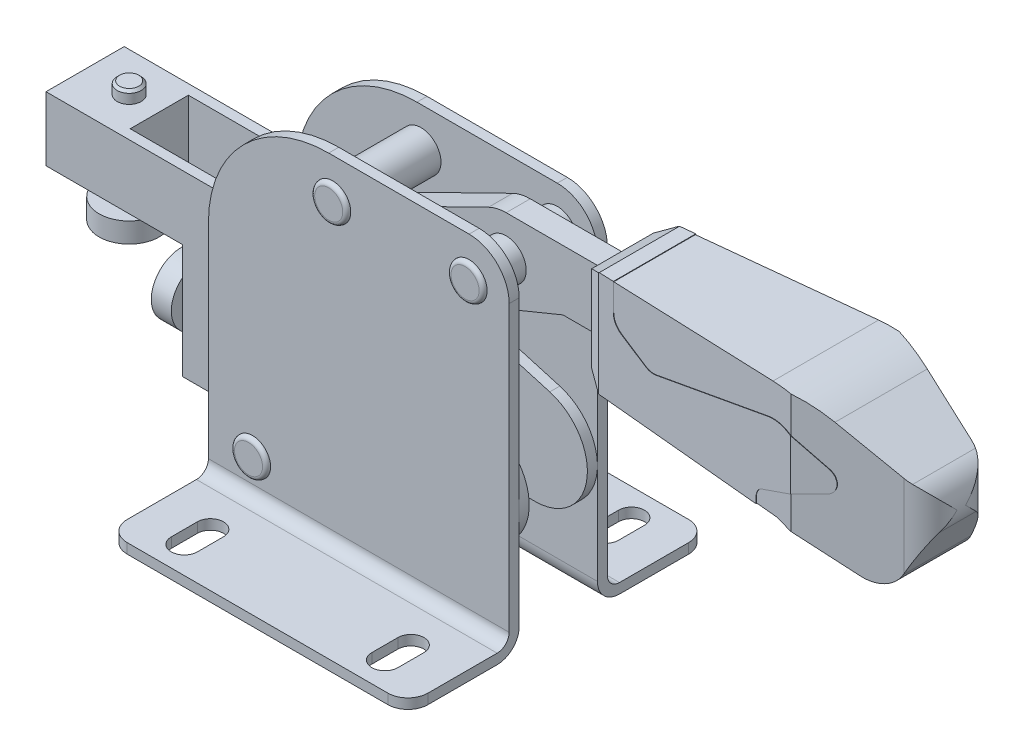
ISO-10303-21;
HEADER;
FILE_DESCRIPTION(('STEP AP214'),'2;1');
FILE_NAME('part.step','',(''),(''),'','','');
FILE_SCHEMA(('AUTOMOTIVE_DESIGN { 1 0 10303 214 1 1 1 1 }'));
ENDSEC;
DATA;
#1=APPLICATION_CONTEXT('core data for automotive mechanical design processes');
#2=APPLICATION_PROTOCOL_DEFINITION('international standard','automotive_design',2000,#1);
#3=PRODUCT_CONTEXT('',#1,'mechanical');
#4=PRODUCT('Part','Part','',(#3));
#5=PRODUCT_RELATED_PRODUCT_CATEGORY('part','',(#4));
#6=PRODUCT_DEFINITION_FORMATION('','',#4);
#7=PRODUCT_DEFINITION_CONTEXT('part definition',#1,'design');
#8=PRODUCT_DEFINITION('design','',#6,#7);
#9=PRODUCT_DEFINITION_SHAPE('','',#8);
#10=(LENGTH_UNIT() NAMED_UNIT(*) SI_UNIT(.MILLI.,.METRE.));
#11=(NAMED_UNIT(*) PLANE_ANGLE_UNIT() SI_UNIT($,.RADIAN.));
#12=(NAMED_UNIT(*) SI_UNIT($,.STERADIAN.) SOLID_ANGLE_UNIT());
#13=UNCERTAINTY_MEASURE_WITH_UNIT(LENGTH_MEASURE(1.E-05),#10,'distance_accuracy_value','');
#14=(GEOMETRIC_REPRESENTATION_CONTEXT(3) GLOBAL_UNCERTAINTY_ASSIGNED_CONTEXT((#13)) GLOBAL_UNIT_ASSIGNED_CONTEXT((#10,
#11,#12)) REPRESENTATION_CONTEXT('',''));
#15=CARTESIAN_POINT('',(0.,0.,0.));
#16=DIRECTION('',(0.,0.,1.));
#17=DIRECTION('',(1.,0.,0.));
#18=AXIS2_PLACEMENT_3D('',#15,#16,#17);
#19=CARTESIAN_POINT('',(-24.5,35.,0.));
#20=DIRECTION('',(0.,1.,0.));
#21=DIRECTION('',(0.,0.,1.));
#22=AXIS2_PLACEMENT_3D('',#19,#20,#21);
#23=PLANE('',#22);
#24=CARTESIAN_POINT('',(-32.,35.,0.));
#25=DIRECTION('',(0.,1.,0.));
#26=DIRECTION('',(0.,0.,1.));
#27=AXIS2_PLACEMENT_3D('',#24,#25,#26);
#28=CIRCLE('',#27,7.5);
#29=CARTESIAN_POINT('',(-32.,35.,7.5));
#30=VERTEX_POINT('',#29);
#31=EDGE_CURVE('P0_E17',#30,#30,#28,.T.);
#32=ORIENTED_EDGE('',*,*,#31,.F.);
#33=EDGE_LOOP('',(#32));
#34=FACE_BOUND('',#33,.T.);
#35=ADVANCED_FACE('P0_F14',(#34),#23,.F.);
#36=CARTESIAN_POINT('',(-32.,35.,0.));
#37=DIRECTION('',(0.,1.,0.));
#38=DIRECTION('',(0.,0.,1.));
#39=AXIS2_PLACEMENT_3D('',#36,#37,#38);
#40=CYLINDRICAL_SURFACE('',#39,7.5);
#41=CARTESIAN_POINT('',(-32.,40.,0.));
#42=DIRECTION('',(0.,1.,0.));
#43=DIRECTION('',(0.,0.,1.));
#44=AXIS2_PLACEMENT_3D('',#41,#42,#43);
#45=CIRCLE('',#44,7.5);
#46=CARTESIAN_POINT('',(-32.,40.,7.5));
#47=VERTEX_POINT('',#46);
#48=EDGE_CURVE('P0_E37',#47,#47,#45,.F.);
#49=ORIENTED_EDGE('',*,*,#48,.T.);
#50=EDGE_LOOP('',(#49));
#51=FACE_BOUND('',#50,.T.);
#52=ORIENTED_EDGE('',*,*,#31,.T.);
#53=EDGE_LOOP('',(#52));
#54=FACE_BOUND('',#53,.T.);
#55=ADVANCED_FACE('P0_F45',(#51,#54),#40,.T.);
#56=CARTESIAN_POINT('',(-32.,65.,0.));
#57=DIRECTION('',(0.,-1.,0.));
#58=DIRECTION('',(0.,0.,-1.));
#59=AXIS2_PLACEMENT_3D('',#56,#57,#58);
#60=PLANE('',#59);
#61=CARTESIAN_POINT('',(-32.,64.9999999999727,0.));
#62=DIRECTION('',(0.,-1.,0.));
#63=DIRECTION('',(0.,0.,-1.));
#64=AXIS2_PLACEMENT_3D('',#61,#62,#63);
#65=CIRCLE('',#64,2.38650000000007);
#66=CARTESIAN_POINT('',(-32.,64.9999999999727,-2.38650000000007));
#67=VERTEX_POINT('',#66);
#68=EDGE_CURVE('P0_E30',#67,#67,#65,.T.);
#69=ORIENTED_EDGE('',*,*,#68,.F.);
#70=EDGE_LOOP('',(#69));
#71=FACE_BOUND('',#70,.T.);
#72=ADVANCED_FACE('P0_F51',(#71),#60,.F.);
#73=CARTESIAN_POINT('',(-29.,40.,0.));
#74=DIRECTION('',(0.,-1.,0.));
#75=DIRECTION('',(0.,0.,-1.));
#76=AXIS2_PLACEMENT_3D('',#73,#74,#75);
#77=PLANE('',#76);
#78=CARTESIAN_POINT('',(-32.,40.,0.));
#79=DIRECTION('',(0.,1.,0.));
#80=DIRECTION('',(0.,0.,1.));
#81=AXIS2_PLACEMENT_3D('',#78,#79,#80);
#82=CIRCLE('',#81,3.);
#83=CARTESIAN_POINT('',(-32.,40.,3.));
#84=VERTEX_POINT('',#83);
#85=EDGE_CURVE('P0_E22',#84,#84,#82,.T.);
#86=ORIENTED_EDGE('',*,*,#85,.F.);
#87=EDGE_LOOP('',(#86));
#88=FACE_BOUND('',#87,.T.);
#89=ORIENTED_EDGE('',*,*,#48,.F.);
#90=EDGE_LOOP('',(#89));
#91=FACE_BOUND('',#90,.T.);
#92=ADVANCED_FACE('P0_F58',(#88,#91),#77,.F.);
#93=CARTESIAN_POINT('',(-32.,64.3865000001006,0.));
#94=DIRECTION('',(0.,-1.,0.));
#95=DIRECTION('',(0.,0.,-1.));
#96=AXIS2_PLACEMENT_3D('',#93,#94,#95);
#97=CONICAL_SURFACE('',#96,2.99999999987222,0.785398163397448);
#98=ORIENTED_EDGE('',*,*,#68,.T.);
#99=EDGE_LOOP('',(#98));
#100=FACE_BOUND('',#99,.T.);
#101=CARTESIAN_POINT('',(-32.,64.3865,0.));
#102=DIRECTION('',(0.,1.,0.));
#103=DIRECTION('',(0.,0.,1.));
#104=AXIS2_PLACEMENT_3D('',#101,#102,#103);
#105=CIRCLE('',#104,3.);
#106=CARTESIAN_POINT('',(-32.,64.3865,3.));
#107=VERTEX_POINT('',#106);
#108=EDGE_CURVE('P0_E10',#107,#107,#105,.F.);
#109=ORIENTED_EDGE('',*,*,#108,.F.);
#110=EDGE_LOOP('',(#109));
#111=FACE_BOUND('',#110,.T.);
#112=ADVANCED_FACE('P0_F54',(#100,#111),#97,.T.);
#113=CARTESIAN_POINT('',(-32.,35.,0.));
#114=DIRECTION('',(0.,1.,0.));
#115=DIRECTION('',(0.,0.,1.));
#116=AXIS2_PLACEMENT_3D('',#113,#114,#115);
#117=CYLINDRICAL_SURFACE('',#116,3.);
#118=ORIENTED_EDGE('',*,*,#108,.T.);
#119=EDGE_LOOP('',(#118));
#120=FACE_BOUND('',#119,.T.);
#121=ORIENTED_EDGE('',*,*,#85,.T.);
#122=EDGE_LOOP('',(#121));
#123=FACE_BOUND('',#122,.T.);
#124=ADVANCED_FACE('P0_F52',(#120,#123),#117,.T.);
#125=CLOSED_SHELL('',(#35,#55,#72,#92,#112,#124));
#126=MANIFOLD_SOLID_BREP('P0_B1',#125);
#127=CARTESIAN_POINT('',(37.6499999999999,64.2,3.));
#128=DIRECTION('',(0.,0.,1.));
#129=DIRECTION('',(1.,0.,0.));
#130=AXIS2_PLACEMENT_3D('',#127,#128,#129);
#131=PLANE('',#130);
#132=DIRECTION('',(1.,0.,0.));
#133=VECTOR('',#132,1.);
#134=CARTESIAN_POINT('',(91.,86.5,3.));
#135=LINE('',#134,#133);
#136=CARTESIAN_POINT('',(91.,86.5,3.));
#137=VERTEX_POINT('',#136);
#138=CARTESIAN_POINT('',(65.,86.5,3.));
#139=VERTEX_POINT('',#138);
#140=EDGE_CURVE('P1_E87',#137,#139,#135,.F.);
#141=ORIENTED_EDGE('',*,*,#140,.T.);
#142=CARTESIAN_POINT('',(65.,76.5,3.));
#143=DIRECTION('',(0.,0.,1.));
#144=DIRECTION('',(1.,0.,0.));
#145=AXIS2_PLACEMENT_3D('',#142,#143,#144);
#146=CIRCLE('',#145,10.);
#147=CARTESIAN_POINT('',(60.596592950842,85.4783075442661,3.));
#148=VERTEX_POINT('',#147);
#149=EDGE_CURVE('P1_E144',#148,#139,#146,.F.);
#150=ORIENTED_EDGE('',*,*,#149,.F.);
#151=DIRECTION('',(0.897830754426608,0.440340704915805,0.));
#152=VECTOR('',#151,1.);
#153=CARTESIAN_POINT('',(60.596592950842,85.4783075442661,3.));
#154=LINE('',#153,#152);
#155=CARTESIAN_POINT('',(33.6869336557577,72.2804767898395,3.));
#156=VERTEX_POINT('',#155);
#157=EDGE_CURVE('P1_E138',#148,#156,#154,.F.);
#158=ORIENTED_EDGE('',*,*,#157,.T.);
#159=CARTESIAN_POINT('',(37.6499999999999,64.2,3.));
#160=DIRECTION('',(0.,0.,1.));
#161=DIRECTION('',(1.,0.,0.));
#162=AXIS2_PLACEMENT_3D('',#159,#160,#161);
#163=CIRCLE('',#162,9.00000000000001);
#164=CARTESIAN_POINT('',(41.0656481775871,55.8733351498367,3.));
#165=VERTEX_POINT('',#164);
#166=EDGE_CURVE('P1_E61',#165,#156,#163,.F.);
#167=ORIENTED_EDGE('',*,*,#166,.F.);
#168=DIRECTION('',(-0.925184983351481,-0.379516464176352,0.));
#169=VECTOR('',#168,1.);
#170=CARTESIAN_POINT('',(41.0656481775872,55.8733351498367,3.));
#171=LINE('',#170,#169);
#172=CARTESIAN_POINT('',(79.1603213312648,71.5,3.));
#173=VERTEX_POINT('',#172);
#174=EDGE_CURVE('P1_E65',#165,#173,#171,.F.);
#175=ORIENTED_EDGE('',*,*,#174,.T.);
#176=DIRECTION('',(1.,0.,0.));
#177=VECTOR('',#176,1.);
#178=CARTESIAN_POINT('',(79.1603213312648,71.5,3.));
#179=LINE('',#178,#177);
#180=CARTESIAN_POINT('',(91.,71.5,3.));
#181=VERTEX_POINT('',#180);
#182=EDGE_CURVE('P1_E123',#173,#181,#179,.T.);
#183=ORIENTED_EDGE('',*,*,#182,.T.);
#184=DIRECTION('',(0.,1.,0.));
#185=VECTOR('',#184,1.);
#186=CARTESIAN_POINT('',(91.,71.5,3.));
#187=LINE('',#186,#185);
#188=EDGE_CURVE('P1_E92',#181,#137,#187,.T.);
#189=ORIENTED_EDGE('',*,*,#188,.T.);
#190=EDGE_LOOP('',(#141,#150,#158,#167,#175,#183,#189));
#191=FACE_BOUND('',#190,.T.);
#192=CARTESIAN_POINT('',(65.,76.5,3.));
#193=DIRECTION('',(0.,0.,1.));
#194=DIRECTION('',(1.,0.,0.));
#195=AXIS2_PLACEMENT_3D('',#192,#193,#194);
#196=CIRCLE('',#195,5.);
#197=CARTESIAN_POINT('',(70.,76.5,3.));
#198=VERTEX_POINT('',#197);
#199=EDGE_CURVE('P1_E19',#198,#198,#196,.F.);
#200=ORIENTED_EDGE('',*,*,#199,.T.);
#201=EDGE_LOOP('',(#200));
#202=FACE_BOUND('',#201,.T.);
#203=ADVANCED_FACE('P1_F16',(#191,#202),#131,.T.);
#204=CARTESIAN_POINT('',(65.,76.5,3.));
#205=DIRECTION('',(0.,0.,1.));
#206=DIRECTION('',(1.,0.,0.));
#207=AXIS2_PLACEMENT_3D('',#204,#205,#206);
#208=CYLINDRICAL_SURFACE('',#207,5.);
#209=CARTESIAN_POINT('',(65.,76.5,-3.));
#210=DIRECTION('',(0.,0.,1.));
#211=DIRECTION('',(1.,0.,0.));
#212=AXIS2_PLACEMENT_3D('',#209,#210,#211);
#213=CIRCLE('',#212,5.);
#214=CARTESIAN_POINT('',(70.,76.5,-3.));
#215=VERTEX_POINT('',#214);
#216=EDGE_CURVE('P1_E165',#215,#215,#213,.F.);
#217=ORIENTED_EDGE('',*,*,#216,.T.);
#218=EDGE_LOOP('',(#217));
#219=FACE_BOUND('',#218,.T.);
#220=ORIENTED_EDGE('',*,*,#199,.F.);
#221=EDGE_LOOP('',(#220));
#222=FACE_BOUND('',#221,.T.);
#223=ADVANCED_FACE('P1_F180',(#219,#222),#208,.F.);
#224=CARTESIAN_POINT('',(37.6499999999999,64.2,3.));
#225=DIRECTION('',(0.,0.,1.));
#226=DIRECTION('',(1.,0.,0.));
#227=AXIS2_PLACEMENT_3D('',#224,#225,#226);
#228=CYLINDRICAL_SURFACE('',#227,9.00000000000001);
#229=ORIENTED_EDGE('',*,*,#166,.T.);
#230=DIRECTION('',(0.,0.,1.));
#231=VECTOR('',#230,1.);
#232=CARTESIAN_POINT('',(33.6869336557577,72.2804767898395,3.));
#233=LINE('',#232,#231);
#234=CARTESIAN_POINT('',(33.6869336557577,72.2804767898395,-3.));
#235=VERTEX_POINT('',#234);
#236=EDGE_CURVE('P1_E141',#156,#235,#233,.F.);
#237=ORIENTED_EDGE('',*,*,#236,.T.);
#238=CARTESIAN_POINT('',(37.6499999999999,64.2,-3.));
#239=DIRECTION('',(0.,0.,1.));
#240=DIRECTION('',(1.,0.,0.));
#241=AXIS2_PLACEMENT_3D('',#238,#239,#240);
#242=CIRCLE('',#241,9.00000000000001);
#243=CARTESIAN_POINT('',(41.0656481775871,55.8733351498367,-3.));
#244=VERTEX_POINT('',#243);
#245=EDGE_CURVE('P1_E161',#235,#244,#242,.T.);
#246=ORIENTED_EDGE('',*,*,#245,.T.);
#247=DIRECTION('',(0.,0.,1.));
#248=VECTOR('',#247,1.);
#249=CARTESIAN_POINT('',(41.0656481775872,55.8733351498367,3.));
#250=LINE('',#249,#248);
#251=EDGE_CURVE('P1_E134',#244,#165,#250,.T.);
#252=ORIENTED_EDGE('',*,*,#251,.T.);
#253=EDGE_LOOP('',(#229,#237,#246,#252));
#254=FACE_BOUND('',#253,.T.);
#255=ADVANCED_FACE('P1_F182',(#254),#228,.T.);
#256=CARTESIAN_POINT('',(41.0656481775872,55.8733351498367,3.));
#257=DIRECTION('',(-0.379516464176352,0.925184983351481,0.));
#258=DIRECTION('',(-0.925184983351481,-0.379516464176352,0.));
#259=AXIS2_PLACEMENT_3D('',#256,#257,#258);
#260=PLANE('',#259);
#261=DIRECTION('',(0.,0.,1.));
#262=VECTOR('',#261,1.);
#263=CARTESIAN_POINT('',(79.1603213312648,71.5,3.));
#264=LINE('',#263,#262);
#265=CARTESIAN_POINT('',(79.1603213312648,71.5,-3.));
#266=VERTEX_POINT('',#265);
#267=EDGE_CURVE('P1_E128',#266,#173,#264,.T.);
#268=ORIENTED_EDGE('',*,*,#267,.T.);
#269=ORIENTED_EDGE('',*,*,#174,.F.);
#270=ORIENTED_EDGE('',*,*,#251,.F.);
#271=DIRECTION('',(0.925184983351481,0.379516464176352,0.));
#272=VECTOR('',#271,1.);
#273=CARTESIAN_POINT('',(41.0656481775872,55.8733351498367,-3.));
#274=LINE('',#273,#272);
#275=EDGE_CURVE('P1_E114',#244,#266,#274,.T.);
#276=ORIENTED_EDGE('',*,*,#275,.T.);
#277=EDGE_LOOP('',(#268,#269,#270,#276));
#278=FACE_BOUND('',#277,.T.);
#279=ADVANCED_FACE('P1_F188',(#278),#260,.F.);
#280=CARTESIAN_POINT('',(79.1603213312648,71.5,3.));
#281=DIRECTION('',(0.,1.,0.));
#282=DIRECTION('',(0.,0.,1.));
#283=AXIS2_PLACEMENT_3D('',#280,#281,#282);
#284=PLANE('',#283);
#285=DIRECTION('',(0.,0.,1.));
#286=VECTOR('',#285,1.);
#287=CARTESIAN_POINT('',(91.,71.5,3.));
#288=LINE('',#287,#286);
#289=CARTESIAN_POINT('',(91.,71.5,-3.));
#290=VERTEX_POINT('',#289);
#291=EDGE_CURVE('P1_E107',#290,#181,#288,.T.);
#292=ORIENTED_EDGE('',*,*,#291,.T.);
#293=ORIENTED_EDGE('',*,*,#182,.F.);
#294=ORIENTED_EDGE('',*,*,#267,.F.);
#295=DIRECTION('',(1.,0.,0.));
#296=VECTOR('',#295,1.);
#297=CARTESIAN_POINT('',(37.6499999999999,71.5,-3.));
#298=LINE('',#297,#296);
#299=EDGE_CURVE('P1_E109',#266,#290,#298,.T.);
#300=ORIENTED_EDGE('',*,*,#299,.T.);
#301=EDGE_LOOP('',(#292,#293,#294,#300));
#302=FACE_BOUND('',#301,.T.);
#303=ADVANCED_FACE('P1_F205',(#302),#284,.F.);
#304=CARTESIAN_POINT('',(91.,71.5,3.));
#305=DIRECTION('',(-1.,0.,0.));
#306=DIRECTION('',(0.,0.,1.));
#307=AXIS2_PLACEMENT_3D('',#304,#305,#306);
#308=PLANE('',#307);
#309=DIRECTION('',(0.,0.,-1.));
#310=VECTOR('',#309,1.);
#311=CARTESIAN_POINT('',(91.,86.5,3.));
#312=LINE('',#311,#310);
#313=CARTESIAN_POINT('',(91.,86.5,-3.));
#314=VERTEX_POINT('',#313);
#315=EDGE_CURVE('P1_E81',#314,#137,#312,.F.);
#316=ORIENTED_EDGE('',*,*,#315,.T.);
#317=ORIENTED_EDGE('',*,*,#188,.F.);
#318=ORIENTED_EDGE('',*,*,#291,.F.);
#319=DIRECTION('',(0.,1.,0.));
#320=VECTOR('',#319,1.);
#321=CARTESIAN_POINT('',(91.,64.2,-3.));
#322=LINE('',#321,#320);
#323=EDGE_CURVE('P1_E100',#290,#314,#322,.T.);
#324=ORIENTED_EDGE('',*,*,#323,.T.);
#325=EDGE_LOOP('',(#316,#317,#318,#324));
#326=FACE_BOUND('',#325,.T.);
#327=ADVANCED_FACE('P1_F105',(#326),#308,.F.);
#328=CARTESIAN_POINT('',(91.,86.5,3.));
#329=DIRECTION('',(0.,-1.,0.));
#330=DIRECTION('',(0.,0.,-1.));
#331=AXIS2_PLACEMENT_3D('',#328,#329,#330);
#332=PLANE('',#331);
#333=DIRECTION('',(0.,0.,1.));
#334=VECTOR('',#333,1.);
#335=CARTESIAN_POINT('',(65.,86.5,3.));
#336=LINE('',#335,#334);
#337=CARTESIAN_POINT('',(65.,86.5,-3.));
#338=VERTEX_POINT('',#337);
#339=EDGE_CURVE('P1_E170',#139,#338,#336,.F.);
#340=ORIENTED_EDGE('',*,*,#339,.F.);
#341=ORIENTED_EDGE('',*,*,#140,.F.);
#342=ORIENTED_EDGE('',*,*,#315,.F.);
#343=DIRECTION('',(1.,0.,0.));
#344=VECTOR('',#343,1.);
#345=CARTESIAN_POINT('',(37.6499999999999,86.5,-3.));
#346=LINE('',#345,#344);
#347=EDGE_CURVE('P1_E85',#314,#338,#346,.F.);
#348=ORIENTED_EDGE('',*,*,#347,.T.);
#349=EDGE_LOOP('',(#340,#341,#342,#348));
#350=FACE_BOUND('',#349,.T.);
#351=ADVANCED_FACE('P1_F84',(#350),#332,.F.);
#352=CARTESIAN_POINT('',(65.,76.5,3.));
#353=DIRECTION('',(0.,0.,1.));
#354=DIRECTION('',(1.,0.,0.));
#355=AXIS2_PLACEMENT_3D('',#352,#353,#354);
#356=CYLINDRICAL_SURFACE('',#355,10.);
#357=ORIENTED_EDGE('',*,*,#149,.T.);
#358=ORIENTED_EDGE('',*,*,#339,.T.);
#359=CARTESIAN_POINT('',(65.,76.5,-3.));
#360=DIRECTION('',(0.,0.,1.));
#361=DIRECTION('',(1.,0.,0.));
#362=AXIS2_PLACEMENT_3D('',#359,#360,#361);
#363=CIRCLE('',#362,10.);
#364=CARTESIAN_POINT('',(60.596592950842,85.4783075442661,-3.));
#365=VERTEX_POINT('',#364);
#366=EDGE_CURVE('P1_E26',#338,#365,#363,.T.);
#367=ORIENTED_EDGE('',*,*,#366,.T.);
#368=DIRECTION('',(0.,0.,1.));
#369=VECTOR('',#368,1.);
#370=CARTESIAN_POINT('',(60.596592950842,85.4783075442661,3.));
#371=LINE('',#370,#369);
#372=EDGE_CURVE('P1_E34',#365,#148,#371,.T.);
#373=ORIENTED_EDGE('',*,*,#372,.T.);
#374=EDGE_LOOP('',(#357,#358,#367,#373));
#375=FACE_BOUND('',#374,.T.);
#376=ADVANCED_FACE('P1_F195',(#375),#356,.T.);
#377=CARTESIAN_POINT('',(60.596592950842,85.4783075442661,3.));
#378=DIRECTION('',(0.440340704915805,-0.897830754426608,0.));
#379=DIRECTION('',(0.897830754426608,0.440340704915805,0.));
#380=AXIS2_PLACEMENT_3D('',#377,#378,#379);
#381=PLANE('',#380);
#382=ORIENTED_EDGE('',*,*,#236,.F.);
#383=ORIENTED_EDGE('',*,*,#157,.F.);
#384=ORIENTED_EDGE('',*,*,#372,.F.);
#385=DIRECTION('',(-0.897830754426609,-0.440340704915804,0.));
#386=VECTOR('',#385,1.);
#387=CARTESIAN_POINT('',(60.596592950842,85.4783075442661,-3.));
#388=LINE('',#387,#386);
#389=EDGE_CURVE('P1_E11',#365,#235,#388,.T.);
#390=ORIENTED_EDGE('',*,*,#389,.T.);
#391=EDGE_LOOP('',(#382,#383,#384,#390));
#392=FACE_BOUND('',#391,.T.);
#393=ADVANCED_FACE('P1_F191',(#392),#381,.F.);
#394=CARTESIAN_POINT('',(37.6499999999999,64.2,-3.));
#395=DIRECTION('',(0.,0.,1.));
#396=DIRECTION('',(1.,0.,0.));
#397=AXIS2_PLACEMENT_3D('',#394,#395,#396);
#398=PLANE('',#397);
#399=ORIENTED_EDGE('',*,*,#366,.F.);
#400=ORIENTED_EDGE('',*,*,#347,.F.);
#401=ORIENTED_EDGE('',*,*,#323,.F.);
#402=ORIENTED_EDGE('',*,*,#299,.F.);
#403=ORIENTED_EDGE('',*,*,#275,.F.);
#404=ORIENTED_EDGE('',*,*,#245,.F.);
#405=ORIENTED_EDGE('',*,*,#389,.F.);
#406=EDGE_LOOP('',(#399,#400,#401,#402,#403,#404,#405));
#407=FACE_BOUND('',#406,.T.);
#408=ORIENTED_EDGE('',*,*,#216,.F.);
#409=EDGE_LOOP('',(#408));
#410=FACE_BOUND('',#409,.T.);
#411=ADVANCED_FACE('P1_F97',(#407,#410),#398,.F.);
#412=CLOSED_SHELL('',(#203,#223,#255,#279,#303,#327,#351,#376,#393,#411));
#413=MANIFOLD_SOLID_BREP('P1_B1',#412);
#414=CARTESIAN_POINT('',(91.,89.7405989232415,15.5));
#415=DIRECTION('',(1.,0.,0.));
#416=DIRECTION('',(0.,0.,1.));
#417=AXIS2_PLACEMENT_3D('',#414,#415,#416);
#418=PLANE('',#417);
#419=DIRECTION('',(0.,-1.,0.));
#420=VECTOR('',#419,1.);
#421=CARTESIAN_POINT('',(91.,52.9,-7.68936810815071));
#422=LINE('',#421,#420);
#423=CARTESIAN_POINT('',(91.,89.7405989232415,-7.68936810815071));
#424=VERTEX_POINT('',#423);
#425=CARTESIAN_POINT('',(91.,68.2594010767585,-7.68936810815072));
#426=VERTEX_POINT('',#425);
#427=EDGE_CURVE('P2_E616',#424,#426,#422,.T.);
#428=ORIENTED_EDGE('',*,*,#427,.T.);
#429=DIRECTION('',(0.,0.,1.));
#430=VECTOR('',#429,1.);
#431=CARTESIAN_POINT('',(91.,68.2594010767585,15.5));
#432=LINE('',#431,#430);
#433=CARTESIAN_POINT('',(91.,68.2594010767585,7.68936810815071));
#434=VERTEX_POINT('',#433);
#435=EDGE_CURVE('P2_E240',#426,#434,#432,.T.);
#436=ORIENTED_EDGE('',*,*,#435,.T.);
#437=DIRECTION('',(0.,-1.,0.));
#438=VECTOR('',#437,1.);
#439=CARTESIAN_POINT('',(91.,52.9,7.68936810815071));
#440=LINE('',#439,#438);
#441=CARTESIAN_POINT('',(91.,89.7405989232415,7.68936810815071));
#442=VERTEX_POINT('',#441);
#443=EDGE_CURVE('P2_E542',#434,#442,#440,.F.);
#444=ORIENTED_EDGE('',*,*,#443,.T.);
#445=DIRECTION('',(0.,0.,1.));
#446=VECTOR('',#445,1.);
#447=CARTESIAN_POINT('',(91.,89.7405989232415,15.5));
#448=LINE('',#447,#446);
#449=EDGE_CURVE('P2_E529',#442,#424,#448,.F.);
#450=ORIENTED_EDGE('',*,*,#449,.T.);
#451=EDGE_LOOP('',(#428,#436,#444,#450));
#452=FACE_BOUND('',#451,.T.);
#453=ADVANCED_FACE('P2_F16',(#452),#418,.F.);
#454=CARTESIAN_POINT('',(137.255189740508,64.7387652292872,15.5));
#455=DIRECTION('',(-0.999657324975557,0.0261769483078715,0.));
#456=DIRECTION('',(-0.0261769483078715,-0.999657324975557,0.));
#457=AXIS2_PLACEMENT_3D('',#454,#455,#456);
#458=PLANE('',#457);
#459=DIRECTION('',(-0.0261769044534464,-0.999655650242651,0.00183046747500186));
#460=VECTOR('',#459,1.);
#461=CARTESIAN_POINT('',(137.3,66.4499999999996,-12.9566733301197));
#462=LINE('',#461,#460);
#463=CARTESIAN_POINT('',(137.3,66.4499999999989,-12.9566733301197));
#464=VERTEX_POINT('',#463);
#465=CARTESIAN_POINT('',(137.255189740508,64.7387652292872,-12.953539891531));
#466=VERTEX_POINT('',#465);
#467=EDGE_CURVE('P2_E641',#464,#466,#462,.T.);
#468=ORIENTED_EDGE('',*,*,#467,.F.);
#469=DIRECTION('',(0.,0.,1.));
#470=VECTOR('',#469,1.);
#471=CARTESIAN_POINT('',(137.3,66.45,15.5));
#472=LINE('',#471,#470);
#473=CARTESIAN_POINT('',(137.3,66.4499999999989,-12.8566733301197));
#474=VERTEX_POINT('',#473);
#475=EDGE_CURVE('P2_E657',#474,#464,#472,.F.);
#476=ORIENTED_EDGE('',*,*,#475,.F.);
#477=DIRECTION('',(0.026176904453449,0.999655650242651,-0.00183046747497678));
#478=VECTOR('',#477,1.);
#479=CARTESIAN_POINT('',(137.259114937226,64.8886624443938,-12.8538143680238));
#480=LINE('',#479,#478);
#481=CARTESIAN_POINT('',(137.259114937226,64.8886624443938,-12.8538143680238));
#482=VERTEX_POINT('',#481);
#483=EDGE_CURVE('P2_E647',#482,#474,#480,.T.);
#484=ORIENTED_EDGE('',*,*,#483,.F.);
#485=DIRECTION('',(0.,0.,1.));
#486=VECTOR('',#485,1.);
#487=CARTESIAN_POINT('',(137.259114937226,64.8886624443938,13.5));
#488=LINE('',#487,#486);
#489=CARTESIAN_POINT('',(137.259114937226,64.8886624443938,12.8538143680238));
#490=VERTEX_POINT('',#489);
#491=EDGE_CURVE('P2_E558',#482,#490,#488,.T.);
#492=ORIENTED_EDGE('',*,*,#491,.T.);
#493=DIRECTION('',(-0.026176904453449,-0.999655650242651,-0.00183046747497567));
#494=VECTOR('',#493,1.);
#495=CARTESIAN_POINT('',(137.3,66.45,12.8566733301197));
#496=LINE('',#495,#494);
#497=CARTESIAN_POINT('',(137.3,66.4499999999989,12.8566733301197));
#498=VERTEX_POINT('',#497);
#499=EDGE_CURVE('P2_E644',#498,#490,#496,.T.);
#500=ORIENTED_EDGE('',*,*,#499,.F.);
#501=DIRECTION('',(0.,0.,1.));
#502=VECTOR('',#501,1.);
#503=CARTESIAN_POINT('',(137.3,66.45,15.5));
#504=LINE('',#503,#502);
#505=CARTESIAN_POINT('',(137.3,66.4499999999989,12.9566733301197));
#506=VERTEX_POINT('',#505);
#507=EDGE_CURVE('P2_E553',#498,#506,#504,.T.);
#508=ORIENTED_EDGE('',*,*,#507,.T.);
#509=DIRECTION('',(0.0261769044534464,0.999655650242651,0.00183046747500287));
#510=VECTOR('',#509,1.);
#511=CARTESIAN_POINT('',(137.255189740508,64.7387652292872,12.953539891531));
#512=LINE('',#511,#510);
#513=CARTESIAN_POINT('',(137.255189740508,64.7387652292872,12.953539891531));
#514=VERTEX_POINT('',#513);
#515=EDGE_CURVE('P2_E648',#514,#506,#512,.T.);
#516=ORIENTED_EDGE('',*,*,#515,.F.);
#517=DIRECTION('',(0.,0.,1.));
#518=VECTOR('',#517,1.);
#519=CARTESIAN_POINT('',(137.255189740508,64.7387652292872,15.5));
#520=LINE('',#519,#518);
#521=EDGE_CURVE('P2_E663',#514,#466,#520,.F.);
#522=ORIENTED_EDGE('',*,*,#521,.T.);
#523=EDGE_LOOP('',(#468,#476,#484,#492,#500,#508,#516,#522));
#524=FACE_BOUND('',#523,.T.);
#525=ADVANCED_FACE('P2_F922',(#524),#458,.F.);
#526=CARTESIAN_POINT('',(91.,68.2594010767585,15.5));
#527=DIRECTION('',(0.5,0.866025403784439,0.));
#528=DIRECTION('',(-0.866025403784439,0.5,0.));
#529=AXIS2_PLACEMENT_3D('',#526,#527,#528);
#530=PLANE('',#529);
#531=DIRECTION('',(-0.864441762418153,0.499085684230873,0.0604476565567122));
#532=VECTOR('',#531,1.);
#533=CARTESIAN_POINT('',(95.1900407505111,65.8402799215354,-10.0120581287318));
#534=LINE('',#533,#532);
#535=CARTESIAN_POINT('',(95.1900407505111,65.8402799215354,-10.0120581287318));
#536=VERTEX_POINT('',#535);
#537=CARTESIAN_POINT('',(95.,65.95,-9.99876918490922));
#538=VERTEX_POINT('',#537);
#539=EDGE_CURVE('P2_E603',#536,#538,#534,.T.);
#540=ORIENTED_EDGE('',*,*,#539,.F.);
#541=DIRECTION('',(0.,0.,1.));
#542=VECTOR('',#541,1.);
#543=CARTESIAN_POINT('',(95.1900407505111,65.8402799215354,15.5));
#544=LINE('',#543,#542);
#545=CARTESIAN_POINT('',(95.1900407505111,65.8402799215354,10.0120581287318));
#546=VERTEX_POINT('',#545);
#547=EDGE_CURVE('P2_E496',#536,#546,#544,.T.);
#548=ORIENTED_EDGE('',*,*,#547,.T.);
#549=DIRECTION('',(0.864441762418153,-0.499085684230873,0.0604476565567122));
#550=VECTOR('',#549,1.);
#551=CARTESIAN_POINT('',(95.,65.95,9.99876918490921));
#552=LINE('',#551,#550);
#553=CARTESIAN_POINT('',(95.,65.95,9.99876918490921));
#554=VERTEX_POINT('',#553);
#555=EDGE_CURVE('P2_E612',#554,#546,#552,.T.);
#556=ORIENTED_EDGE('',*,*,#555,.F.);
#557=DIRECTION('',(-0.774596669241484,0.447213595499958,-0.447213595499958));
#558=VECTOR('',#557,1.);
#559=CARTESIAN_POINT('',(95.,65.95,9.99876918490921));
#560=LINE('',#559,#558);
#561=EDGE_CURVE('P2_E550',#554,#434,#560,.T.);
#562=ORIENTED_EDGE('',*,*,#561,.T.);
#563=ORIENTED_EDGE('',*,*,#435,.F.);
#564=DIRECTION('',(0.774596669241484,-0.447213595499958,-0.447213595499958));
#565=VECTOR('',#564,1.);
#566=CARTESIAN_POINT('',(91.,68.2594010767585,-7.68936810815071));
#567=LINE('',#566,#565);
#568=EDGE_CURVE('P2_E671',#426,#538,#567,.T.);
#569=ORIENTED_EDGE('',*,*,#568,.T.);
#570=EDGE_LOOP('',(#540,#548,#556,#562,#563,#569));
#571=FACE_BOUND('',#570,.T.);
#572=ADVANCED_FACE('P2_F745',(#571),#530,.F.);
#573=CARTESIAN_POINT('',(169.425117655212,63.2346314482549,13.5));
#574=DIRECTION('',(-0.88334902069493,0.46871580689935,0.));
#575=DIRECTION('',(-0.46871580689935,-0.88334902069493,0.));
#576=AXIS2_PLACEMENT_3D('',#573,#574,#575);
#577=PLANE('',#576);
#578=DIRECTION('',(0.466205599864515,0.878618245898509,-0.103355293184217));
#579=VECTOR('',#578,1.);
#580=CARTESIAN_POINT('',(169.425117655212,63.2346314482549,8.41762377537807));
#581=LINE('',#580,#579);
#582=CARTESIAN_POINT('',(169.425117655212,63.2346314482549,8.41762377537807));
#583=VERTEX_POINT('',#582);
#584=CARTESIAN_POINT('',(169.623297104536,63.6081234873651,8.37368844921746));
#585=VERTEX_POINT('',#584);
#586=EDGE_CURVE('P2_E597',#583,#585,#581,.T.);
#587=ORIENTED_EDGE('',*,*,#586,.F.);
#588=DIRECTION('',(0.,0.,1.));
#589=VECTOR('',#588,1.);
#590=CARTESIAN_POINT('',(169.425117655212,63.2346314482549,13.5));
#591=LINE('',#590,#589);
#592=CARTESIAN_POINT('',(169.425117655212,63.2346314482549,-8.41762377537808));
#593=VERTEX_POINT('',#592);
#594=EDGE_CURVE('P2_E433',#593,#583,#591,.T.);
#595=ORIENTED_EDGE('',*,*,#594,.F.);
#596=DIRECTION('',(-0.466205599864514,-0.878618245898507,-0.103355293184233));
#597=VECTOR('',#596,1.);
#598=CARTESIAN_POINT('',(169.623297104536,63.6081234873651,-8.37368844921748));
#599=LINE('',#598,#597);
#600=CARTESIAN_POINT('',(169.623297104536,63.6081234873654,-8.37368844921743));
#601=VERTEX_POINT('',#600);
#602=EDGE_CURVE('P2_E600',#601,#593,#599,.T.);
#603=ORIENTED_EDGE('',*,*,#602,.F.);
#604=CARTESIAN_POINT('',(168.,60.5488327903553,-1.05146839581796));
#605=DIRECTION('',(-0.88334902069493,0.46871580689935,0.));
#606=DIRECTION('',(-0.46871580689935,-0.883349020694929,0.));
#607=AXIS2_PLACEMENT_3D('',#604,#605,#606);
#608=ELLIPSE('',#607,16.0011672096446,7.50000000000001);
#609=CARTESIAN_POINT('',(174.625117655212,73.0346314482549,-4.56683694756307));
#610=VERTEX_POINT('',#609);
#611=EDGE_CURVE('P2_E440',#610,#601,#608,.T.);
#612=ORIENTED_EDGE('',*,*,#611,.F.);
#613=DIRECTION('',(0.,0.,1.));
#614=VECTOR('',#613,1.);
#615=CARTESIAN_POINT('',(174.625117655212,73.0346314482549,13.5));
#616=LINE('',#615,#614);
#617=CARTESIAN_POINT('',(174.625117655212,73.0346314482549,4.56683694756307));
#618=VERTEX_POINT('',#617);
#619=EDGE_CURVE('P2_E491',#618,#610,#616,.F.);
#620=ORIENTED_EDGE('',*,*,#619,.F.);
#621=CARTESIAN_POINT('',(168.,60.5488327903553,1.05146839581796));
#622=DIRECTION('',(-0.88334902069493,0.46871580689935,0.));
#623=DIRECTION('',(-0.46871580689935,-0.883349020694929,0.));
#624=AXIS2_PLACEMENT_3D('',#621,#622,#623);
#625=ELLIPSE('',#624,16.0011672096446,7.50000000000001);
#626=EDGE_CURVE('P2_E437',#585,#618,#625,.T.);
#627=ORIENTED_EDGE('',*,*,#626,.F.);
#628=EDGE_LOOP('',(#587,#595,#603,#612,#620,#627));
#629=FACE_BOUND('',#628,.T.);
#630=ADVANCED_FACE('P2_F1112',(#629),#577,.F.);
#631=CARTESIAN_POINT('',(137.259114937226,64.8886624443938,13.5));
#632=DIRECTION('',(0.0261769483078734,0.999657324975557,0.));
#633=DIRECTION('',(-0.999657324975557,0.0261769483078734,0.));
#634=AXIS2_PLACEMENT_3D('',#631,#632,#633);
#635=PLANE('',#634);
#636=DIRECTION('',(0.997223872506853,-0.0261132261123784,-0.0697326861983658));
#637=VECTOR('',#636,1.);
#638=CARTESIAN_POINT('',(137.259114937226,64.8886624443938,-12.8538143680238));
#639=LINE('',#638,#637);
#640=CARTESIAN_POINT('',(142.682283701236,64.746651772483,-13.2330392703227));
#641=VERTEX_POINT('',#640);
#642=EDGE_CURVE('P2_E450',#482,#641,#639,.T.);
#643=ORIENTED_EDGE('',*,*,#642,.T.);
#644=DIRECTION('',(0.,0.,1.));
#645=VECTOR('',#644,1.);
#646=CARTESIAN_POINT('',(142.682283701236,64.746651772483,13.5));
#647=LINE('',#646,#645);
#648=CARTESIAN_POINT('',(142.682283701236,64.746651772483,13.2330392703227));
#649=VERTEX_POINT('',#648);
#650=EDGE_CURVE('P2_E582',#641,#649,#647,.T.);
#651=ORIENTED_EDGE('',*,*,#650,.T.);
#652=DIRECTION('',(-0.997223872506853,0.0261132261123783,-0.069732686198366));
#653=VECTOR('',#652,1.);
#654=CARTESIAN_POINT('',(142.682283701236,64.746651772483,13.2330392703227));
#655=LINE('',#654,#653);
#656=EDGE_CURVE('P2_E429',#649,#490,#655,.T.);
#657=ORIENTED_EDGE('',*,*,#656,.T.);
#658=ORIENTED_EDGE('',*,*,#491,.F.);
#659=EDGE_LOOP('',(#643,#651,#657,#658));
#660=FACE_BOUND('',#659,.T.);
#661=ADVANCED_FACE('P2_F1109',(#660),#635,.F.);
#662=CARTESIAN_POINT('',(169.623297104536,52.9,8.47368844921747));
#663=DIRECTION('',(-0.216439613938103,0.,-0.976296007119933));
#664=DIRECTION('',(0.976296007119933,0.,-0.216439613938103));
#665=AXIS2_PLACEMENT_3D('',#662,#663,#664);
#666=PLANE('',#665);
#667=DIRECTION('',(0.911448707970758,0.35837364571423,-0.202063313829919));
#668=VECTOR('',#667,1.);
#669=CARTESIAN_POINT('',(146.5,71.7706884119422,13.6));
#670=LINE('',#669,#668);
#671=CARTESIAN_POINT('',(146.5,71.7706884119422,13.6));
#672=VERTEX_POINT('',#671);
#673=CARTESIAN_POINT('',(154.097765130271,74.758063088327,11.9156160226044));
#674=VERTEX_POINT('',#673);
#675=EDGE_CURVE('P2_E424',#672,#674,#670,.T.);
#676=ORIENTED_EDGE('',*,*,#675,.T.);
#677=CARTESIAN_POINT('',(153.,77.55,12.1589846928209));
#678=DIRECTION('',(-0.216439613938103,0.,-0.976296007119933));
#679=DIRECTION('',(-0.976296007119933,0.,0.216439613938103));
#680=AXIS2_PLACEMENT_3D('',#677,#678,#679);
#681=ELLIPSE('',#680,3.07283854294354,3.00000000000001);
#682=CARTESIAN_POINT('',(154.401869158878,80.2023127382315,11.8481977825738));
#683=VERTEX_POINT('',#682);
#684=EDGE_CURVE('P2_E420',#683,#674,#681,.T.);
#685=ORIENTED_EDGE('',*,*,#684,.F.);
#686=DIRECTION('',(-0.867596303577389,0.458564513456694,0.192341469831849));
#687=VECTOR('',#686,1.);
#688=CARTESIAN_POINT('',(154.401869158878,80.2023127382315,11.8481977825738));
#689=LINE('',#688,#687);
#690=CARTESIAN_POINT('',(146.5,84.3788136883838,13.6));
#691=VERTEX_POINT('',#690);
#692=EDGE_CURVE('P2_E574',#683,#691,#689,.T.);
#693=ORIENTED_EDGE('',*,*,#692,.T.);
#694=DIRECTION('',(0.,-1.,0.));
#695=VECTOR('',#694,1.);
#696=CARTESIAN_POINT('',(146.5,52.9,13.6));
#697=LINE('',#696,#695);
#698=EDGE_CURVE('P2_E567',#691,#672,#697,.T.);
#699=ORIENTED_EDGE('',*,*,#698,.T.);
#700=EDGE_LOOP('',(#676,#685,#693,#699));
#701=FACE_BOUND('',#700,.T.);
#702=ADVANCED_FACE('P2_F935',(#701),#666,.F.);
#703=CARTESIAN_POINT('',(139.8,66.45,15.5));
#704=DIRECTION('',(0.,0.,1.));
#705=DIRECTION('',(0.,-1.,0.));
#706=AXIS2_PLACEMENT_3D('',#703,#704,#705);
#707=CYLINDRICAL_SURFACE('',#706,2.5);
#708=ORIENTED_EDGE('',*,*,#507,.F.);
#709=CARTESIAN_POINT('',(139.8,66.45,13.0314903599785));
#710=DIRECTION('',(0.0697564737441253,0.,-0.997564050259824));
#711=DIRECTION('',(0.997564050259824,0.,0.0697564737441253));
#712=AXIS2_PLACEMENT_3D('',#709,#710,#711);
#713=ELLIPSE('',#712,2.50610474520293,2.5);
#714=CARTESIAN_POINT('',(138.885195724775,68.7766140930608,12.9675210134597));
#715=VERTEX_POINT('',#714);
#716=EDGE_CURVE('P2_E425',#498,#715,#713,.T.);
#717=ORIENTED_EDGE('',*,*,#716,.T.);
#718=DIRECTION('',(0.,0.,1.));
#719=VECTOR('',#718,1.);
#720=CARTESIAN_POINT('',(138.885195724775,68.7766140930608,15.5));
#721=LINE('',#720,#719);
#722=CARTESIAN_POINT('',(138.885195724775,68.7766140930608,13.0675210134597));
#723=VERTEX_POINT('',#722);
#724=EDGE_CURVE('P2_E559',#715,#723,#721,.T.);
#725=ORIENTED_EDGE('',*,*,#724,.T.);
#726=CARTESIAN_POINT('',(139.8,66.45,13.1314903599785));
#727=DIRECTION('',(0.0697564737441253,0.,-0.997564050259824));
#728=DIRECTION('',(0.997564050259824,0.,0.0697564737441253));
#729=AXIS2_PLACEMENT_3D('',#726,#727,#728);
#730=ELLIPSE('',#729,2.50610474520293,2.5);
#731=EDGE_CURVE('P2_E414',#723,#506,#730,.F.);
#732=ORIENTED_EDGE('',*,*,#731,.T.);
#733=EDGE_LOOP('',(#708,#717,#725,#732));
#734=FACE_BOUND('',#733,.T.);
#735=ADVANCED_FACE('P2_F1104',(#734),#707,.F.);
#736=CARTESIAN_POINT('',(95.,52.9,9.99876918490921));
#737=DIRECTION('',(0.5,0.,-0.866025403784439));
#738=DIRECTION('',(0.866025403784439,0.,0.5));
#739=AXIS2_PLACEMENT_3D('',#736,#737,#738);
#740=PLANE('',#739);
#741=ORIENTED_EDGE('',*,*,#561,.F.);
#742=DIRECTION('',(0.,-1.,0.));
#743=VECTOR('',#742,1.);
#744=CARTESIAN_POINT('',(95.,52.9,9.99876918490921));
#745=LINE('',#744,#743);
#746=CARTESIAN_POINT('',(95.,92.05,9.99876918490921));
#747=VERTEX_POINT('',#746);
#748=EDGE_CURVE('P2_E535',#554,#747,#745,.F.);
#749=ORIENTED_EDGE('',*,*,#748,.T.);
#750=DIRECTION('',(-0.774596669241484,-0.447213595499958,-0.447213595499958));
#751=VECTOR('',#750,1.);
#752=CARTESIAN_POINT('',(95.,92.05,9.99876918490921));
#753=LINE('',#752,#751);
#754=EDGE_CURVE('P2_E538',#747,#442,#753,.T.);
#755=ORIENTED_EDGE('',*,*,#754,.T.);
#756=ORIENTED_EDGE('',*,*,#443,.F.);
#757=EDGE_LOOP('',(#741,#749,#755,#756));
#758=FACE_BOUND('',#757,.T.);
#759=ADVANCED_FACE('P2_F750',(#758),#740,.F.);
#760=CARTESIAN_POINT('',(95.2211353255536,92.1776725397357,15.5));
#761=DIRECTION('',(0.5,-0.866025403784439,0.));
#762=DIRECTION('',(0.866025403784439,0.5,0.));
#763=AXIS2_PLACEMENT_3D('',#760,#761,#762);
#764=PLANE('',#763);
#765=DIRECTION('',(0.864441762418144,0.499085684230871,-0.0604476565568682));
#766=VECTOR('',#765,1.);
#767=CARTESIAN_POINT('',(95.,92.05,-9.99876918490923));
#768=LINE('',#767,#766);
#769=CARTESIAN_POINT('',(95.,92.05,-9.99876918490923));
#770=VERTEX_POINT('',#769);
#771=CARTESIAN_POINT('',(95.2211353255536,92.1776725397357,-10.0142324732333));
#772=VERTEX_POINT('',#771);
#773=EDGE_CURVE('P2_E524',#770,#772,#768,.T.);
#774=ORIENTED_EDGE('',*,*,#773,.F.);
#775=DIRECTION('',(-0.774596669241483,-0.447213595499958,0.447213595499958));
#776=VECTOR('',#775,1.);
#777=CARTESIAN_POINT('',(95.,92.05,-9.99876918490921));
#778=LINE('',#777,#776);
#779=EDGE_CURVE('P2_E528',#770,#424,#778,.T.);
#780=ORIENTED_EDGE('',*,*,#779,.T.);
#781=ORIENTED_EDGE('',*,*,#449,.F.);
#782=ORIENTED_EDGE('',*,*,#754,.F.);
#783=DIRECTION('',(0.864441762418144,0.499085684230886,0.0604476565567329));
#784=VECTOR('',#783,1.);
#785=CARTESIAN_POINT('',(95.,92.05,9.99876918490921));
#786=LINE('',#785,#784);
#787=CARTESIAN_POINT('',(95.2211353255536,92.1776725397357,10.0142324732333));
#788=VERTEX_POINT('',#787);
#789=EDGE_CURVE('P2_E413',#747,#788,#786,.T.);
#790=ORIENTED_EDGE('',*,*,#789,.T.);
#791=DIRECTION('',(0.,0.,1.));
#792=VECTOR('',#791,1.);
#793=CARTESIAN_POINT('',(95.2211353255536,92.1776725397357,15.5));
#794=LINE('',#793,#792);
#795=EDGE_CURVE('P2_E513',#788,#772,#794,.F.);
#796=ORIENTED_EDGE('',*,*,#795,.T.);
#797=EDGE_LOOP('',(#774,#780,#781,#782,#790,#796));
#798=FACE_BOUND('',#797,.T.);
#799=ADVANCED_FACE('P2_F758',(#798),#764,.F.);
#800=CARTESIAN_POINT('',(91.,52.9,-7.68936810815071));
#801=DIRECTION('',(0.5,0.,0.866025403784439));
#802=DIRECTION('',(-0.866025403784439,0.,0.5));
#803=AXIS2_PLACEMENT_3D('',#800,#801,#802);
#804=PLANE('',#803);
#805=ORIENTED_EDGE('',*,*,#568,.F.);
#806=ORIENTED_EDGE('',*,*,#427,.F.);
#807=ORIENTED_EDGE('',*,*,#779,.F.);
#808=DIRECTION('',(0.,-1.,0.));
#809=VECTOR('',#808,1.);
#810=CARTESIAN_POINT('',(95.,52.9,-9.99876918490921));
#811=LINE('',#810,#809);
#812=EDGE_CURVE('P2_E619',#770,#538,#811,.T.);
#813=ORIENTED_EDGE('',*,*,#812,.T.);
#814=EDGE_LOOP('',(#805,#806,#807,#813));
#815=FACE_BOUND('',#814,.T.);
#816=ADVANCED_FACE('P2_F1096',(#815),#804,.F.);
#817=CARTESIAN_POINT('',(95.1900407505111,65.8402799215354,15.5));
#818=DIRECTION('',(0.0261769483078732,0.999657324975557,0.));
#819=DIRECTION('',(-0.999657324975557,0.0261769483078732,0.));
#820=AXIS2_PLACEMENT_3D('',#817,#818,#819);
#821=PLANE('',#820);
#822=DIRECTION('',(0.997223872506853,-0.026113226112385,-0.0697326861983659));
#823=VECTOR('',#822,1.);
#824=CARTESIAN_POINT('',(95.1900407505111,65.8402799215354,-10.0120581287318));
#825=LINE('',#824,#823);
#826=EDGE_CURVE('P2_E397',#536,#466,#825,.T.);
#827=ORIENTED_EDGE('',*,*,#826,.T.);
#828=ORIENTED_EDGE('',*,*,#521,.F.);
#829=DIRECTION('',(-0.997223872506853,0.026113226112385,-0.0697326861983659));
#830=VECTOR('',#829,1.);
#831=CARTESIAN_POINT('',(137.255189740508,64.7387652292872,12.953539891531));
#832=LINE('',#831,#830);
#833=EDGE_CURVE('P2_E418',#514,#546,#832,.T.);
#834=ORIENTED_EDGE('',*,*,#833,.T.);
#835=ORIENTED_EDGE('',*,*,#547,.F.);
#836=EDGE_LOOP('',(#827,#828,#834,#835));
#837=FACE_BOUND('',#836,.T.);
#838=ADVANCED_FACE('P2_F697',(#837),#821,.F.);
#839=CARTESIAN_POINT('',(139.8,66.45,15.5));
#840=DIRECTION('',(0.,0.,1.));
#841=DIRECTION('',(0.,-1.,0.));
#842=AXIS2_PLACEMENT_3D('',#839,#840,#841);
#843=CYLINDRICAL_SURFACE('',#842,2.5);
#844=DIRECTION('',(0.,0.,1.));
#845=VECTOR('',#844,1.);
#846=CARTESIAN_POINT('',(138.885195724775,68.7766140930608,15.5));
#847=LINE('',#846,#845);
#848=CARTESIAN_POINT('',(138.885195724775,68.7766140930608,-13.0675210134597));
#849=VERTEX_POINT('',#848);
#850=CARTESIAN_POINT('',(138.885195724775,68.7766140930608,-12.9675210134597));
#851=VERTEX_POINT('',#850);
#852=EDGE_CURVE('P2_E483',#849,#851,#847,.T.);
#853=ORIENTED_EDGE('',*,*,#852,.T.);
#854=CARTESIAN_POINT('',(139.8,66.45,-13.0314903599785));
#855=DIRECTION('',(0.0697564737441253,0.,0.997564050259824));
#856=DIRECTION('',(-0.997564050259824,0.,0.0697564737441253));
#857=AXIS2_PLACEMENT_3D('',#854,#855,#856);
#858=ELLIPSE('',#857,2.50610474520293,2.5);
#859=EDGE_CURVE('P2_E451',#851,#474,#858,.T.);
#860=ORIENTED_EDGE('',*,*,#859,.T.);
#861=ORIENTED_EDGE('',*,*,#475,.T.);
#862=CARTESIAN_POINT('',(139.8,66.45,-13.1314903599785));
#863=DIRECTION('',(0.0697564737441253,0.,0.997564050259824));
#864=DIRECTION('',(-0.997564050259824,0.,0.0697564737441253));
#865=AXIS2_PLACEMENT_3D('',#862,#863,#864);
#866=ELLIPSE('',#865,2.50610474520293,2.5);
#867=EDGE_CURVE('P2_E392',#464,#849,#866,.F.);
#868=ORIENTED_EDGE('',*,*,#867,.T.);
#869=EDGE_LOOP('',(#853,#860,#861,#868));
#870=FACE_BOUND('',#869,.T.);
#871=ADVANCED_FACE('P2_F920',(#870),#843,.F.);
#872=CARTESIAN_POINT('',(146.5,52.9,-13.6));
#873=DIRECTION('',(-0.216439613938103,0.,0.976296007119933));
#874=DIRECTION('',(-0.976296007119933,0.,-0.216439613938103));
#875=AXIS2_PLACEMENT_3D('',#872,#873,#874);
#876=PLANE('',#875);
#877=DIRECTION('',(-0.911448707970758,-0.35837364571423,-0.202063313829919));
#878=VECTOR('',#877,1.);
#879=CARTESIAN_POINT('',(154.097765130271,74.758063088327,-11.9156160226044));
#880=LINE('',#879,#878);
#881=CARTESIAN_POINT('',(154.097765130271,74.758063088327,-11.9156160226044));
#882=VERTEX_POINT('',#881);
#883=CARTESIAN_POINT('',(146.5,71.7706884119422,-13.6));
#884=VERTEX_POINT('',#883);
#885=EDGE_CURVE('P2_E466',#882,#884,#880,.T.);
#886=ORIENTED_EDGE('',*,*,#885,.T.);
#887=DIRECTION('',(0.,-1.,0.));
#888=VECTOR('',#887,1.);
#889=CARTESIAN_POINT('',(146.5,52.9,-13.6));
#890=LINE('',#889,#888);
#891=CARTESIAN_POINT('',(146.5,84.3788136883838,-13.6));
#892=VERTEX_POINT('',#891);
#893=EDGE_CURVE('P2_E391',#884,#892,#890,.F.);
#894=ORIENTED_EDGE('',*,*,#893,.T.);
#895=DIRECTION('',(0.867596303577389,-0.458564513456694,0.192341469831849));
#896=VECTOR('',#895,1.);
#897=CARTESIAN_POINT('',(146.5,84.3788136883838,-13.6));
#898=LINE('',#897,#896);
#899=CARTESIAN_POINT('',(154.401869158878,80.2023127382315,-11.8481977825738));
#900=VERTEX_POINT('',#899);
#901=EDGE_CURVE('P2_E490',#892,#900,#898,.T.);
#902=ORIENTED_EDGE('',*,*,#901,.T.);
#903=CARTESIAN_POINT('',(153.,77.55,-12.1589846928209));
#904=DIRECTION('',(-0.216439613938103,0.,0.976296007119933));
#905=DIRECTION('',(0.976296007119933,0.,0.216439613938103));
#906=AXIS2_PLACEMENT_3D('',#903,#904,#905);
#907=ELLIPSE('',#906,3.07283854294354,3.00000000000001);
#908=EDGE_CURVE('P2_E19',#882,#900,#907,.T.);
#909=ORIENTED_EDGE('',*,*,#908,.F.);
#910=EDGE_LOOP('',(#886,#894,#902,#909));
#911=FACE_BOUND('',#910,.T.);
#912=ADVANCED_FACE('P2_F1082',(#911),#876,.F.);
#913=CARTESIAN_POINT('',(168.,76.55,13.5));
#914=DIRECTION('',(0.,0.,1.));
#915=DIRECTION('',(0.,-1.,0.));
#916=AXIS2_PLACEMENT_3D('',#913,#914,#915);
#917=CYLINDRICAL_SURFACE('',#916,7.5);
#918=CARTESIAN_POINT('',(168.,76.55,-1.05146839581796));
#919=DIRECTION('',(0.,-0.707106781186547,-0.707106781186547));
#920=DIRECTION('',(0.,-0.707106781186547,0.707106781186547));
#921=AXIS2_PLACEMENT_3D('',#918,#919,#920);
#922=ELLIPSE('',#921,10.6066017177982,7.50000000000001);
#923=CARTESIAN_POINT('',(171.197357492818,83.3343131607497,-7.83578155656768));
#924=VERTEX_POINT('',#923);
#925=CARTESIAN_POINT('',(175.5,76.55,-1.05146839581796));
#926=VERTEX_POINT('',#925);
#927=EDGE_CURVE('P2_E448',#924,#926,#922,.T.);
#928=ORIENTED_EDGE('',*,*,#927,.F.);
#929=DIRECTION('',(0.,0.,1.));
#930=VECTOR('',#929,1.);
#931=CARTESIAN_POINT('',(171.197357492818,83.3343131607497,13.5));
#932=LINE('',#931,#930);
#933=CARTESIAN_POINT('',(171.197357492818,83.3343131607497,7.83578155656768));
#934=VERTEX_POINT('',#933);
#935=EDGE_CURVE('P2_E372',#924,#934,#932,.T.);
#936=ORIENTED_EDGE('',*,*,#935,.T.);
#937=CARTESIAN_POINT('',(168.,76.55,1.05146839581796));
#938=DIRECTION('',(0.,-0.707106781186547,0.707106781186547));
#939=DIRECTION('',(0.,-0.707106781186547,-0.707106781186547));
#940=AXIS2_PLACEMENT_3D('',#937,#938,#939);
#941=ELLIPSE('',#940,10.6066017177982,7.50000000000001);
#942=CARTESIAN_POINT('',(175.5,76.55,1.05146839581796));
#943=VERTEX_POINT('',#942);
#944=EDGE_CURVE('P2_E430',#943,#934,#941,.T.);
#945=ORIENTED_EDGE('',*,*,#944,.F.);
#946=CARTESIAN_POINT('',(168.,76.55,1.05146839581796));
#947=DIRECTION('',(0.,-0.707106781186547,-0.707106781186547));
#948=DIRECTION('',(0.,-0.707106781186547,0.707106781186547));
#949=AXIS2_PLACEMENT_3D('',#946,#947,#948);
#950=ELLIPSE('',#949,10.6066017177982,7.50000000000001);
#951=EDGE_CURVE('P2_E434',#618,#943,#950,.F.);
#952=ORIENTED_EDGE('',*,*,#951,.F.);
#953=ORIENTED_EDGE('',*,*,#619,.T.);
#954=CARTESIAN_POINT('',(168.,76.55,-1.05146839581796));
#955=DIRECTION('',(0.,-0.707106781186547,0.707106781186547));
#956=DIRECTION('',(0.,-0.707106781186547,-0.707106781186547));
#957=AXIS2_PLACEMENT_3D('',#954,#955,#956);
#958=ELLIPSE('',#957,10.6066017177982,7.50000000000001);
#959=EDGE_CURVE('P2_E444',#926,#610,#958,.F.);
#960=ORIENTED_EDGE('',*,*,#959,.F.);
#961=EDGE_LOOP('',(#928,#936,#945,#952,#953,#960));
#962=FACE_BOUND('',#961,.T.);
#963=ADVANCED_FACE('P2_F1084',(#962),#917,.T.);
#964=CARTESIAN_POINT('',(154.401869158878,80.2023127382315,15.5));
#965=DIRECTION('',(-0.467289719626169,-0.884104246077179,0.));
#966=DIRECTION('',(0.884104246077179,-0.467289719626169,0.));
#967=AXIS2_PLACEMENT_3D('',#964,#965,#966);
#968=PLANE('',#967);
#969=ORIENTED_EDGE('',*,*,#901,.F.);
#970=DIRECTION('',(-0.882419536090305,0.466399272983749,0.0617047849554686));
#971=VECTOR('',#970,1.);
#972=CARTESIAN_POINT('',(146.5,84.3788136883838,-13.6));
#973=LINE('',#972,#971);
#974=CARTESIAN_POINT('',(146.038317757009,84.6228339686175,-13.5677160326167));
#975=VERTEX_POINT('',#974);
#976=EDGE_CURVE('P2_E517',#892,#975,#973,.T.);
#977=ORIENTED_EDGE('',*,*,#976,.T.);
#978=DIRECTION('',(0.,0.,1.));
#979=VECTOR('',#978,1.);
#980=CARTESIAN_POINT('',(146.038317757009,84.6228339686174,15.5));
#981=LINE('',#980,#979);
#982=CARTESIAN_POINT('',(146.038317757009,84.6228339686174,-13.4677160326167));
#983=VERTEX_POINT('',#982);
#984=EDGE_CURVE('P2_E381',#983,#975,#981,.F.);
#985=ORIENTED_EDGE('',*,*,#984,.F.);
#986=DIRECTION('',(-0.88241953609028,0.466399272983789,0.0617047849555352));
#987=VECTOR('',#986,1.);
#988=CARTESIAN_POINT('',(146.5,84.3788136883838,-13.5));
#989=LINE('',#988,#987);
#990=CARTESIAN_POINT('',(146.5,84.3788136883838,-13.5));
#991=VERTEX_POINT('',#990);
#992=EDGE_CURVE('P2_E487',#991,#983,#989,.T.);
#993=ORIENTED_EDGE('',*,*,#992,.F.);
#994=DIRECTION('',(0.867596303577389,-0.458564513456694,0.192341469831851));
#995=VECTOR('',#994,1.);
#996=CARTESIAN_POINT('',(146.5,84.3788136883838,-13.5));
#997=LINE('',#996,#995);
#998=CARTESIAN_POINT('',(154.401869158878,80.2023127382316,-11.7481977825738));
#999=VERTEX_POINT('',#998);
#1000=EDGE_CURVE('P2_E367',#991,#999,#997,.T.);
#1001=ORIENTED_EDGE('',*,*,#1000,.T.);
#1002=DIRECTION('',(0.,0.,1.));
#1003=VECTOR('',#1002,1.);
#1004=CARTESIAN_POINT('',(154.401869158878,80.2023127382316,15.5));
#1005=LINE('',#1004,#1003);
#1006=EDGE_CURVE('P2_E484',#900,#999,#1005,.T.);
#1007=ORIENTED_EDGE('',*,*,#1006,.F.);
#1008=EDGE_LOOP('',(#969,#977,#985,#993,#1001,#1007));
#1009=FACE_BOUND('',#1008,.T.);
#1010=ADVANCED_FACE('P2_F1080',(#1009),#968,.F.);
#1011=CARTESIAN_POINT('',(153.,77.55,15.5));
#1012=DIRECTION('',(0.,0.,1.));
#1013=DIRECTION('',(0.,-1.,0.));
#1014=AXIS2_PLACEMENT_3D('',#1011,#1012,#1013);
#1015=CYLINDRICAL_SURFACE('',#1014,3.00000000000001);
#1016=ORIENTED_EDGE('',*,*,#1006,.T.);
#1017=CARTESIAN_POINT('',(153.,77.55,-12.0589846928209));
#1018=DIRECTION('',(-0.216439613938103,0.,0.976296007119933));
#1019=DIRECTION('',(0.976296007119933,0.,0.216439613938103));
#1020=AXIS2_PLACEMENT_3D('',#1017,#1018,#1019);
#1021=ELLIPSE('',#1020,3.07283854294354,3.00000000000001);
#1022=CARTESIAN_POINT('',(154.097765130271,74.758063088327,-11.8156160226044));
#1023=VERTEX_POINT('',#1022);
#1024=EDGE_CURVE('P2_E362',#999,#1023,#1021,.F.);
#1025=ORIENTED_EDGE('',*,*,#1024,.T.);
#1026=DIRECTION('',(0.,0.,1.));
#1027=VECTOR('',#1026,1.);
#1028=CARTESIAN_POINT('',(154.097765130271,74.758063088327,15.5));
#1029=LINE('',#1028,#1027);
#1030=EDGE_CURVE('P2_E473',#1023,#882,#1029,.F.);
#1031=ORIENTED_EDGE('',*,*,#1030,.T.);
#1032=ORIENTED_EDGE('',*,*,#908,.T.);
#1033=EDGE_LOOP('',(#1016,#1025,#1031,#1032));
#1034=FACE_BOUND('',#1033,.T.);
#1035=ADVANCED_FACE('P2_F1223',(#1034),#1015,.T.);
#1036=CARTESIAN_POINT('',(138.885195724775,68.7766140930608,15.5));
#1037=DIRECTION('',(-0.365921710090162,0.930645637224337,0.));
#1038=DIRECTION('',(-0.930645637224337,-0.365921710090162,0.));
#1039=AXIS2_PLACEMENT_3D('',#1036,#1037,#1038);
#1040=PLANE('',#1039);
#1041=ORIENTED_EDGE('',*,*,#885,.F.);
#1042=ORIENTED_EDGE('',*,*,#1030,.F.);
#1043=DIRECTION('',(-0.911448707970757,-0.35837364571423,-0.202063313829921));
#1044=VECTOR('',#1043,1.);
#1045=CARTESIAN_POINT('',(154.097765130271,74.758063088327,-11.8156160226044));
#1046=LINE('',#1045,#1044);
#1047=CARTESIAN_POINT('',(146.5,71.7706884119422,-13.5));
#1048=VERTEX_POINT('',#1047);
#1049=EDGE_CURVE('P2_E366',#1023,#1048,#1046,.T.);
#1050=ORIENTED_EDGE('',*,*,#1049,.T.);
#1051=DIRECTION('',(-0.928681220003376,-0.365149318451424,0.064939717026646));
#1052=VECTOR('',#1051,1.);
#1053=CARTESIAN_POINT('',(146.5,71.7706884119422,-13.5));
#1054=LINE('',#1053,#1052);
#1055=EDGE_CURVE('P2_E454',#1048,#851,#1054,.T.);
#1056=ORIENTED_EDGE('',*,*,#1055,.T.);
#1057=ORIENTED_EDGE('',*,*,#852,.F.);
#1058=DIRECTION('',(0.928681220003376,0.365149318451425,-0.064939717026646));
#1059=VECTOR('',#1058,1.);
#1060=CARTESIAN_POINT('',(138.885195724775,68.7766140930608,-13.0675210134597));
#1061=LINE('',#1060,#1059);
#1062=EDGE_CURVE('P2_E396',#849,#884,#1061,.T.);
#1063=ORIENTED_EDGE('',*,*,#1062,.T.);
#1064=EDGE_LOOP('',(#1041,#1042,#1050,#1056,#1057,#1063));
#1065=FACE_BOUND('',#1064,.T.);
#1066=ADVANCED_FACE('P2_F917',(#1065),#1040,.F.);
#1067=CARTESIAN_POINT('',(95.,29.,-9.89876918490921));
#1068=DIRECTION('',(0.0697564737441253,0.,0.997564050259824));
#1069=DIRECTION('',(-0.997564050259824,0.,0.0697564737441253));
#1070=AXIS2_PLACEMENT_3D('',#1067,#1068,#1069);
#1071=PLANE('',#1070);
#1072=DIRECTION('',(-0.958672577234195,0.276501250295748,0.0670369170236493));
#1073=VECTOR('',#1072,1.);
#1074=CARTESIAN_POINT('',(146.5,63.6455424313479,-13.5));
#1075=LINE('',#1074,#1073);
#1076=CARTESIAN_POINT('',(146.5,63.6455424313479,-13.5));
#1077=VERTEX_POINT('',#1076);
#1078=EDGE_CURVE('P2_E848',#1077,#641,#1075,.T.);
#1079=ORIENTED_EDGE('',*,*,#1078,.T.);
#1080=ORIENTED_EDGE('',*,*,#642,.F.);
#1081=ORIENTED_EDGE('',*,*,#483,.T.);
#1082=ORIENTED_EDGE('',*,*,#859,.F.);
#1083=ORIENTED_EDGE('',*,*,#1055,.F.);
#1084=DIRECTION('',(0.,-1.,0.));
#1085=VECTOR('',#1084,1.);
#1086=CARTESIAN_POINT('',(146.5,29.,-13.5));
#1087=LINE('',#1086,#1085);
#1088=EDGE_CURVE('P2_E866',#1048,#1077,#1087,.T.);
#1089=ORIENTED_EDGE('',*,*,#1088,.T.);
#1090=EDGE_LOOP('',(#1079,#1080,#1081,#1082,#1083,#1089));
#1091=FACE_BOUND('',#1090,.T.);
#1092=ADVANCED_FACE('P2_F1239',(#1091),#1071,.F.);
#1093=CARTESIAN_POINT('',(168.,29.,-1.05146839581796));
#1094=DIRECTION('',(0.,-1.,0.));
#1095=DIRECTION('',(0.,0.,-1.));
#1096=AXIS2_PLACEMENT_3D('',#1093,#1094,#1095);
#1097=CYLINDRICAL_SURFACE('',#1096,7.50000000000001);
#1098=DIRECTION('',(0.,-1.,0.));
#1099=VECTOR('',#1098,1.);
#1100=CARTESIAN_POINT('',(169.623297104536,29.,-8.37368844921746));
#1101=LINE('',#1100,#1099);
#1102=CARTESIAN_POINT('',(169.623297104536,84.0761471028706,-8.37368844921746));
#1103=VERTEX_POINT('',#1102);
#1104=EDGE_CURVE('P2_E360',#601,#1103,#1101,.F.);
#1105=ORIENTED_EDGE('',*,*,#1104,.T.);
#1106=CARTESIAN_POINT('',(168.,84.8411856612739,-1.05146839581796));
#1107=DIRECTION('',(-0.426314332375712,-0.90457508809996,0.));
#1108=DIRECTION('',(0.90457508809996,-0.426314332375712,0.));
#1109=AXIS2_PLACEMENT_3D('',#1106,#1107,#1108);
#1110=ELLIPSE('',#1109,8.29118566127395,7.50000000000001);
#1111=EDGE_CURVE('P2_E373',#1103,#924,#1110,.T.);
#1112=ORIENTED_EDGE('',*,*,#1111,.T.);
#1113=ORIENTED_EDGE('',*,*,#927,.T.);
#1114=ORIENTED_EDGE('',*,*,#959,.T.);
#1115=ORIENTED_EDGE('',*,*,#611,.T.);
#1116=EDGE_LOOP('',(#1105,#1112,#1113,#1114,#1115));
#1117=FACE_BOUND('',#1116,.T.);
#1118=ADVANCED_FACE('P2_F1248',(#1117),#1097,.T.);
#1119=CARTESIAN_POINT('',(168.,29.,1.05146839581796));
#1120=DIRECTION('',(0.,-1.,0.));
#1121=DIRECTION('',(0.,0.,-1.));
#1122=AXIS2_PLACEMENT_3D('',#1119,#1120,#1121);
#1123=CYLINDRICAL_SURFACE('',#1122,7.50000000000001);
#1124=ORIENTED_EDGE('',*,*,#944,.T.);
#1125=CARTESIAN_POINT('',(168.,84.8411856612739,1.05146839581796));
#1126=DIRECTION('',(-0.426314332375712,-0.90457508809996,0.));
#1127=DIRECTION('',(0.90457508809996,-0.426314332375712,0.));
#1128=AXIS2_PLACEMENT_3D('',#1125,#1126,#1127);
#1129=ELLIPSE('',#1128,8.29118566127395,7.50000000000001);
#1130=CARTESIAN_POINT('',(169.623297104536,84.0761471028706,8.37368844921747));
#1131=VERTEX_POINT('',#1130);
#1132=EDGE_CURVE('P2_E368',#934,#1131,#1129,.T.);
#1133=ORIENTED_EDGE('',*,*,#1132,.T.);
#1134=DIRECTION('',(0.,-1.,0.));
#1135=VECTOR('',#1134,1.);
#1136=CARTESIAN_POINT('',(169.623297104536,29.,8.37368844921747));
#1137=LINE('',#1136,#1135);
#1138=EDGE_CURVE('P2_E355',#1131,#585,#1137,.T.);
#1139=ORIENTED_EDGE('',*,*,#1138,.T.);
#1140=ORIENTED_EDGE('',*,*,#626,.T.);
#1141=ORIENTED_EDGE('',*,*,#951,.T.);
#1142=EDGE_LOOP('',(#1124,#1133,#1139,#1140,#1141));
#1143=FACE_BOUND('',#1142,.T.);
#1144=ADVANCED_FACE('P2_F1257',(#1143),#1123,.T.);
#1145=CARTESIAN_POINT('',(162.8,66.75,13.5));
#1146=DIRECTION('',(0.,0.,1.));
#1147=DIRECTION('',(0.,-1.,0.));
#1148=AXIS2_PLACEMENT_3D('',#1145,#1146,#1147);
#1149=CYLINDRICAL_SURFACE('',#1148,7.50000000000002);
#1150=DIRECTION('',(0.,0.,1.));
#1151=VECTOR('',#1150,1.);
#1152=CARTESIAN_POINT('',(160.721565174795,59.5437451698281,13.5));
#1153=LINE('',#1152,#1151);
#1154=CARTESIAN_POINT('',(160.721565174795,59.5437451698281,10.3471549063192));
#1155=VERTEX_POINT('',#1154);
#1156=CARTESIAN_POINT('',(160.721565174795,59.5437451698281,-10.3471549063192));
#1157=VERTEX_POINT('',#1156);
#1158=EDGE_CURVE('P2_E586',#1155,#1157,#1153,.F.);
#1159=ORIENTED_EDGE('',*,*,#1158,.T.);
#1160=CARTESIAN_POINT('',(162.8,66.75,-9.88637699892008));
#1161=DIRECTION('',(-0.216439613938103,0.,0.976296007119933));
#1162=DIRECTION('',(0.976296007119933,0.,0.216439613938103));
#1163=AXIS2_PLACEMENT_3D('',#1160,#1161,#1162);
#1164=ELLIPSE('',#1163,7.68209635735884,7.50000000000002);
#1165=EDGE_CURVE('P2_E356',#1157,#593,#1164,.T.);
#1166=ORIENTED_EDGE('',*,*,#1165,.T.);
#1167=ORIENTED_EDGE('',*,*,#594,.T.);
#1168=CARTESIAN_POINT('',(162.8,66.75,9.88637699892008));
#1169=DIRECTION('',(-0.216439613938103,0.,-0.976296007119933));
#1170=DIRECTION('',(-0.976296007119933,0.,0.216439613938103));
#1171=AXIS2_PLACEMENT_3D('',#1168,#1169,#1170);
#1172=ELLIPSE('',#1171,7.68209635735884,7.50000000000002);
#1173=EDGE_CURVE('P2_E350',#583,#1155,#1172,.T.);
#1174=ORIENTED_EDGE('',*,*,#1173,.T.);
#1175=EDGE_LOOP('',(#1159,#1166,#1167,#1174));
#1176=FACE_BOUND('',#1175,.T.);
#1177=ADVANCED_FACE('P2_F1267',(#1176),#1149,.T.);
#1178=CARTESIAN_POINT('',(142.682283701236,64.746651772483,13.5));
#1179=DIRECTION('',(0.277124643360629,0.960833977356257,0.));
#1180=DIRECTION('',(-0.960833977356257,0.277124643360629,0.));
#1181=AXIS2_PLACEMENT_3D('',#1178,#1179,#1180);
#1182=PLANE('',#1181);
#1183=DIRECTION('',(0.939750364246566,-0.27104368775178,0.208337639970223));
#1184=VECTOR('',#1183,1.);
#1185=CARTESIAN_POINT('',(146.5,63.6455424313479,-13.5));
#1186=LINE('',#1185,#1184);
#1187=EDGE_CURVE('P2_E361',#1077,#1157,#1186,.T.);
#1188=ORIENTED_EDGE('',*,*,#1187,.T.);
#1189=ORIENTED_EDGE('',*,*,#1158,.F.);
#1190=DIRECTION('',(-0.939750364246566,0.271043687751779,0.208337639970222));
#1191=VECTOR('',#1190,1.);
#1192=CARTESIAN_POINT('',(160.721565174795,59.5437451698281,10.3471549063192));
#1193=LINE('',#1192,#1191);
#1194=CARTESIAN_POINT('',(146.5,63.6455424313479,13.5));
#1195=VERTEX_POINT('',#1194);
#1196=EDGE_CURVE('P2_E354',#1155,#1195,#1193,.T.);
#1197=ORIENTED_EDGE('',*,*,#1196,.T.);
#1198=DIRECTION('',(-0.958672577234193,0.27650125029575,-0.0670369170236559));
#1199=VECTOR('',#1198,1.);
#1200=CARTESIAN_POINT('',(146.5,63.6455424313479,13.5));
#1201=LINE('',#1200,#1199);
#1202=EDGE_CURVE('P2_E592',#1195,#649,#1201,.T.);
#1203=ORIENTED_EDGE('',*,*,#1202,.T.);
#1204=ORIENTED_EDGE('',*,*,#650,.F.);
#1205=ORIENTED_EDGE('',*,*,#1078,.F.);
#1206=EDGE_LOOP('',(#1188,#1189,#1197,#1203,#1204,#1205));
#1207=FACE_BOUND('',#1206,.T.);
#1208=ADVANCED_FACE('P2_F1277',(#1207),#1182,.F.);
#1209=CARTESIAN_POINT('',(146.5,29.,13.5));
#1210=DIRECTION('',(0.0697564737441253,0.,-0.997564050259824));
#1211=DIRECTION('',(0.997564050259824,0.,0.0697564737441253));
#1212=AXIS2_PLACEMENT_3D('',#1209,#1210,#1211);
#1213=PLANE('',#1212);
#1214=ORIENTED_EDGE('',*,*,#499,.T.);
#1215=ORIENTED_EDGE('',*,*,#656,.F.);
#1216=ORIENTED_EDGE('',*,*,#1202,.F.);
#1217=DIRECTION('',(0.,-1.,0.));
#1218=VECTOR('',#1217,1.);
#1219=CARTESIAN_POINT('',(146.5,29.,13.5));
#1220=LINE('',#1219,#1218);
#1221=CARTESIAN_POINT('',(146.5,71.7706884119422,13.5));
#1222=VERTEX_POINT('',#1221);
#1223=EDGE_CURVE('P2_E840',#1195,#1222,#1220,.F.);
#1224=ORIENTED_EDGE('',*,*,#1223,.T.);
#1225=DIRECTION('',(-0.928681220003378,-0.36514931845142,-0.0649397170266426));
#1226=VECTOR('',#1225,1.);
#1227=CARTESIAN_POINT('',(146.5,71.7706884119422,13.5));
#1228=LINE('',#1227,#1226);
#1229=EDGE_CURVE('P2_E428',#1222,#715,#1228,.T.);
#1230=ORIENTED_EDGE('',*,*,#1229,.T.);
#1231=ORIENTED_EDGE('',*,*,#716,.F.);
#1232=EDGE_LOOP('',(#1214,#1215,#1216,#1224,#1230,#1231));
#1233=FACE_BOUND('',#1232,.T.);
#1234=ADVANCED_FACE('P2_F1287',(#1233),#1213,.F.);
#1235=CARTESIAN_POINT('',(138.885195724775,68.7766140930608,15.5));
#1236=DIRECTION('',(-0.365921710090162,0.930645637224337,0.));
#1237=DIRECTION('',(-0.930645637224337,-0.365921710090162,0.));
#1238=AXIS2_PLACEMENT_3D('',#1235,#1236,#1237);
#1239=PLANE('',#1238);
#1240=ORIENTED_EDGE('',*,*,#675,.F.);
#1241=DIRECTION('',(-0.928681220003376,-0.365149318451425,-0.064939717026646));
#1242=VECTOR('',#1241,1.);
#1243=CARTESIAN_POINT('',(146.5,71.7706884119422,13.6));
#1244=LINE('',#1243,#1242);
#1245=EDGE_CURVE('P2_E419',#672,#723,#1244,.T.);
#1246=ORIENTED_EDGE('',*,*,#1245,.T.);
#1247=ORIENTED_EDGE('',*,*,#724,.F.);
#1248=ORIENTED_EDGE('',*,*,#1229,.F.);
#1249=DIRECTION('',(0.911448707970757,0.358373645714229,-0.20206331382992));
#1250=VECTOR('',#1249,1.);
#1251=CARTESIAN_POINT('',(146.5,71.7706884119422,13.5));
#1252=LINE('',#1251,#1250);
#1253=CARTESIAN_POINT('',(154.09776513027,74.758063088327,11.8156160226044));
#1254=VERTEX_POINT('',#1253);
#1255=EDGE_CURVE('P2_E349',#1222,#1254,#1252,.T.);
#1256=ORIENTED_EDGE('',*,*,#1255,.T.);
#1257=DIRECTION('',(0.,0.,1.));
#1258=VECTOR('',#1257,1.);
#1259=CARTESIAN_POINT('',(154.097765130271,74.758063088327,15.5));
#1260=LINE('',#1259,#1258);
#1261=EDGE_CURVE('P2_E423',#674,#1254,#1260,.F.);
#1262=ORIENTED_EDGE('',*,*,#1261,.F.);
#1263=EDGE_LOOP('',(#1240,#1246,#1247,#1248,#1256,#1262));
#1264=FACE_BOUND('',#1263,.T.);
#1265=ADVANCED_FACE('P2_F931',(#1264),#1239,.F.);
#1266=CARTESIAN_POINT('',(153.,77.55,15.5));
#1267=DIRECTION('',(0.,0.,1.));
#1268=DIRECTION('',(0.,-1.,0.));
#1269=AXIS2_PLACEMENT_3D('',#1266,#1267,#1268);
#1270=CYLINDRICAL_SURFACE('',#1269,3.00000000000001);
#1271=ORIENTED_EDGE('',*,*,#1261,.T.);
#1272=CARTESIAN_POINT('',(153.,77.55,12.0589846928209));
#1273=DIRECTION('',(-0.216439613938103,0.,-0.976296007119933));
#1274=DIRECTION('',(-0.976296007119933,0.,0.216439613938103));
#1275=AXIS2_PLACEMENT_3D('',#1272,#1273,#1274);
#1276=ELLIPSE('',#1275,3.07283854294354,3.00000000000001);
#1277=CARTESIAN_POINT('',(154.401869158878,80.2023127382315,11.7481977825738));
#1278=VERTEX_POINT('',#1277);
#1279=EDGE_CURVE('P2_E345',#1254,#1278,#1276,.F.);
#1280=ORIENTED_EDGE('',*,*,#1279,.T.);
#1281=DIRECTION('',(0.,0.,1.));
#1282=VECTOR('',#1281,1.);
#1283=CARTESIAN_POINT('',(154.401869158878,80.2023127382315,15.5));
#1284=LINE('',#1283,#1282);
#1285=EDGE_CURVE('P2_E579',#1278,#683,#1284,.T.);
#1286=ORIENTED_EDGE('',*,*,#1285,.T.);
#1287=ORIENTED_EDGE('',*,*,#684,.T.);
#1288=EDGE_LOOP('',(#1271,#1280,#1286,#1287));
#1289=FACE_BOUND('',#1288,.T.);
#1290=ADVANCED_FACE('P2_F1306',(#1289),#1270,.T.);
#1291=CARTESIAN_POINT('',(154.401869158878,80.2023127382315,15.5));
#1292=DIRECTION('',(-0.467289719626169,-0.884104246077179,0.));
#1293=DIRECTION('',(0.884104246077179,-0.467289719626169,0.));
#1294=AXIS2_PLACEMENT_3D('',#1291,#1292,#1293);
#1295=PLANE('',#1294);
#1296=ORIENTED_EDGE('',*,*,#692,.F.);
#1297=ORIENTED_EDGE('',*,*,#1285,.F.);
#1298=DIRECTION('',(-0.867596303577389,0.458564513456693,0.192341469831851));
#1299=VECTOR('',#1298,1.);
#1300=CARTESIAN_POINT('',(154.401869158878,80.2023127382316,11.7481977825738));
#1301=LINE('',#1300,#1299);
#1302=CARTESIAN_POINT('',(146.5,84.3788136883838,13.5));
#1303=VERTEX_POINT('',#1302);
#1304=EDGE_CURVE('P2_E286',#1278,#1303,#1301,.T.);
#1305=ORIENTED_EDGE('',*,*,#1304,.T.);
#1306=DIRECTION('',(0.88241953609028,-0.466399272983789,0.0617047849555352));
#1307=VECTOR('',#1306,1.);
#1308=CARTESIAN_POINT('',(146.038317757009,84.6228339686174,13.4677160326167));
#1309=LINE('',#1308,#1307);
#1310=CARTESIAN_POINT('',(146.038317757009,84.6228339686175,13.4677160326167));
#1311=VERTEX_POINT('',#1310);
#1312=EDGE_CURVE('P2_E279',#1311,#1303,#1309,.T.);
#1313=ORIENTED_EDGE('',*,*,#1312,.F.);
#1314=DIRECTION('',(0.,0.,1.));
#1315=VECTOR('',#1314,1.);
#1316=CARTESIAN_POINT('',(146.038317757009,84.6228339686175,15.5));
#1317=LINE('',#1316,#1315);
#1318=CARTESIAN_POINT('',(146.038317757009,84.6228339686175,13.5677160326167));
#1319=VERTEX_POINT('',#1318);
#1320=EDGE_CURVE('P2_E578',#1319,#1311,#1317,.F.);
#1321=ORIENTED_EDGE('',*,*,#1320,.F.);
#1322=DIRECTION('',(0.882419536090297,-0.466399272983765,0.0617047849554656));
#1323=VECTOR('',#1322,1.);
#1324=CARTESIAN_POINT('',(146.038317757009,84.6228339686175,13.5677160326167));
#1325=LINE('',#1324,#1323);
#1326=EDGE_CURVE('P2_E571',#1319,#691,#1325,.T.);
#1327=ORIENTED_EDGE('',*,*,#1326,.T.);
#1328=EDGE_LOOP('',(#1296,#1297,#1305,#1313,#1321,#1327));
#1329=FACE_BOUND('',#1328,.T.);
#1330=ADVANCED_FACE('P2_F940',(#1329),#1295,.F.);
#1331=CARTESIAN_POINT('',(142.3,77.55,15.5));
#1332=DIRECTION('',(0.,0.,1.));
#1333=DIRECTION('',(0.,-1.,0.));
#1334=AXIS2_PLACEMENT_3D('',#1331,#1332,#1333);
#1335=CYLINDRICAL_SURFACE('',#1334,8.00000000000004);
#1336=ORIENTED_EDGE('',*,*,#1320,.T.);
#1337=CARTESIAN_POINT('',(142.3,77.55,13.2063073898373));
#1338=DIRECTION('',(0.0697564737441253,0.,-0.997564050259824));
#1339=DIRECTION('',(0.997564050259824,0.,0.0697564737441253));
#1340=AXIS2_PLACEMENT_3D('',#1337,#1338,#1339);
#1341=ELLIPSE('',#1340,8.01953518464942,8.00000000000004);
#1342=CARTESIAN_POINT('',(140.440676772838,85.3309329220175,13.0762908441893));
#1343=VERTEX_POINT('',#1342);
#1344=EDGE_CURVE('P2_E285',#1311,#1343,#1341,.F.);
#1345=ORIENTED_EDGE('',*,*,#1344,.T.);
#1346=DIRECTION('',(0.,0.,1.));
#1347=VECTOR('',#1346,1.);
#1348=CARTESIAN_POINT('',(140.440676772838,85.3309329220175,15.5));
#1349=LINE('',#1348,#1347);
#1350=CARTESIAN_POINT('',(140.440676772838,85.3309329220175,13.1762908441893));
#1351=VERTEX_POINT('',#1350);
#1352=EDGE_CURVE('P2_E820',#1343,#1351,#1349,.T.);
#1353=ORIENTED_EDGE('',*,*,#1352,.T.);
#1354=CARTESIAN_POINT('',(142.3,77.55,13.3063073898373));
#1355=DIRECTION('',(0.0697564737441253,0.,-0.997564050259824));
#1356=DIRECTION('',(0.997564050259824,0.,0.0697564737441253));
#1357=AXIS2_PLACEMENT_3D('',#1354,#1355,#1356);
#1358=ELLIPSE('',#1357,8.01953518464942,8.00000000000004);
#1359=EDGE_CURVE('P2_E398',#1351,#1319,#1358,.T.);
#1360=ORIENTED_EDGE('',*,*,#1359,.T.);
#1361=EDGE_LOOP('',(#1336,#1345,#1353,#1360));
#1362=FACE_BOUND('',#1361,.T.);
#1363=ADVANCED_FACE('P2_F942',(#1362),#1335,.T.);
#1364=CARTESIAN_POINT('',(140.440676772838,85.3309329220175,15.5));
#1365=DIRECTION('',(0.23241540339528,-0.972616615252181,0.));
#1366=DIRECTION('',(0.972616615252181,0.23241540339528,0.));
#1367=AXIS2_PLACEMENT_3D('',#1364,#1365,#1366);
#1368=PLANE('',#1367);
#1369=DIRECTION('',(0.970374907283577,0.231879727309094,0.0678552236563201));
#1370=VECTOR('',#1369,1.);
#1371=CARTESIAN_POINT('',(110.429661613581,78.1595335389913,11.0777162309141));
#1372=LINE('',#1371,#1370);
#1373=CARTESIAN_POINT('',(110.429661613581,78.1595335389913,11.0777162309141));
#1374=VERTEX_POINT('',#1373);
#1375=EDGE_CURVE('P2_E403',#1374,#1351,#1372,.T.);
#1376=ORIENTED_EDGE('',*,*,#1375,.T.);
#1377=ORIENTED_EDGE('',*,*,#1352,.F.);
#1378=DIRECTION('',(-0.970374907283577,-0.231879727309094,-0.0678552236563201));
#1379=VECTOR('',#1378,1.);
#1380=CARTESIAN_POINT('',(140.440676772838,85.3309329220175,13.0762908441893));
#1381=LINE('',#1380,#1379);
#1382=CARTESIAN_POINT('',(110.429661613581,78.1595335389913,10.9777162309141));
#1383=VERTEX_POINT('',#1382);
#1384=EDGE_CURVE('P2_E341',#1343,#1383,#1381,.T.);
#1385=ORIENTED_EDGE('',*,*,#1384,.T.);
#1386=DIRECTION('',(0.,0.,1.));
#1387=VECTOR('',#1386,1.);
#1388=CARTESIAN_POINT('',(110.429661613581,78.1595335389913,15.5));
#1389=LINE('',#1388,#1387);
#1390=EDGE_CURVE('P2_E817',#1383,#1374,#1389,.T.);
#1391=ORIENTED_EDGE('',*,*,#1390,.T.);
#1392=EDGE_LOOP('',(#1376,#1377,#1385,#1391));
#1393=FACE_BOUND('',#1392,.T.);
#1394=ADVANCED_FACE('P2_F945',(#1393),#1368,.F.);
#1395=CARTESIAN_POINT('',(109.5,82.05,15.5));
#1396=DIRECTION('',(0.,0.,1.));
#1397=DIRECTION('',(0.,-1.,0.));
#1398=AXIS2_PLACEMENT_3D('',#1395,#1396,#1397);
#1399=CYLINDRICAL_SURFACE('',#1398,4.00000000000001);
#1400=ORIENTED_EDGE('',*,*,#1390,.F.);
#1401=CARTESIAN_POINT('',(109.5,82.05,10.9127079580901));
#1402=DIRECTION('',(0.0697564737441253,0.,-0.997564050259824));
#1403=DIRECTION('',(0.997564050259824,0.,0.0697564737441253));
#1404=AXIS2_PLACEMENT_3D('',#1401,#1402,#1403);
#1405=ELLIPSE('',#1404,4.0097675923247,4.00000000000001);
#1406=CARTESIAN_POINT('',(107.60360070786,78.5281156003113,10.7800988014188));
#1407=VERTEX_POINT('',#1406);
#1408=EDGE_CURVE('P2_E337',#1383,#1407,#1405,.T.);
#1409=ORIENTED_EDGE('',*,*,#1408,.T.);
#1410=DIRECTION('',(0.,0.,1.));
#1411=VECTOR('',#1410,1.);
#1412=CARTESIAN_POINT('',(107.60360070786,78.5281156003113,15.5));
#1413=LINE('',#1412,#1411);
#1414=CARTESIAN_POINT('',(107.60360070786,78.5281156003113,10.8800988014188));
#1415=VERTEX_POINT('',#1414);
#1416=EDGE_CURVE('P2_E814',#1407,#1415,#1413,.T.);
#1417=ORIENTED_EDGE('',*,*,#1416,.T.);
#1418=CARTESIAN_POINT('',(109.5,82.05,11.0127079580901));
#1419=DIRECTION('',(0.0697564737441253,0.,-0.997564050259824));
#1420=DIRECTION('',(0.997564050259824,0.,0.0697564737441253));
#1421=AXIS2_PLACEMENT_3D('',#1418,#1419,#1420);
#1422=ELLIPSE('',#1421,4.0097675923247,4.00000000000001);
#1423=EDGE_CURVE('P2_E404',#1415,#1374,#1422,.F.);
#1424=ORIENTED_EDGE('',*,*,#1423,.T.);
#1425=EDGE_LOOP('',(#1400,#1409,#1417,#1424));
#1426=FACE_BOUND('',#1425,.T.);
#1427=ADVANCED_FACE('P2_F950',(#1426),#1399,.F.);
#1428=CARTESIAN_POINT('',(107.60360070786,78.5281156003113,15.5));
#1429=DIRECTION('',(-0.474099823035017,-0.880471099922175,0.));
#1430=DIRECTION('',(0.880471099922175,-0.474099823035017,0.));
#1431=AXIS2_PLACEMENT_3D('',#1428,#1429,#1430);
#1432=PLANE('',#1431);
#1433=DIRECTION('',(0.878807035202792,-0.473203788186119,0.0614521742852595));
#1434=VECTOR('',#1433,1.);
#1435=CARTESIAN_POINT('',(101.10360070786,82.0281156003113,10.425574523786));
#1436=LINE('',#1435,#1434);
#1437=CARTESIAN_POINT('',(101.10360070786,82.0281156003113,10.425574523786));
#1438=VERTEX_POINT('',#1437);
#1439=EDGE_CURVE('P2_E408',#1438,#1415,#1436,.T.);
#1440=ORIENTED_EDGE('',*,*,#1439,.T.);
#1441=ORIENTED_EDGE('',*,*,#1416,.F.);
#1442=DIRECTION('',(-0.878807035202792,0.473203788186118,-0.0614521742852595));
#1443=VECTOR('',#1442,1.);
#1444=CARTESIAN_POINT('',(107.60360070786,78.5281156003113,10.7800988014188));
#1445=LINE('',#1444,#1443);
#1446=CARTESIAN_POINT('',(101.10360070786,82.0281156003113,10.325574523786));
#1447=VERTEX_POINT('',#1446);
#1448=EDGE_CURVE('P2_E336',#1407,#1447,#1445,.T.);
#1449=ORIENTED_EDGE('',*,*,#1448,.T.);
#1450=DIRECTION('',(0.,0.,1.));
#1451=VECTOR('',#1450,1.);
#1452=CARTESIAN_POINT('',(101.10360070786,82.0281156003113,15.5));
#1453=LINE('',#1452,#1451);
#1454=EDGE_CURVE('P2_E806',#1447,#1438,#1453,.T.);
#1455=ORIENTED_EDGE('',*,*,#1454,.T.);
#1456=EDGE_LOOP('',(#1440,#1441,#1449,#1455));
#1457=FACE_BOUND('',#1456,.T.);
#1458=ADVANCED_FACE('P2_F1348',(#1457),#1432,.F.);
#1459=CARTESIAN_POINT('',(103.,85.55,15.5));
#1460=DIRECTION('',(0.,0.,1.));
#1461=DIRECTION('',(0.,-1.,0.));
#1462=AXIS2_PLACEMENT_3D('',#1459,#1460,#1461);
#1463=CYLINDRICAL_SURFACE('',#1462,4.00000000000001);
#1464=ORIENTED_EDGE('',*,*,#1454,.F.);
#1465=CARTESIAN_POINT('',(103.,85.55,10.4581836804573));
#1466=DIRECTION('',(0.0697564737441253,0.,-0.997564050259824));
#1467=DIRECTION('',(0.997564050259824,0.,0.0697564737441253));
#1468=AXIS2_PLACEMENT_3D('',#1465,#1466,#1467);
#1469=ELLIPSE('',#1468,4.0097675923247,4.00000000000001);
#1470=CARTESIAN_POINT('',(99.,85.55,10.1784764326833));
#1471=VERTEX_POINT('',#1470);
#1472=EDGE_CURVE('P2_E331',#1447,#1471,#1469,.T.);
#1473=ORIENTED_EDGE('',*,*,#1472,.T.);
#1474=DIRECTION('',(0.,0.,1.));
#1475=VECTOR('',#1474,1.);
#1476=CARTESIAN_POINT('',(99.,85.55,15.5));
#1477=LINE('',#1476,#1475);
#1478=CARTESIAN_POINT('',(99.,85.55,10.2784764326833));
#1479=VERTEX_POINT('',#1478);
#1480=EDGE_CURVE('P2_E811',#1479,#1471,#1477,.F.);
#1481=ORIENTED_EDGE('',*,*,#1480,.F.);
#1482=CARTESIAN_POINT('',(103.,85.55,10.5581836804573));
#1483=DIRECTION('',(0.0697564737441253,0.,-0.997564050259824));
#1484=DIRECTION('',(0.997564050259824,0.,0.0697564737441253));
#1485=AXIS2_PLACEMENT_3D('',#1482,#1483,#1484);
#1486=ELLIPSE('',#1485,4.0097675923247,4.00000000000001);
#1487=EDGE_CURVE('P2_E409',#1479,#1438,#1486,.F.);
#1488=ORIENTED_EDGE('',*,*,#1487,.T.);
#1489=EDGE_LOOP('',(#1464,#1473,#1481,#1488));
#1490=FACE_BOUND('',#1489,.T.);
#1491=ADVANCED_FACE('P2_F1357',(#1490),#1463,.F.);
#1492=CARTESIAN_POINT('',(146.5,52.9,13.6));
#1493=DIRECTION('',(0.0697564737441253,0.,-0.997564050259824));
#1494=DIRECTION('',(0.997564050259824,0.,0.0697564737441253));
#1495=AXIS2_PLACEMENT_3D('',#1492,#1493,#1494);
#1496=PLANE('',#1495);
#1497=ORIENTED_EDGE('',*,*,#1375,.F.);
#1498=ORIENTED_EDGE('',*,*,#1423,.F.);
#1499=ORIENTED_EDGE('',*,*,#1439,.F.);
#1500=ORIENTED_EDGE('',*,*,#1487,.F.);
#1501=DIRECTION('',(0.,-1.,0.));
#1502=VECTOR('',#1501,1.);
#1503=CARTESIAN_POINT('',(99.,85.55,10.2784764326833));
#1504=LINE('',#1503,#1502);
#1505=CARTESIAN_POINT('',(99.,92.2919681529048,10.2784764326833));
#1506=VERTEX_POINT('',#1505);
#1507=EDGE_CURVE('P2_E781',#1479,#1506,#1504,.F.);
#1508=ORIENTED_EDGE('',*,*,#1507,.T.);
#1509=DIRECTION('',(-0.997110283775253,-0.0301586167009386,-0.0697247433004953));
#1510=VECTOR('',#1509,1.);
#1511=CARTESIAN_POINT('',(99.,92.2919681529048,10.2784764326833));
#1512=LINE('',#1511,#1510);
#1513=EDGE_CURVE('P2_E402',#1506,#788,#1512,.T.);
#1514=ORIENTED_EDGE('',*,*,#1513,.T.);
#1515=ORIENTED_EDGE('',*,*,#789,.F.);
#1516=ORIENTED_EDGE('',*,*,#748,.F.);
#1517=ORIENTED_EDGE('',*,*,#555,.T.);
#1518=ORIENTED_EDGE('',*,*,#833,.F.);
#1519=ORIENTED_EDGE('',*,*,#515,.T.);
#1520=ORIENTED_EDGE('',*,*,#731,.F.);
#1521=ORIENTED_EDGE('',*,*,#1245,.F.);
#1522=ORIENTED_EDGE('',*,*,#698,.F.);
#1523=ORIENTED_EDGE('',*,*,#1326,.F.);
#1524=ORIENTED_EDGE('',*,*,#1359,.F.);
#1525=EDGE_LOOP('',(#1497,#1498,#1499,#1500,#1508,#1514,#1515,#1516,#1517,#1518,#1519,#1520,
#1521,#1522,#1523,#1524));
#1526=FACE_BOUND('',#1525,.T.);
#1527=ADVANCED_FACE('P2_F753',(#1526),#1496,.F.);
#1528=CARTESIAN_POINT('',(99.,92.2919681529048,15.5));
#1529=DIRECTION('',(0.0302321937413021,-0.999542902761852,0.));
#1530=DIRECTION('',(0.999542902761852,0.0302321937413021,0.));
#1531=AXIS2_PLACEMENT_3D('',#1528,#1529,#1530);
#1532=PLANE('',#1531);
#1533=DIRECTION('',(-0.997110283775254,-0.030158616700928,0.0697247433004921));
#1534=VECTOR('',#1533,1.);
#1535=CARTESIAN_POINT('',(99.,92.2919681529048,-10.2784764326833));
#1536=LINE('',#1535,#1534);
#1537=CARTESIAN_POINT('',(99.,92.2919681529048,-10.2784764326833));
#1538=VERTEX_POINT('',#1537);
#1539=EDGE_CURVE('P2_E623',#1538,#772,#1536,.T.);
#1540=ORIENTED_EDGE('',*,*,#1539,.T.);
#1541=ORIENTED_EDGE('',*,*,#795,.F.);
#1542=ORIENTED_EDGE('',*,*,#1513,.F.);
#1543=DIRECTION('',(0.,0.,-1.));
#1544=VECTOR('',#1543,1.);
#1545=CARTESIAN_POINT('',(99.,92.2919681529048,15.5));
#1546=LINE('',#1545,#1544);
#1547=EDGE_CURVE('P2_E765',#1506,#1538,#1546,.T.);
#1548=ORIENTED_EDGE('',*,*,#1547,.T.);
#1549=EDGE_LOOP('',(#1540,#1541,#1542,#1548));
#1550=FACE_BOUND('',#1549,.T.);
#1551=ADVANCED_FACE('P2_F762',(#1550),#1532,.F.);
#1552=CARTESIAN_POINT('',(95.,52.9,-9.99876918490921));
#1553=DIRECTION('',(0.0697564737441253,0.,0.997564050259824));
#1554=DIRECTION('',(-0.997564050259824,0.,0.0697564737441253));
#1555=AXIS2_PLACEMENT_3D('',#1552,#1553,#1554);
#1556=PLANE('',#1555);
#1557=ORIENTED_EDGE('',*,*,#1062,.F.);
#1558=ORIENTED_EDGE('',*,*,#867,.F.);
#1559=ORIENTED_EDGE('',*,*,#467,.T.);
#1560=ORIENTED_EDGE('',*,*,#826,.F.);
#1561=ORIENTED_EDGE('',*,*,#539,.T.);
#1562=ORIENTED_EDGE('',*,*,#812,.F.);
#1563=ORIENTED_EDGE('',*,*,#773,.T.);
#1564=ORIENTED_EDGE('',*,*,#1539,.F.);
#1565=DIRECTION('',(0.,-1.,0.));
#1566=VECTOR('',#1565,1.);
#1567=CARTESIAN_POINT('',(99.,85.55,-10.2784764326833));
#1568=LINE('',#1567,#1566);
#1569=CARTESIAN_POINT('',(99.,85.55,-10.2784764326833));
#1570=VERTEX_POINT('',#1569);
#1571=EDGE_CURVE('P2_E780',#1538,#1570,#1568,.T.);
#1572=ORIENTED_EDGE('',*,*,#1571,.T.);
#1573=CARTESIAN_POINT('',(103.,85.55,-10.5581836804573));
#1574=DIRECTION('',(0.0697564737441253,0.,0.997564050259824));
#1575=DIRECTION('',(-0.997564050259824,0.,0.0697564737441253));
#1576=AXIS2_PLACEMENT_3D('',#1573,#1574,#1575);
#1577=ELLIPSE('',#1576,4.0097675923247,4.00000000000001);
#1578=CARTESIAN_POINT('',(101.10360070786,82.0281156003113,-10.425574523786));
#1579=VERTEX_POINT('',#1578);
#1580=EDGE_CURVE('P2_E387',#1570,#1579,#1577,.T.);
#1581=ORIENTED_EDGE('',*,*,#1580,.T.);
#1582=DIRECTION('',(0.878807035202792,-0.473203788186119,-0.0614521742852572));
#1583=VECTOR('',#1582,1.);
#1584=CARTESIAN_POINT('',(101.10360070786,82.0281156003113,-10.425574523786));
#1585=LINE('',#1584,#1583);
#1586=CARTESIAN_POINT('',(107.60360070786,78.5281156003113,-10.8800988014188));
#1587=VERTEX_POINT('',#1586);
#1588=EDGE_CURVE('P2_E501',#1579,#1587,#1585,.T.);
#1589=ORIENTED_EDGE('',*,*,#1588,.T.);
#1590=CARTESIAN_POINT('',(109.5,82.05,-11.0127079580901));
#1591=DIRECTION('',(0.0697564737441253,0.,0.997564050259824));
#1592=DIRECTION('',(-0.997564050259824,0.,0.0697564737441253));
#1593=AXIS2_PLACEMENT_3D('',#1590,#1591,#1592);
#1594=ELLIPSE('',#1593,4.0097675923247,4.00000000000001);
#1595=CARTESIAN_POINT('',(110.429661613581,78.1595335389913,-11.0777162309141));
#1596=VERTEX_POINT('',#1595);
#1597=EDGE_CURVE('P2_E382',#1587,#1596,#1594,.T.);
#1598=ORIENTED_EDGE('',*,*,#1597,.T.);
#1599=DIRECTION('',(0.970374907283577,0.231879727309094,-0.0678552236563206));
#1600=VECTOR('',#1599,1.);
#1601=CARTESIAN_POINT('',(110.429661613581,78.1595335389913,-11.0777162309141));
#1602=LINE('',#1601,#1600);
#1603=CARTESIAN_POINT('',(140.440676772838,85.3309329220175,-13.1762908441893));
#1604=VERTEX_POINT('',#1603);
#1605=EDGE_CURVE('P2_E497',#1596,#1604,#1602,.T.);
#1606=ORIENTED_EDGE('',*,*,#1605,.T.);
#1607=CARTESIAN_POINT('',(142.3,77.55,-13.3063073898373));
#1608=DIRECTION('',(0.0697564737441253,0.,0.997564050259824));
#1609=DIRECTION('',(-0.997564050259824,0.,0.0697564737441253));
#1610=AXIS2_PLACEMENT_3D('',#1607,#1608,#1609);
#1611=ELLIPSE('',#1610,8.01953518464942,8.00000000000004);
#1612=EDGE_CURVE('P2_E378',#975,#1604,#1611,.T.);
#1613=ORIENTED_EDGE('',*,*,#1612,.F.);
#1614=ORIENTED_EDGE('',*,*,#976,.F.);
#1615=ORIENTED_EDGE('',*,*,#893,.F.);
#1616=EDGE_LOOP('',(#1557,#1558,#1559,#1560,#1561,#1562,#1563,#1564,#1572,#1581,#1589,#1598,
#1606,#1613,#1614,#1615));
#1617=FACE_BOUND('',#1616,.T.);
#1618=ADVANCED_FACE('P2_F701',(#1617),#1556,.F.);
#1619=CARTESIAN_POINT('',(103.,85.55,15.5));
#1620=DIRECTION('',(0.,0.,1.));
#1621=DIRECTION('',(0.,-1.,0.));
#1622=AXIS2_PLACEMENT_3D('',#1619,#1620,#1621);
#1623=CYLINDRICAL_SURFACE('',#1622,4.00000000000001);
#1624=DIRECTION('',(0.,0.,-1.));
#1625=VECTOR('',#1624,1.);
#1626=CARTESIAN_POINT('',(99.,85.55,15.5));
#1627=LINE('',#1626,#1625);
#1628=CARTESIAN_POINT('',(99.,85.55,-10.1784764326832));
#1629=VERTEX_POINT('',#1628);
#1630=EDGE_CURVE('P2_E907',#1570,#1629,#1627,.F.);
#1631=ORIENTED_EDGE('',*,*,#1630,.T.);
#1632=CARTESIAN_POINT('',(103.,85.55,-10.4581836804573));
#1633=DIRECTION('',(0.0697564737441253,0.,0.997564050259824));
#1634=DIRECTION('',(-0.997564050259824,0.,0.0697564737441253));
#1635=AXIS2_PLACEMENT_3D('',#1632,#1633,#1634);
#1636=ELLIPSE('',#1635,4.0097675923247,4.00000000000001);
#1637=CARTESIAN_POINT('',(101.10360070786,82.0281156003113,-10.325574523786));
#1638=VERTEX_POINT('',#1637);
#1639=EDGE_CURVE('P2_E327',#1629,#1638,#1636,.T.);
#1640=ORIENTED_EDGE('',*,*,#1639,.T.);
#1641=DIRECTION('',(0.,0.,1.));
#1642=VECTOR('',#1641,1.);
#1643=CARTESIAN_POINT('',(101.10360070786,82.0281156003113,15.5));
#1644=LINE('',#1643,#1642);
#1645=EDGE_CURVE('P2_E390',#1638,#1579,#1644,.F.);
#1646=ORIENTED_EDGE('',*,*,#1645,.T.);
#1647=ORIENTED_EDGE('',*,*,#1580,.F.);
#1648=EDGE_LOOP('',(#1631,#1640,#1646,#1647));
#1649=FACE_BOUND('',#1648,.T.);
#1650=ADVANCED_FACE('P2_F1031',(#1649),#1623,.F.);
#1651=CARTESIAN_POINT('',(107.60360070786,78.5281156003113,15.5));
#1652=DIRECTION('',(-0.474099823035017,-0.880471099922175,0.));
#1653=DIRECTION('',(0.880471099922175,-0.474099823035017,0.));
#1654=AXIS2_PLACEMENT_3D('',#1651,#1652,#1653);
#1655=PLANE('',#1654);
#1656=ORIENTED_EDGE('',*,*,#1588,.F.);
#1657=ORIENTED_EDGE('',*,*,#1645,.F.);
#1658=DIRECTION('',(0.878807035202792,-0.473203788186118,-0.0614521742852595));
#1659=VECTOR('',#1658,1.);
#1660=CARTESIAN_POINT('',(101.10360070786,82.0281156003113,-10.325574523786));
#1661=LINE('',#1660,#1659);
#1662=CARTESIAN_POINT('',(107.60360070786,78.5281156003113,-10.7800988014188));
#1663=VERTEX_POINT('',#1662);
#1664=EDGE_CURVE('P2_E326',#1638,#1663,#1661,.T.);
#1665=ORIENTED_EDGE('',*,*,#1664,.T.);
#1666=DIRECTION('',(0.,0.,1.));
#1667=VECTOR('',#1666,1.);
#1668=CARTESIAN_POINT('',(107.60360070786,78.5281156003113,15.5));
#1669=LINE('',#1668,#1667);
#1670=EDGE_CURVE('P2_E386',#1663,#1587,#1669,.F.);
#1671=ORIENTED_EDGE('',*,*,#1670,.T.);
#1672=EDGE_LOOP('',(#1656,#1657,#1665,#1671));
#1673=FACE_BOUND('',#1672,.T.);
#1674=ADVANCED_FACE('P2_F1030',(#1673),#1655,.F.);
#1675=CARTESIAN_POINT('',(109.5,82.05,15.5));
#1676=DIRECTION('',(0.,0.,1.));
#1677=DIRECTION('',(0.,-1.,0.));
#1678=AXIS2_PLACEMENT_3D('',#1675,#1676,#1677);
#1679=CYLINDRICAL_SURFACE('',#1678,4.00000000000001);
#1680=ORIENTED_EDGE('',*,*,#1670,.F.);
#1681=CARTESIAN_POINT('',(109.5,82.05,-10.9127079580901));
#1682=DIRECTION('',(0.0697564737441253,0.,0.997564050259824));
#1683=DIRECTION('',(-0.997564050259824,0.,0.0697564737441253));
#1684=AXIS2_PLACEMENT_3D('',#1681,#1682,#1683);
#1685=ELLIPSE('',#1684,4.0097675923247,4.00000000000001);
#1686=CARTESIAN_POINT('',(110.429661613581,78.1595335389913,-10.9777162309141));
#1687=VERTEX_POINT('',#1686);
#1688=EDGE_CURVE('P2_E322',#1663,#1687,#1685,.T.);
#1689=ORIENTED_EDGE('',*,*,#1688,.T.);
#1690=DIRECTION('',(0.,0.,1.));
#1691=VECTOR('',#1690,1.);
#1692=CARTESIAN_POINT('',(110.429661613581,78.1595335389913,15.5));
#1693=LINE('',#1692,#1691);
#1694=EDGE_CURVE('P2_E385',#1687,#1596,#1693,.F.);
#1695=ORIENTED_EDGE('',*,*,#1694,.T.);
#1696=ORIENTED_EDGE('',*,*,#1597,.F.);
#1697=EDGE_LOOP('',(#1680,#1689,#1695,#1696));
#1698=FACE_BOUND('',#1697,.T.);
#1699=ADVANCED_FACE('P2_F1038',(#1698),#1679,.F.);
#1700=CARTESIAN_POINT('',(140.440676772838,85.3309329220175,15.5));
#1701=DIRECTION('',(0.23241540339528,-0.972616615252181,0.));
#1702=DIRECTION('',(0.972616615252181,0.23241540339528,0.));
#1703=AXIS2_PLACEMENT_3D('',#1700,#1701,#1702);
#1704=PLANE('',#1703);
#1705=ORIENTED_EDGE('',*,*,#1605,.F.);
#1706=ORIENTED_EDGE('',*,*,#1694,.F.);
#1707=DIRECTION('',(0.970374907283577,0.231879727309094,-0.0678552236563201));
#1708=VECTOR('',#1707,1.);
#1709=CARTESIAN_POINT('',(110.429661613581,78.1595335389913,-10.9777162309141));
#1710=LINE('',#1709,#1708);
#1711=CARTESIAN_POINT('',(140.440676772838,85.3309329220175,-13.0762908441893));
#1712=VERTEX_POINT('',#1711);
#1713=EDGE_CURVE('P2_E321',#1687,#1712,#1710,.T.);
#1714=ORIENTED_EDGE('',*,*,#1713,.T.);
#1715=DIRECTION('',(0.,0.,1.));
#1716=VECTOR('',#1715,1.);
#1717=CARTESIAN_POINT('',(140.440676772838,85.3309329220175,15.5));
#1718=LINE('',#1717,#1716);
#1719=EDGE_CURVE('P2_E377',#1604,#1712,#1718,.T.);
#1720=ORIENTED_EDGE('',*,*,#1719,.F.);
#1721=EDGE_LOOP('',(#1705,#1706,#1714,#1720));
#1722=FACE_BOUND('',#1721,.T.);
#1723=ADVANCED_FACE('P2_F1064',(#1722),#1704,.F.);
#1724=CARTESIAN_POINT('',(142.3,77.55,15.5));
#1725=DIRECTION('',(0.,0.,1.));
#1726=DIRECTION('',(0.,-1.,0.));
#1727=AXIS2_PLACEMENT_3D('',#1724,#1725,#1726);
#1728=CYLINDRICAL_SURFACE('',#1727,8.00000000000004);
#1729=ORIENTED_EDGE('',*,*,#1719,.T.);
#1730=CARTESIAN_POINT('',(142.3,77.55,-13.2063073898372));
#1731=DIRECTION('',(0.0697564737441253,0.,0.997564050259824));
#1732=DIRECTION('',(-0.997564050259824,0.,0.0697564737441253));
#1733=AXIS2_PLACEMENT_3D('',#1730,#1731,#1732);
#1734=ELLIPSE('',#1733,8.01953518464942,8.00000000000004);
#1735=EDGE_CURVE('P2_E316',#1712,#983,#1734,.F.);
#1736=ORIENTED_EDGE('',*,*,#1735,.T.);
#1737=ORIENTED_EDGE('',*,*,#984,.T.);
#1738=ORIENTED_EDGE('',*,*,#1612,.T.);
#1739=EDGE_LOOP('',(#1729,#1736,#1737,#1738));
#1740=FACE_BOUND('',#1739,.T.);
#1741=ADVANCED_FACE('P2_F1061',(#1740),#1728,.T.);
#1742=CARTESIAN_POINT('',(171.197357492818,83.3343131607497,13.5));
#1743=DIRECTION('',(-0.426314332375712,-0.90457508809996,0.));
#1744=DIRECTION('',(0.90457508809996,-0.426314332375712,0.));
#1745=AXIS2_PLACEMENT_3D('',#1742,#1743,#1744);
#1746=PLANE('',#1745);
#1747=DIRECTION('',(0.886916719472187,-0.417992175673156,-0.19662470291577));
#1748=VECTOR('',#1747,1.);
#1749=CARTESIAN_POINT('',(155.489429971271,90.7372526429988,11.5070913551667));
#1750=LINE('',#1749,#1748);
#1751=CARTESIAN_POINT('',(155.489429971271,90.7372526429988,11.5070913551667));
#1752=VERTEX_POINT('',#1751);
#1753=EDGE_CURVE('P2_E297',#1752,#1131,#1750,.T.);
#1754=ORIENTED_EDGE('',*,*,#1753,.T.);
#1755=ORIENTED_EDGE('',*,*,#1132,.F.);
#1756=ORIENTED_EDGE('',*,*,#935,.F.);
#1757=ORIENTED_EDGE('',*,*,#1111,.F.);
#1758=DIRECTION('',(-0.886916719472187,0.417992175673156,-0.19662470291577));
#1759=VECTOR('',#1758,1.);
#1760=CARTESIAN_POINT('',(169.623297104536,84.0761471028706,-8.37368844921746));
#1761=LINE('',#1760,#1759);
#1762=CARTESIAN_POINT('',(155.489429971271,90.7372526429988,-11.5070913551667));
#1763=VERTEX_POINT('',#1762);
#1764=EDGE_CURVE('P2_E371',#1103,#1763,#1761,.T.);
#1765=ORIENTED_EDGE('',*,*,#1764,.T.);
#1766=DIRECTION('',(0.,0.,1.));
#1767=VECTOR('',#1766,1.);
#1768=CARTESIAN_POINT('',(155.489429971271,90.7372526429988,13.5));
#1769=LINE('',#1768,#1767);
#1770=EDGE_CURVE('P2_E315',#1752,#1763,#1769,.F.);
#1771=ORIENTED_EDGE('',*,*,#1770,.F.);
#1772=EDGE_LOOP('',(#1754,#1755,#1756,#1757,#1765,#1771));
#1773=FACE_BOUND('',#1772,.T.);
#1774=ADVANCED_FACE('P2_F981',(#1773),#1746,.F.);
#1775=CARTESIAN_POINT('',(146.5,29.,-13.5));
#1776=DIRECTION('',(-0.216439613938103,0.,0.976296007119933));
#1777=DIRECTION('',(-0.976296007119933,0.,-0.216439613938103));
#1778=AXIS2_PLACEMENT_3D('',#1775,#1776,#1777);
#1779=PLANE('',#1778);
#1780=ORIENTED_EDGE('',*,*,#602,.T.);
#1781=ORIENTED_EDGE('',*,*,#1165,.F.);
#1782=ORIENTED_EDGE('',*,*,#1187,.F.);
#1783=ORIENTED_EDGE('',*,*,#1088,.F.);
#1784=ORIENTED_EDGE('',*,*,#1049,.F.);
#1785=ORIENTED_EDGE('',*,*,#1024,.F.);
#1786=ORIENTED_EDGE('',*,*,#1000,.F.);
#1787=DIRECTION('',(0.,-1.,0.));
#1788=VECTOR('',#1787,1.);
#1789=CARTESIAN_POINT('',(146.5,29.,-13.5));
#1790=LINE('',#1789,#1788);
#1791=CARTESIAN_POINT('',(146.5,93.3583601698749,-13.5));
#1792=VERTEX_POINT('',#1791);
#1793=EDGE_CURVE('P2_E320',#991,#1792,#1790,.F.);
#1794=ORIENTED_EDGE('',*,*,#1793,.T.);
#1795=CARTESIAN_POINT('',(142.7,63.5999999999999,-14.3424397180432));
#1796=DIRECTION('',(-0.216439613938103,0.,0.976296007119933));
#1797=DIRECTION('',(0.976296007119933,0.,0.216439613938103));
#1798=AXIS2_PLACEMENT_3D('',#1795,#1796,#1797);
#1799=ELLIPSE('',#1798,30.7283854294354,30.0000000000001);
#1800=EDGE_CURVE('P2_E312',#1763,#1792,#1799,.T.);
#1801=ORIENTED_EDGE('',*,*,#1800,.F.);
#1802=ORIENTED_EDGE('',*,*,#1764,.F.);
#1803=ORIENTED_EDGE('',*,*,#1104,.F.);
#1804=EDGE_LOOP('',(#1780,#1781,#1782,#1783,#1784,#1785,#1786,#1794,#1801,#1802,#1803));
#1805=FACE_BOUND('',#1804,.T.);
#1806=ADVANCED_FACE('P2_F1055',(#1805),#1779,.F.);
#1807=CARTESIAN_POINT('',(169.623297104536,29.,8.37368844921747));
#1808=DIRECTION('',(-0.216439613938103,0.,-0.976296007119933));
#1809=DIRECTION('',(0.976296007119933,0.,-0.216439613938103));
#1810=AXIS2_PLACEMENT_3D('',#1807,#1808,#1809);
#1811=PLANE('',#1810);
#1812=DIRECTION('',(0.,-1.,0.));
#1813=VECTOR('',#1812,1.);
#1814=CARTESIAN_POINT('',(146.5,29.,13.5));
#1815=LINE('',#1814,#1813);
#1816=CARTESIAN_POINT('',(146.5,93.3583601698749,13.5));
#1817=VERTEX_POINT('',#1816);
#1818=EDGE_CURVE('P2_E273',#1817,#1303,#1815,.T.);
#1819=ORIENTED_EDGE('',*,*,#1818,.T.);
#1820=ORIENTED_EDGE('',*,*,#1304,.F.);
#1821=ORIENTED_EDGE('',*,*,#1279,.F.);
#1822=ORIENTED_EDGE('',*,*,#1255,.F.);
#1823=ORIENTED_EDGE('',*,*,#1223,.F.);
#1824=ORIENTED_EDGE('',*,*,#1196,.F.);
#1825=ORIENTED_EDGE('',*,*,#1173,.F.);
#1826=ORIENTED_EDGE('',*,*,#586,.T.);
#1827=ORIENTED_EDGE('',*,*,#1138,.F.);
#1828=ORIENTED_EDGE('',*,*,#1753,.F.);
#1829=CARTESIAN_POINT('',(142.7,63.5999999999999,14.3424397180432));
#1830=DIRECTION('',(-0.216439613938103,0.,-0.976296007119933));
#1831=DIRECTION('',(-0.976296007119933,0.,0.216439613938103));
#1832=AXIS2_PLACEMENT_3D('',#1829,#1830,#1831);
#1833=ELLIPSE('',#1832,30.7283854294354,30.0000000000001);
#1834=EDGE_CURVE('P2_E290',#1817,#1752,#1833,.T.);
#1835=ORIENTED_EDGE('',*,*,#1834,.F.);
#1836=EDGE_LOOP('',(#1819,#1820,#1821,#1822,#1823,#1824,#1825,#1826,#1827,#1828,#1835));
#1837=FACE_BOUND('',#1836,.T.);
#1838=ADVANCED_FACE('P2_F294',(#1837),#1811,.F.);
#1839=CARTESIAN_POINT('',(146.5,29.,13.5));
#1840=DIRECTION('',(0.0697564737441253,0.,-0.997564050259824));
#1841=DIRECTION('',(0.997564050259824,0.,0.0697564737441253));
#1842=AXIS2_PLACEMENT_3D('',#1839,#1840,#1841);
#1843=PLANE('',#1842);
#1844=DIRECTION('',(0.,-1.,0.));
#1845=VECTOR('',#1844,1.);
#1846=CARTESIAN_POINT('',(99.,85.55,10.1784764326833));
#1847=LINE('',#1846,#1845);
#1848=CARTESIAN_POINT('',(99.,92.1656140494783,10.1784764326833));
#1849=VERTEX_POINT('',#1848);
#1850=EDGE_CURVE('P2_E335',#1849,#1471,#1847,.T.);
#1851=ORIENTED_EDGE('',*,*,#1850,.T.);
#1852=ORIENTED_EDGE('',*,*,#1472,.F.);
#1853=ORIENTED_EDGE('',*,*,#1448,.F.);
#1854=ORIENTED_EDGE('',*,*,#1408,.F.);
#1855=ORIENTED_EDGE('',*,*,#1384,.F.);
#1856=ORIENTED_EDGE('',*,*,#1344,.F.);
#1857=ORIENTED_EDGE('',*,*,#1312,.T.);
#1858=ORIENTED_EDGE('',*,*,#1818,.F.);
#1859=CARTESIAN_POINT('',(142.7,63.5999999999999,13.2342781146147));
#1860=DIRECTION('',(0.0697564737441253,0.,-0.997564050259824));
#1861=DIRECTION('',(0.997564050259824,0.,0.0697564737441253));
#1862=AXIS2_PLACEMENT_3D('',#1859,#1860,#1861);
#1863=ELLIPSE('',#1862,30.0732569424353,30.0000000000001);
#1864=CARTESIAN_POINT('',(141.704495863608,93.583478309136,13.1646656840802));
#1865=VERTEX_POINT('',#1864);
#1866=EDGE_CURVE('P2_E277',#1865,#1817,#1863,.T.);
#1867=ORIENTED_EDGE('',*,*,#1866,.F.);
#1868=DIRECTION('',(-0.997017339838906,-0.0331027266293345,-0.0697182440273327));
#1869=VECTOR('',#1868,1.);
#1870=CARTESIAN_POINT('',(141.704495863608,93.583478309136,13.1646656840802));
#1871=LINE('',#1870,#1869);
#1872=EDGE_CURVE('P2_E265',#1865,#1849,#1871,.T.);
#1873=ORIENTED_EDGE('',*,*,#1872,.T.);
#1874=EDGE_LOOP('',(#1851,#1852,#1853,#1854,#1855,#1856,#1857,#1858,#1867,#1873));
#1875=FACE_BOUND('',#1874,.T.);
#1876=ADVANCED_FACE('P2_F276',(#1875),#1843,.F.);
#1877=CARTESIAN_POINT('',(99.,85.55,15.5));
#1878=DIRECTION('',(-1.,0.,0.));
#1879=DIRECTION('',(0.,0.,-1.));
#1880=AXIS2_PLACEMENT_3D('',#1877,#1878,#1879);
#1881=PLANE('',#1880);
#1882=ORIENTED_EDGE('',*,*,#1571,.F.);
#1883=ORIENTED_EDGE('',*,*,#1547,.F.);
#1884=ORIENTED_EDGE('',*,*,#1507,.F.);
#1885=ORIENTED_EDGE('',*,*,#1480,.T.);
#1886=ORIENTED_EDGE('',*,*,#1850,.F.);
#1887=DIRECTION('',(0.,0.,1.));
#1888=VECTOR('',#1887,1.);
#1889=CARTESIAN_POINT('',(99.,92.1656140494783,13.5));
#1890=LINE('',#1889,#1888);
#1891=CARTESIAN_POINT('',(99.,92.1656140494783,-10.1784764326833));
#1892=VERTEX_POINT('',#1891);
#1893=EDGE_CURVE('P2_E304',#1849,#1892,#1890,.F.);
#1894=ORIENTED_EDGE('',*,*,#1893,.T.);
#1895=DIRECTION('',(0.,-1.,0.));
#1896=VECTOR('',#1895,1.);
#1897=CARTESIAN_POINT('',(99.,29.,-10.1784764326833));
#1898=LINE('',#1897,#1896);
#1899=EDGE_CURVE('P2_E330',#1892,#1629,#1898,.T.);
#1900=ORIENTED_EDGE('',*,*,#1899,.T.);
#1901=ORIENTED_EDGE('',*,*,#1630,.F.);
#1902=EDGE_LOOP('',(#1882,#1883,#1884,#1885,#1886,#1894,#1900,#1901));
#1903=FACE_BOUND('',#1902,.T.);
#1904=ADVANCED_FACE('P2_F1016',(#1903),#1881,.F.);
#1905=CARTESIAN_POINT('',(95.,29.,-9.89876918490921));
#1906=DIRECTION('',(0.0697564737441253,0.,0.997564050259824));
#1907=DIRECTION('',(-0.997564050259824,0.,0.0697564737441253));
#1908=AXIS2_PLACEMENT_3D('',#1905,#1906,#1907);
#1909=PLANE('',#1908);
#1910=ORIENTED_EDGE('',*,*,#992,.T.);
#1911=ORIENTED_EDGE('',*,*,#1735,.F.);
#1912=ORIENTED_EDGE('',*,*,#1713,.F.);
#1913=ORIENTED_EDGE('',*,*,#1688,.F.);
#1914=ORIENTED_EDGE('',*,*,#1664,.F.);
#1915=ORIENTED_EDGE('',*,*,#1639,.F.);
#1916=ORIENTED_EDGE('',*,*,#1899,.F.);
#1917=DIRECTION('',(0.997017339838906,0.0331027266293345,-0.0697182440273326));
#1918=VECTOR('',#1917,1.);
#1919=CARTESIAN_POINT('',(99.,92.1656140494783,-10.1784764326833));
#1920=LINE('',#1919,#1918);
#1921=CARTESIAN_POINT('',(141.704495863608,93.583478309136,-13.1646656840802));
#1922=VERTEX_POINT('',#1921);
#1923=EDGE_CURVE('P2_E26',#1892,#1922,#1920,.T.);
#1924=ORIENTED_EDGE('',*,*,#1923,.T.);
#1925=CARTESIAN_POINT('',(142.7,63.5999999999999,-13.2342781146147));
#1926=DIRECTION('',(0.0697564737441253,0.,0.997564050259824));
#1927=DIRECTION('',(-0.997564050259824,0.,0.0697564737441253));
#1928=AXIS2_PLACEMENT_3D('',#1925,#1926,#1927);
#1929=ELLIPSE('',#1928,30.0732569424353,30.0000000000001);
#1930=EDGE_CURVE('P2_E34',#1792,#1922,#1929,.T.);
#1931=ORIENTED_EDGE('',*,*,#1930,.F.);
#1932=ORIENTED_EDGE('',*,*,#1793,.F.);
#1933=EDGE_LOOP('',(#1910,#1911,#1912,#1913,#1914,#1915,#1916,#1924,#1931,#1932));
#1934=FACE_BOUND('',#1933,.T.);
#1935=ADVANCED_FACE('P2_F1021',(#1934),#1909,.F.);
#1936=CARTESIAN_POINT('',(142.7,63.5999999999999,13.5));
#1937=DIRECTION('',(0.,0.,1.));
#1938=DIRECTION('',(0.,-1.,0.));
#1939=AXIS2_PLACEMENT_3D('',#1936,#1937,#1938);
#1940=CYLINDRICAL_SURFACE('',#1939,30.0000000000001);
#1941=ORIENTED_EDGE('',*,*,#1866,.T.);
#1942=ORIENTED_EDGE('',*,*,#1834,.T.);
#1943=ORIENTED_EDGE('',*,*,#1770,.T.);
#1944=ORIENTED_EDGE('',*,*,#1800,.T.);
#1945=ORIENTED_EDGE('',*,*,#1930,.T.);
#1946=DIRECTION('',(0.,0.,1.));
#1947=VECTOR('',#1946,1.);
#1948=CARTESIAN_POINT('',(141.704495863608,93.583478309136,13.5));
#1949=LINE('',#1948,#1947);
#1950=EDGE_CURVE('P2_E11',#1922,#1865,#1949,.T.);
#1951=ORIENTED_EDGE('',*,*,#1950,.T.);
#1952=EDGE_LOOP('',(#1941,#1942,#1943,#1944,#1945,#1951));
#1953=FACE_BOUND('',#1952,.T.);
#1954=ADVANCED_FACE('P2_F289',(#1953),#1940,.T.);
#1955=CARTESIAN_POINT('',(141.704495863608,93.583478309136,13.5));
#1956=DIRECTION('',(0.0331834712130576,-0.999449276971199,0.));
#1957=DIRECTION('',(0.999449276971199,0.0331834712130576,0.));
#1958=AXIS2_PLACEMENT_3D('',#1955,#1956,#1957);
#1959=PLANE('',#1958);
#1960=ORIENTED_EDGE('',*,*,#1923,.F.);
#1961=ORIENTED_EDGE('',*,*,#1893,.F.);
#1962=ORIENTED_EDGE('',*,*,#1872,.F.);
#1963=ORIENTED_EDGE('',*,*,#1950,.F.);
#1964=EDGE_LOOP('',(#1960,#1961,#1962,#1963));
#1965=FACE_BOUND('',#1964,.T.);
#1966=ADVANCED_FACE('P2_F1019',(#1965),#1959,.F.);
#1967=CLOSED_SHELL('',(#453,#525,#572,#630,#661,#702,#735,#759,#799,#816,#838,#871,#912,#963,
#1010,#1035,#1066,#1092,#1118,#1144,#1177,#1208,#1234,#1265,#1290,#1330,#1363,#1394,#1427,#1458,
#1491,#1527,#1551,#1618,#1650,#1674,#1699,#1723,#1741,#1774,#1806,#1838,#1876,#1904,#1935,#1954,#1966));
#1968=MANIFOLD_SOLID_BREP('P2_B1',#1967);
#1969=CARTESIAN_POINT('',(-19.,28.,-7.5));
#1970=DIRECTION('',(1.,0.,0.));
#1971=DIRECTION('',(0.,-1.,0.));
#1972=AXIS2_PLACEMENT_3D('',#1969,#1970,#1971);
#1973=PLANE('',#1972);
#1974=CARTESIAN_POINT('',(-19.,28.,0.));
#1975=DIRECTION('',(1.,0.,0.));
#1976=DIRECTION('',(0.,-1.,0.));
#1977=AXIS2_PLACEMENT_3D('',#1974,#1975,#1976);
#1978=CIRCLE('',#1977,7.5);
#1979=CARTESIAN_POINT('',(-19.,20.5,0.));
#1980=VERTEX_POINT('',#1979);
#1981=EDGE_CURVE('P3_E17',#1980,#1980,#1978,.T.);
#1982=ORIENTED_EDGE('',*,*,#1981,.F.);
#1983=EDGE_LOOP('',(#1982));
#1984=FACE_BOUND('',#1983,.T.);
#1985=ADVANCED_FACE('P3_F14',(#1984),#1973,.F.);
#1986=CARTESIAN_POINT('',(-19.,28.,0.));
#1987=DIRECTION('',(1.,0.,0.));
#1988=DIRECTION('',(0.,-1.,0.));
#1989=AXIS2_PLACEMENT_3D('',#1986,#1987,#1988);
#1990=CYLINDRICAL_SURFACE('',#1989,7.5);
#1991=CARTESIAN_POINT('',(-14.,28.,0.));
#1992=DIRECTION('',(1.,0.,0.));
#1993=DIRECTION('',(0.,-1.,0.));
#1994=AXIS2_PLACEMENT_3D('',#1991,#1992,#1993);
#1995=CIRCLE('',#1994,7.5);
#1996=CARTESIAN_POINT('',(-14.,20.5,0.));
#1997=VERTEX_POINT('',#1996);
#1998=EDGE_CURVE('P3_E37',#1997,#1997,#1995,.F.);
#1999=ORIENTED_EDGE('',*,*,#1998,.T.);
#2000=EDGE_LOOP('',(#1999));
#2001=FACE_BOUND('',#2000,.T.);
#2002=ORIENTED_EDGE('',*,*,#1981,.T.);
#2003=EDGE_LOOP('',(#2002));
#2004=FACE_BOUND('',#2003,.T.);
#2005=ADVANCED_FACE('P3_F45',(#2001,#2004),#1990,.T.);
#2006=CARTESIAN_POINT('',(11.,28.,0.));
#2007=DIRECTION('',(-1.,0.,0.));
#2008=DIRECTION('',(0.,1.,0.));
#2009=AXIS2_PLACEMENT_3D('',#2006,#2007,#2008);
#2010=PLANE('',#2009);
#2011=CARTESIAN_POINT('',(10.9999999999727,28.,0.));
#2012=DIRECTION('',(-1.,0.,0.));
#2013=DIRECTION('',(0.,1.,0.));
#2014=AXIS2_PLACEMENT_3D('',#2011,#2012,#2013);
#2015=CIRCLE('',#2014,2.38650000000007);
#2016=CARTESIAN_POINT('',(10.9999999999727,30.3865000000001,0.));
#2017=VERTEX_POINT('',#2016);
#2018=EDGE_CURVE('P3_E30',#2017,#2017,#2015,.T.);
#2019=ORIENTED_EDGE('',*,*,#2018,.F.);
#2020=EDGE_LOOP('',(#2019));
#2021=FACE_BOUND('',#2020,.T.);
#2022=ADVANCED_FACE('P3_F51',(#2021),#2010,.F.);
#2023=CARTESIAN_POINT('',(-14.,28.,-3.));
#2024=DIRECTION('',(-1.,0.,0.));
#2025=DIRECTION('',(0.,1.,0.));
#2026=AXIS2_PLACEMENT_3D('',#2023,#2024,#2025);
#2027=PLANE('',#2026);
#2028=CARTESIAN_POINT('',(-14.,28.,0.));
#2029=DIRECTION('',(1.,0.,0.));
#2030=DIRECTION('',(0.,-1.,0.));
#2031=AXIS2_PLACEMENT_3D('',#2028,#2029,#2030);
#2032=CIRCLE('',#2031,3.);
#2033=CARTESIAN_POINT('',(-14.,25.,0.));
#2034=VERTEX_POINT('',#2033);
#2035=EDGE_CURVE('P3_E22',#2034,#2034,#2032,.T.);
#2036=ORIENTED_EDGE('',*,*,#2035,.F.);
#2037=EDGE_LOOP('',(#2036));
#2038=FACE_BOUND('',#2037,.T.);
#2039=ORIENTED_EDGE('',*,*,#1998,.F.);
#2040=EDGE_LOOP('',(#2039));
#2041=FACE_BOUND('',#2040,.T.);
#2042=ADVANCED_FACE('P3_F58',(#2038,#2041),#2027,.F.);
#2043=CARTESIAN_POINT('',(10.3865000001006,28.,0.));
#2044=DIRECTION('',(-1.,0.,0.));
#2045=DIRECTION('',(0.,1.,0.));
#2046=AXIS2_PLACEMENT_3D('',#2043,#2044,#2045);
#2047=CONICAL_SURFACE('',#2046,2.99999999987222,0.785398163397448);
#2048=ORIENTED_EDGE('',*,*,#2018,.T.);
#2049=EDGE_LOOP('',(#2048));
#2050=FACE_BOUND('',#2049,.T.);
#2051=CARTESIAN_POINT('',(10.3865,28.,0.));
#2052=DIRECTION('',(1.,0.,0.));
#2053=DIRECTION('',(0.,-1.,0.));
#2054=AXIS2_PLACEMENT_3D('',#2051,#2052,#2053);
#2055=CIRCLE('',#2054,3.);
#2056=CARTESIAN_POINT('',(10.3865,25.,0.));
#2057=VERTEX_POINT('',#2056);
#2058=EDGE_CURVE('P3_E10',#2057,#2057,#2055,.F.);
#2059=ORIENTED_EDGE('',*,*,#2058,.F.);
#2060=EDGE_LOOP('',(#2059));
#2061=FACE_BOUND('',#2060,.T.);
#2062=ADVANCED_FACE('P3_F54',(#2050,#2061),#2047,.T.);
#2063=CARTESIAN_POINT('',(-19.,28.,0.));
#2064=DIRECTION('',(1.,0.,0.));
#2065=DIRECTION('',(0.,-1.,0.));
#2066=AXIS2_PLACEMENT_3D('',#2063,#2064,#2065);
#2067=CYLINDRICAL_SURFACE('',#2066,3.);
#2068=ORIENTED_EDGE('',*,*,#2058,.T.);
#2069=EDGE_LOOP('',(#2068));
#2070=FACE_BOUND('',#2069,.T.);
#2071=ORIENTED_EDGE('',*,*,#2035,.T.);
#2072=EDGE_LOOP('',(#2071));
#2073=FACE_BOUND('',#2072,.T.);
#2074=ADVANCED_FACE('P3_F52',(#2070,#2073),#2067,.T.);
#2075=CLOSED_SHELL('',(#1985,#2005,#2022,#2042,#2062,#2074));
#2076=MANIFOLD_SOLID_BREP('P3_B1',#2075);
#2077=CARTESIAN_POINT('',(11.,11.5,13.25));
#2078=DIRECTION('',(0.,0.,-1.));
#2079=DIRECTION('',(-1.,0.,0.));
#2080=AXIS2_PLACEMENT_3D('',#2077,#2078,#2079);
#2081=PLANE('',#2080);
#2082=CARTESIAN_POINT('',(11.,11.5,13.25));
#2083=DIRECTION('',(0.,0.,-1.));
#2084=DIRECTION('',(-1.,0.,0.));
#2085=AXIS2_PLACEMENT_3D('',#2082,#2083,#2084);
#2086=CIRCLE('',#2085,3.5);
#2087=CARTESIAN_POINT('',(7.5,11.5,13.25));
#2088=VERTEX_POINT('',#2087);
#2089=EDGE_CURVE('P4_E429',#2088,#2088,#2086,.T.);
#2090=ORIENTED_EDGE('',*,*,#2089,.F.);
#2091=EDGE_LOOP('',(#2090));
#2092=FACE_BOUND('',#2091,.T.);
#2093=ADVANCED_FACE('P4_F15',(#2092),#2081,.F.);
#2094=CARTESIAN_POINT('',(65.,76.5,13.25));
#2095=DIRECTION('',(0.,0.,-1.));
#2096=DIRECTION('',(-1.,0.,0.));
#2097=AXIS2_PLACEMENT_3D('',#2094,#2095,#2096);
#2098=PLANE('',#2097);
#2099=CARTESIAN_POINT('',(65.,76.5,13.25));
#2100=DIRECTION('',(0.,0.,-1.));
#2101=DIRECTION('',(-1.,0.,0.));
#2102=AXIS2_PLACEMENT_3D('',#2099,#2100,#2101);
#2103=CIRCLE('',#2102,3.5);
#2104=CARTESIAN_POINT('',(61.5,76.5,13.25));
#2105=VERTEX_POINT('',#2104);
#2106=EDGE_CURVE('P4_E395',#2105,#2105,#2103,.T.);
#2107=ORIENTED_EDGE('',*,*,#2106,.F.);
#2108=EDGE_LOOP('',(#2107));
#2109=FACE_BOUND('',#2108,.T.);
#2110=ADVANCED_FACE('P4_F400',(#2109),#2098,.F.);
#2111=CARTESIAN_POINT('',(31.,76.5,13.25));
#2112=DIRECTION('',(0.,0.,-1.));
#2113=DIRECTION('',(-1.,0.,0.));
#2114=AXIS2_PLACEMENT_3D('',#2111,#2112,#2113);
#2115=PLANE('',#2114);
#2116=CARTESIAN_POINT('',(31.,76.5,13.25));
#2117=DIRECTION('',(0.,0.,-1.));
#2118=DIRECTION('',(-1.,0.,0.));
#2119=AXIS2_PLACEMENT_3D('',#2116,#2117,#2118);
#2120=CIRCLE('',#2119,3.5);
#2121=CARTESIAN_POINT('',(27.5,76.5,13.25));
#2122=VERTEX_POINT('',#2121);
#2123=EDGE_CURVE('P4_E362',#2122,#2122,#2120,.T.);
#2124=ORIENTED_EDGE('',*,*,#2123,.F.);
#2125=EDGE_LOOP('',(#2124));
#2126=FACE_BOUND('',#2125,.T.);
#2127=ADVANCED_FACE('P4_F409',(#2126),#2115,.F.);
#2128=CARTESIAN_POINT('',(11.,11.5,12.25));
#2129=DIRECTION('',(0.,0.,-1.));
#2130=DIRECTION('',(-1.,0.,0.));
#2131=AXIS2_PLACEMENT_3D('',#2128,#2129,#2130);
#2132=TOROIDAL_SURFACE('',#2131,3.5,0.999999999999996);
#2133=CARTESIAN_POINT('',(11.,11.5,12.25));
#2134=DIRECTION('',(0.,0.,-1.));
#2135=DIRECTION('',(-1.,0.,0.));
#2136=AXIS2_PLACEMENT_3D('',#2133,#2134,#2135);
#2137=CIRCLE('',#2136,4.5);
#2138=CARTESIAN_POINT('',(6.5,11.5,12.25));
#2139=VERTEX_POINT('',#2138);
#2140=EDGE_CURVE('P4_E19',#2139,#2139,#2137,.F.);
#2141=ORIENTED_EDGE('',*,*,#2140,.T.);
#2142=EDGE_LOOP('',(#2141));
#2143=FACE_BOUND('',#2142,.T.);
#2144=ORIENTED_EDGE('',*,*,#2089,.T.);
#2145=EDGE_LOOP('',(#2144));
#2146=FACE_BOUND('',#2145,.T.);
#2147=ADVANCED_FACE('P4_F412',(#2143,#2146),#2132,.T.);
#2148=CARTESIAN_POINT('',(65.,76.5,12.25));
#2149=DIRECTION('',(0.,0.,-1.));
#2150=DIRECTION('',(-1.,0.,0.));
#2151=AXIS2_PLACEMENT_3D('',#2148,#2149,#2150);
#2152=TOROIDAL_SURFACE('',#2151,3.5,0.999999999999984);
#2153=CARTESIAN_POINT('',(65.,76.5,12.25));
#2154=DIRECTION('',(0.,0.,-1.));
#2155=DIRECTION('',(-1.,0.,0.));
#2156=AXIS2_PLACEMENT_3D('',#2153,#2154,#2155);
#2157=CIRCLE('',#2156,4.49999999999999);
#2158=CARTESIAN_POINT('',(60.5,76.5,12.25));
#2159=VERTEX_POINT('',#2158);
#2160=EDGE_CURVE('P4_E312',#2159,#2159,#2157,.F.);
#2161=ORIENTED_EDGE('',*,*,#2160,.T.);
#2162=EDGE_LOOP('',(#2161));
#2163=FACE_BOUND('',#2162,.T.);
#2164=ORIENTED_EDGE('',*,*,#2106,.T.);
#2165=EDGE_LOOP('',(#2164));
#2166=FACE_BOUND('',#2165,.T.);
#2167=ADVANCED_FACE('P4_F374',(#2163,#2166),#2152,.T.);
#2168=CARTESIAN_POINT('',(31.,76.5,12.25));
#2169=DIRECTION('',(0.,0.,-1.));
#2170=DIRECTION('',(-1.,0.,0.));
#2171=AXIS2_PLACEMENT_3D('',#2168,#2169,#2170);
#2172=TOROIDAL_SURFACE('',#2171,3.5,0.999999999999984);
#2173=CARTESIAN_POINT('',(31.,76.5,12.25));
#2174=DIRECTION('',(0.,0.,-1.));
#2175=DIRECTION('',(-1.,0.,0.));
#2176=AXIS2_PLACEMENT_3D('',#2173,#2174,#2175);
#2177=CIRCLE('',#2176,4.49999999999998);
#2178=CARTESIAN_POINT('',(26.5,76.5,12.25));
#2179=VERTEX_POINT('',#2178);
#2180=EDGE_CURVE('P4_E305',#2179,#2179,#2177,.F.);
#2181=ORIENTED_EDGE('',*,*,#2180,.T.);
#2182=EDGE_LOOP('',(#2181));
#2183=FACE_BOUND('',#2182,.T.);
#2184=ORIENTED_EDGE('',*,*,#2123,.T.);
#2185=EDGE_LOOP('',(#2184));
#2186=FACE_BOUND('',#2185,.T.);
#2187=ADVANCED_FACE('P4_F368',(#2183,#2186),#2172,.T.);
#2188=CARTESIAN_POINT('',(62.5,10.,24.25));
#2189=DIRECTION('',(0.,1.,0.));
#2190=DIRECTION('',(0.,0.,1.));
#2191=AXIS2_PLACEMENT_3D('',#2188,#2189,#2190);
#2192=CYLINDRICAL_SURFACE('',#2191,3.25);
#2193=DIRECTION('',(0.,1.,0.));
#2194=VECTOR('',#2193,1.);
#2195=CARTESIAN_POINT('',(59.25,10.,24.2499999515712));
#2196=LINE('',#2195,#2194);
#2197=CARTESIAN_POINT('',(59.25,0.,24.2499999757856));
#2198=VERTEX_POINT('',#2197);
#2199=CARTESIAN_POINT('',(59.25,2.5,24.2499999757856));
#2200=VERTEX_POINT('',#2199);
#2201=EDGE_CURVE('P4_E355',#2198,#2200,#2196,.T.);
#2202=ORIENTED_EDGE('',*,*,#2201,.F.);
#2203=CARTESIAN_POINT('',(62.5,0.,24.25));
#2204=DIRECTION('',(0.,1.,0.));
#2205=DIRECTION('',(0.,0.,1.));
#2206=AXIS2_PLACEMENT_3D('',#2203,#2204,#2205);
#2207=CIRCLE('',#2206,3.25);
#2208=CARTESIAN_POINT('',(65.75,0.,24.25));
#2209=VERTEX_POINT('',#2208);
#2210=EDGE_CURVE('P4_E653',#2198,#2209,#2207,.F.);
#2211=ORIENTED_EDGE('',*,*,#2210,.T.);
#2212=DIRECTION('',(0.,1.,0.));
#2213=VECTOR('',#2212,1.);
#2214=CARTESIAN_POINT('',(65.75,10.,24.25));
#2215=LINE('',#2214,#2213);
#2216=CARTESIAN_POINT('',(65.75,2.5,24.25));
#2217=VERTEX_POINT('',#2216);
#2218=EDGE_CURVE('P4_E287',#2217,#2209,#2215,.F.);
#2219=ORIENTED_EDGE('',*,*,#2218,.F.);
#2220=CARTESIAN_POINT('',(62.5,2.5,24.25));
#2221=DIRECTION('',(0.,1.,0.));
#2222=DIRECTION('',(0.,0.,1.));
#2223=AXIS2_PLACEMENT_3D('',#2220,#2221,#2222);
#2224=CIRCLE('',#2223,3.25);
#2225=EDGE_CURVE('P4_E292',#2217,#2200,#2224,.T.);
#2226=ORIENTED_EDGE('',*,*,#2225,.T.);
#2227=EDGE_LOOP('',(#2202,#2211,#2219,#2226));
#2228=FACE_BOUND('',#2227,.T.);
#2229=ADVANCED_FACE('P4_F373',(#2228),#2192,.F.);
#2230=CARTESIAN_POINT('',(65.75,10.,30.75));
#2231=DIRECTION('',(-1.,0.,0.));
#2232=DIRECTION('',(0.,0.,1.));
#2233=AXIS2_PLACEMENT_3D('',#2230,#2231,#2232);
#2234=PLANE('',#2233);
#2235=DIRECTION('',(0.,0.,1.));
#2236=VECTOR('',#2235,1.);
#2237=CARTESIAN_POINT('',(65.75,0.,37.5));
#2238=LINE('',#2237,#2236);
#2239=CARTESIAN_POINT('',(65.75,0.,30.7499999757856));
#2240=VERTEX_POINT('',#2239);
#2241=EDGE_CURVE('P4_E281',#2209,#2240,#2238,.T.);
#2242=ORIENTED_EDGE('',*,*,#2241,.T.);
#2243=DIRECTION('',(0.,1.,0.));
#2244=VECTOR('',#2243,1.);
#2245=CARTESIAN_POINT('',(65.75,10.,30.7499999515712));
#2246=LINE('',#2245,#2244);
#2247=CARTESIAN_POINT('',(65.75,2.5,30.7499999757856));
#2248=VERTEX_POINT('',#2247);
#2249=EDGE_CURVE('P4_E277',#2240,#2248,#2246,.T.);
#2250=ORIENTED_EDGE('',*,*,#2249,.T.);
#2251=DIRECTION('',(0.,0.,-1.));
#2252=VECTOR('',#2251,1.);
#2253=CARTESIAN_POINT('',(65.75,2.5,15.25));
#2254=LINE('',#2253,#2252);
#2255=EDGE_CURVE('P4_E279',#2248,#2217,#2254,.T.);
#2256=ORIENTED_EDGE('',*,*,#2255,.T.);
#2257=ORIENTED_EDGE('',*,*,#2218,.T.);
#2258=EDGE_LOOP('',(#2242,#2250,#2256,#2257));
#2259=FACE_BOUND('',#2258,.T.);
#2260=ADVANCED_FACE('P4_F278',(#2259),#2234,.T.);
#2261=CARTESIAN_POINT('',(62.5,10.,30.75));
#2262=DIRECTION('',(0.,1.,0.));
#2263=DIRECTION('',(0.,0.,1.));
#2264=AXIS2_PLACEMENT_3D('',#2261,#2262,#2263);
#2265=CYLINDRICAL_SURFACE('',#2264,3.25);
#2266=ORIENTED_EDGE('',*,*,#2249,.F.);
#2267=CARTESIAN_POINT('',(62.5,0.,30.75));
#2268=DIRECTION('',(0.,1.,0.));
#2269=DIRECTION('',(0.,0.,1.));
#2270=AXIS2_PLACEMENT_3D('',#2267,#2268,#2269);
#2271=CIRCLE('',#2270,3.25);
#2272=CARTESIAN_POINT('',(59.25,0.,30.75));
#2273=VERTEX_POINT('',#2272);
#2274=EDGE_CURVE('P4_E650',#2240,#2273,#2271,.F.);
#2275=ORIENTED_EDGE('',*,*,#2274,.T.);
#2276=DIRECTION('',(0.,1.,0.));
#2277=VECTOR('',#2276,1.);
#2278=CARTESIAN_POINT('',(59.25,10.,30.75));
#2279=LINE('',#2278,#2277);
#2280=CARTESIAN_POINT('',(59.25,2.5,30.75));
#2281=VERTEX_POINT('',#2280);
#2282=EDGE_CURVE('P4_E286',#2281,#2273,#2279,.F.);
#2283=ORIENTED_EDGE('',*,*,#2282,.F.);
#2284=CARTESIAN_POINT('',(62.5,2.5,30.75));
#2285=DIRECTION('',(0.,1.,0.));
#2286=DIRECTION('',(0.,0.,1.));
#2287=AXIS2_PLACEMENT_3D('',#2284,#2285,#2286);
#2288=CIRCLE('',#2287,3.25);
#2289=EDGE_CURVE('P4_E271',#2281,#2248,#2288,.T.);
#2290=ORIENTED_EDGE('',*,*,#2289,.T.);
#2291=EDGE_LOOP('',(#2266,#2275,#2283,#2290));
#2292=FACE_BOUND('',#2291,.T.);
#2293=ADVANCED_FACE('P4_F295',(#2292),#2265,.F.);
#2294=CARTESIAN_POINT('',(59.25,10.,24.25));
#2295=DIRECTION('',(1.,0.,0.));
#2296=DIRECTION('',(0.,0.,-1.));
#2297=AXIS2_PLACEMENT_3D('',#2294,#2295,#2296);
#2298=PLANE('',#2297);
#2299=DIRECTION('',(0.,0.,1.));
#2300=VECTOR('',#2299,1.);
#2301=CARTESIAN_POINT('',(59.25,0.,37.5));
#2302=LINE('',#2301,#2300);
#2303=EDGE_CURVE('P4_E649',#2273,#2198,#2302,.F.);
#2304=ORIENTED_EDGE('',*,*,#2303,.T.);
#2305=ORIENTED_EDGE('',*,*,#2201,.T.);
#2306=DIRECTION('',(0.,0.,-1.));
#2307=VECTOR('',#2306,1.);
#2308=CARTESIAN_POINT('',(59.25,2.5,15.25));
#2309=LINE('',#2308,#2307);
#2310=EDGE_CURVE('P4_E668',#2200,#2281,#2309,.F.);
#2311=ORIENTED_EDGE('',*,*,#2310,.T.);
#2312=ORIENTED_EDGE('',*,*,#2282,.T.);
#2313=EDGE_LOOP('',(#2304,#2305,#2311,#2312));
#2314=FACE_BOUND('',#2313,.T.);
#2315=ADVANCED_FACE('P4_F1309',(#2314),#2298,.T.);
#2316=CARTESIAN_POINT('',(12.5,10.,24.25));
#2317=DIRECTION('',(0.,1.,0.));
#2318=DIRECTION('',(0.,0.,1.));
#2319=AXIS2_PLACEMENT_3D('',#2316,#2317,#2318);
#2320=CYLINDRICAL_SURFACE('',#2319,3.25);
#2321=DIRECTION('',(0.,1.,0.));
#2322=VECTOR('',#2321,1.);
#2323=CARTESIAN_POINT('',(9.25,10.,24.2499999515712));
#2324=LINE('',#2323,#2322);
#2325=CARTESIAN_POINT('',(9.25,0.,24.2499999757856));
#2326=VERTEX_POINT('',#2325);
#2327=CARTESIAN_POINT('',(9.25,2.5,24.2499999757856));
#2328=VERTEX_POINT('',#2327);
#2329=EDGE_CURVE('P4_E327',#2326,#2328,#2324,.T.);
#2330=ORIENTED_EDGE('',*,*,#2329,.F.);
#2331=CARTESIAN_POINT('',(12.5,0.,24.25));
#2332=DIRECTION('',(0.,1.,0.));
#2333=DIRECTION('',(0.,0.,1.));
#2334=AXIS2_PLACEMENT_3D('',#2331,#2332,#2333);
#2335=CIRCLE('',#2334,3.25);
#2336=CARTESIAN_POINT('',(15.75,0.,24.25));
#2337=VERTEX_POINT('',#2336);
#2338=EDGE_CURVE('P4_E645',#2326,#2337,#2335,.F.);
#2339=ORIENTED_EDGE('',*,*,#2338,.T.);
#2340=DIRECTION('',(0.,1.,0.));
#2341=VECTOR('',#2340,1.);
#2342=CARTESIAN_POINT('',(15.75,10.,24.25));
#2343=LINE('',#2342,#2341);
#2344=CARTESIAN_POINT('',(15.75,2.5,24.25));
#2345=VERTEX_POINT('',#2344);
#2346=EDGE_CURVE('P4_E352',#2345,#2337,#2343,.F.);
#2347=ORIENTED_EDGE('',*,*,#2346,.F.);
#2348=CARTESIAN_POINT('',(12.5,2.5,24.25));
#2349=DIRECTION('',(0.,1.,0.));
#2350=DIRECTION('',(0.,0.,1.));
#2351=AXIS2_PLACEMENT_3D('',#2348,#2349,#2350);
#2352=CIRCLE('',#2351,3.25);
#2353=EDGE_CURVE('P4_E662',#2345,#2328,#2352,.T.);
#2354=ORIENTED_EDGE('',*,*,#2353,.T.);
#2355=EDGE_LOOP('',(#2330,#2339,#2347,#2354));
#2356=FACE_BOUND('',#2355,.T.);
#2357=ADVANCED_FACE('P4_F739',(#2356),#2320,.F.);
#2358=CARTESIAN_POINT('',(15.75,10.,30.75));
#2359=DIRECTION('',(-1.,0.,0.));
#2360=DIRECTION('',(0.,0.,1.));
#2361=AXIS2_PLACEMENT_3D('',#2358,#2359,#2360);
#2362=PLANE('',#2361);
#2363=DIRECTION('',(0.,0.,1.));
#2364=VECTOR('',#2363,1.);
#2365=CARTESIAN_POINT('',(15.75,0.,37.5));
#2366=LINE('',#2365,#2364);
#2367=CARTESIAN_POINT('',(15.75,0.,30.7499999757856));
#2368=VERTEX_POINT('',#2367);
#2369=EDGE_CURVE('P4_E644',#2337,#2368,#2366,.T.);
#2370=ORIENTED_EDGE('',*,*,#2369,.T.);
#2371=DIRECTION('',(0.,1.,0.));
#2372=VECTOR('',#2371,1.);
#2373=CARTESIAN_POINT('',(15.75,10.,30.7499999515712));
#2374=LINE('',#2373,#2372);
#2375=CARTESIAN_POINT('',(15.75,2.5,30.7499999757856));
#2376=VERTEX_POINT('',#2375);
#2377=EDGE_CURVE('P4_E348',#2368,#2376,#2374,.T.);
#2378=ORIENTED_EDGE('',*,*,#2377,.T.);
#2379=DIRECTION('',(0.,0.,-1.));
#2380=VECTOR('',#2379,1.);
#2381=CARTESIAN_POINT('',(15.75,2.5,15.25));
#2382=LINE('',#2381,#2380);
#2383=EDGE_CURVE('P4_E665',#2376,#2345,#2382,.T.);
#2384=ORIENTED_EDGE('',*,*,#2383,.T.);
#2385=ORIENTED_EDGE('',*,*,#2346,.T.);
#2386=EDGE_LOOP('',(#2370,#2378,#2384,#2385));
#2387=FACE_BOUND('',#2386,.T.);
#2388=ADVANCED_FACE('P4_F742',(#2387),#2362,.T.);
#2389=CARTESIAN_POINT('',(12.5,10.,30.75));
#2390=DIRECTION('',(0.,1.,0.));
#2391=DIRECTION('',(0.,0.,1.));
#2392=AXIS2_PLACEMENT_3D('',#2389,#2390,#2391);
#2393=CYLINDRICAL_SURFACE('',#2392,3.25);
#2394=ORIENTED_EDGE('',*,*,#2377,.F.);
#2395=CARTESIAN_POINT('',(12.5,0.,30.75));
#2396=DIRECTION('',(0.,1.,0.));
#2397=DIRECTION('',(0.,0.,1.));
#2398=AXIS2_PLACEMENT_3D('',#2395,#2396,#2397);
#2399=CIRCLE('',#2398,3.25);
#2400=CARTESIAN_POINT('',(9.25,0.,30.75));
#2401=VERTEX_POINT('',#2400);
#2402=EDGE_CURVE('P4_E640',#2368,#2401,#2399,.F.);
#2403=ORIENTED_EDGE('',*,*,#2402,.T.);
#2404=DIRECTION('',(0.,1.,0.));
#2405=VECTOR('',#2404,1.);
#2406=CARTESIAN_POINT('',(9.25,10.,30.75));
#2407=LINE('',#2406,#2405);
#2408=CARTESIAN_POINT('',(9.25,2.5,30.75));
#2409=VERTEX_POINT('',#2408);
#2410=EDGE_CURVE('P4_E336',#2409,#2401,#2407,.F.);
#2411=ORIENTED_EDGE('',*,*,#2410,.F.);
#2412=CARTESIAN_POINT('',(12.5,2.5,30.75));
#2413=DIRECTION('',(0.,1.,0.));
#2414=DIRECTION('',(0.,0.,1.));
#2415=AXIS2_PLACEMENT_3D('',#2412,#2413,#2414);
#2416=CIRCLE('',#2415,3.25);
#2417=EDGE_CURVE('P4_E666',#2409,#2376,#2416,.T.);
#2418=ORIENTED_EDGE('',*,*,#2417,.T.);
#2419=EDGE_LOOP('',(#2394,#2403,#2411,#2418));
#2420=FACE_BOUND('',#2419,.T.);
#2421=ADVANCED_FACE('P4_F747',(#2420),#2393,.F.);
#2422=CARTESIAN_POINT('',(9.25,10.,24.25));
#2423=DIRECTION('',(1.,0.,0.));
#2424=DIRECTION('',(0.,0.,-1.));
#2425=AXIS2_PLACEMENT_3D('',#2422,#2423,#2424);
#2426=PLANE('',#2425);
#2427=DIRECTION('',(0.,0.,1.));
#2428=VECTOR('',#2427,1.);
#2429=CARTESIAN_POINT('',(9.24999999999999,0.,37.5));
#2430=LINE('',#2429,#2428);
#2431=EDGE_CURVE('P4_E639',#2401,#2326,#2430,.F.);
#2432=ORIENTED_EDGE('',*,*,#2431,.T.);
#2433=ORIENTED_EDGE('',*,*,#2329,.T.);
#2434=DIRECTION('',(0.,0.,-1.));
#2435=VECTOR('',#2434,1.);
#2436=CARTESIAN_POINT('',(9.24999999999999,2.5,15.25));
#2437=LINE('',#2436,#2435);
#2438=EDGE_CURVE('P4_E664',#2328,#2409,#2437,.F.);
#2439=ORIENTED_EDGE('',*,*,#2438,.T.);
#2440=ORIENTED_EDGE('',*,*,#2410,.T.);
#2441=EDGE_LOOP('',(#2432,#2433,#2439,#2440));
#2442=FACE_BOUND('',#2441,.T.);
#2443=ADVANCED_FACE('P4_F732',(#2442),#2426,.T.);
#2444=CARTESIAN_POINT('',(75.,2.5,37.5));
#2445=DIRECTION('',(0.,0.,-1.));
#2446=DIRECTION('',(-1.,0.,0.));
#2447=AXIS2_PLACEMENT_3D('',#2444,#2445,#2446);
#2448=PLANE('',#2447);
#2449=DIRECTION('',(0.,1.,0.));
#2450=VECTOR('',#2449,1.);
#2451=CARTESIAN_POINT('',(70.,10.,37.5));
#2452=LINE('',#2451,#2450);
#2453=CARTESIAN_POINT('',(70.,2.5,37.5));
#2454=VERTEX_POINT('',#2453);
#2455=CARTESIAN_POINT('',(70.,0.,37.5));
#2456=VERTEX_POINT('',#2455);
#2457=EDGE_CURVE('P4_E321',#2454,#2456,#2452,.F.);
#2458=ORIENTED_EDGE('',*,*,#2457,.F.);
#2459=DIRECTION('',(1.,0.,0.));
#2460=VECTOR('',#2459,1.);
#2461=CARTESIAN_POINT('',(75.,2.5,37.5));
#2462=LINE('',#2461,#2460);
#2463=CARTESIAN_POINT('',(4.99999999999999,2.5,37.5));
#2464=VERTEX_POINT('',#2463);
#2465=EDGE_CURVE('P4_E346',#2454,#2464,#2462,.F.);
#2466=ORIENTED_EDGE('',*,*,#2465,.T.);
#2467=DIRECTION('',(0.,1.,0.));
#2468=VECTOR('',#2467,1.);
#2469=CARTESIAN_POINT('',(4.99999999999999,10.,37.5));
#2470=LINE('',#2469,#2468);
#2471=CARTESIAN_POINT('',(4.99999999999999,0.,37.5));
#2472=VERTEX_POINT('',#2471);
#2473=EDGE_CURVE('P4_E342',#2472,#2464,#2470,.T.);
#2474=ORIENTED_EDGE('',*,*,#2473,.F.);
#2475=DIRECTION('',(1.,0.,0.));
#2476=VECTOR('',#2475,1.);
#2477=CARTESIAN_POINT('',(75.,0.,37.5));
#2478=LINE('',#2477,#2476);
#2479=EDGE_CURVE('P4_E634',#2472,#2456,#2478,.T.);
#2480=ORIENTED_EDGE('',*,*,#2479,.T.);
#2481=EDGE_LOOP('',(#2458,#2466,#2474,#2480));
#2482=FACE_BOUND('',#2481,.T.);
#2483=ADVANCED_FACE('P4_F754',(#2482),#2448,.F.);
#2484=CARTESIAN_POINT('',(70.,10.,32.5));
#2485=DIRECTION('',(0.,1.,0.));
#2486=DIRECTION('',(0.,0.,1.));
#2487=AXIS2_PLACEMENT_3D('',#2484,#2485,#2486);
#2488=CYLINDRICAL_SURFACE('',#2487,4.99999999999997);
#2489=DIRECTION('',(0.,1.,0.));
#2490=VECTOR('',#2489,1.);
#2491=CARTESIAN_POINT('',(75.,5.5,32.5));
#2492=LINE('',#2491,#2490);
#2493=CARTESIAN_POINT('',(75.,2.5,32.5));
#2494=VERTEX_POINT('',#2493);
#2495=CARTESIAN_POINT('',(75.,0.,32.5));
#2496=VERTEX_POINT('',#2495);
#2497=EDGE_CURVE('P4_E340',#2494,#2496,#2492,.F.);
#2498=ORIENTED_EDGE('',*,*,#2497,.F.);
#2499=CARTESIAN_POINT('',(70.,2.5,32.5));
#2500=DIRECTION('',(0.,1.,0.));
#2501=DIRECTION('',(0.,0.,1.));
#2502=AXIS2_PLACEMENT_3D('',#2499,#2500,#2501);
#2503=CIRCLE('',#2502,4.99999999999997);
#2504=EDGE_CURVE('P4_E658',#2494,#2454,#2503,.F.);
#2505=ORIENTED_EDGE('',*,*,#2504,.T.);
#2506=ORIENTED_EDGE('',*,*,#2457,.T.);
#2507=CARTESIAN_POINT('',(70.,0.,32.5));
#2508=DIRECTION('',(0.,1.,0.));
#2509=DIRECTION('',(0.,0.,1.));
#2510=AXIS2_PLACEMENT_3D('',#2507,#2508,#2509);
#2511=CIRCLE('',#2510,4.99999999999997);
#2512=EDGE_CURVE('P4_E630',#2456,#2496,#2511,.T.);
#2513=ORIENTED_EDGE('',*,*,#2512,.T.);
#2514=EDGE_LOOP('',(#2498,#2505,#2506,#2513));
#2515=FACE_BOUND('',#2514,.T.);
#2516=ADVANCED_FACE('P4_F1078',(#2515),#2488,.T.);
#2517=CARTESIAN_POINT('',(75.,86.5,12.25));
#2518=DIRECTION('',(0.,0.,-1.));
#2519=DIRECTION('',(-1.,0.,0.));
#2520=AXIS2_PLACEMENT_3D('',#2517,#2518,#2519);
#2521=PLANE('',#2520);
#2522=CARTESIAN_POINT('',(30.,56.5,12.25));
#2523=DIRECTION('',(0.,0.,1.));
#2524=DIRECTION('',(1.,0.,0.));
#2525=AXIS2_PLACEMENT_3D('',#2522,#2523,#2524);
#2526=CIRCLE('',#2525,30.);
#2527=CARTESIAN_POINT('',(0.,56.5,12.25));
#2528=VERTEX_POINT('',#2527);
#2529=CARTESIAN_POINT('',(30.,86.5,12.25));
#2530=VERTEX_POINT('',#2529);
#2531=EDGE_CURVE('P4_E612',#2528,#2530,#2526,.F.);
#2532=ORIENTED_EDGE('',*,*,#2531,.F.);
#2533=DIRECTION('',(0.,1.,0.));
#2534=VECTOR('',#2533,1.);
#2535=CARTESIAN_POINT('',(0.,5.5,12.25));
#2536=LINE('',#2535,#2534);
#2537=CARTESIAN_POINT('',(0.,5.5,12.25));
#2538=VERTEX_POINT('',#2537);
#2539=EDGE_CURVE('P4_E611',#2528,#2538,#2536,.F.);
#2540=ORIENTED_EDGE('',*,*,#2539,.T.);
#2541=DIRECTION('',(1.,0.,0.));
#2542=VECTOR('',#2541,1.);
#2543=CARTESIAN_POINT('',(75.,5.5,12.25));
#2544=LINE('',#2543,#2542);
#2545=CARTESIAN_POINT('',(75.,5.5,12.25));
#2546=VERTEX_POINT('',#2545);
#2547=EDGE_CURVE('P4_E298',#2538,#2546,#2544,.T.);
#2548=ORIENTED_EDGE('',*,*,#2547,.T.);
#2549=DIRECTION('',(0.,1.,0.));
#2550=VECTOR('',#2549,1.);
#2551=CARTESIAN_POINT('',(75.,5.5,12.25));
#2552=LINE('',#2551,#2550);
#2553=CARTESIAN_POINT('',(75.,76.5,12.25));
#2554=VERTEX_POINT('',#2553);
#2555=EDGE_CURVE('P4_E629',#2554,#2546,#2552,.F.);
#2556=ORIENTED_EDGE('',*,*,#2555,.F.);
#2557=CARTESIAN_POINT('',(65.,76.5,12.25));
#2558=DIRECTION('',(0.,0.,1.));
#2559=DIRECTION('',(1.,0.,0.));
#2560=AXIS2_PLACEMENT_3D('',#2557,#2558,#2559);
#2561=CIRCLE('',#2560,9.99999999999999);
#2562=CARTESIAN_POINT('',(65.,86.5,12.25));
#2563=VERTEX_POINT('',#2562);
#2564=EDGE_CURVE('P4_E617',#2563,#2554,#2561,.F.);
#2565=ORIENTED_EDGE('',*,*,#2564,.F.);
#2566=DIRECTION('',(1.,0.,0.));
#2567=VECTOR('',#2566,1.);
#2568=CARTESIAN_POINT('',(75.,86.5,12.25));
#2569=LINE('',#2568,#2567);
#2570=EDGE_CURVE('P4_E616',#2563,#2530,#2569,.F.);
#2571=ORIENTED_EDGE('',*,*,#2570,.T.);
#2572=EDGE_LOOP('',(#2532,#2540,#2548,#2556,#2565,#2571));
#2573=FACE_BOUND('',#2572,.T.);
#2574=ORIENTED_EDGE('',*,*,#2180,.F.);
#2575=EDGE_LOOP('',(#2574));
#2576=FACE_BOUND('',#2575,.T.);
#2577=ORIENTED_EDGE('',*,*,#2160,.F.);
#2578=EDGE_LOOP('',(#2577));
#2579=FACE_BOUND('',#2578,.T.);
#2580=ORIENTED_EDGE('',*,*,#2140,.F.);
#2581=EDGE_LOOP('',(#2580));
#2582=FACE_BOUND('',#2581,.T.);
#2583=ADVANCED_FACE('P4_F1074',(#2573,#2576,#2579,#2582),#2521,.F.);
#2584=CARTESIAN_POINT('',(75.,5.5,15.25));
#2585=DIRECTION('',(1.,0.,0.));
#2586=DIRECTION('',(0.,0.,-1.));
#2587=AXIS2_PLACEMENT_3D('',#2584,#2585,#2586);
#2588=CYLINDRICAL_SURFACE('',#2587,3.);
#2589=DIRECTION('',(1.,0.,0.));
#2590=VECTOR('',#2589,1.);
#2591=CARTESIAN_POINT('',(75.,2.5,15.25));
#2592=LINE('',#2591,#2590);
#2593=CARTESIAN_POINT('',(0.,2.5,15.25));
#2594=VERTEX_POINT('',#2593);
#2595=CARTESIAN_POINT('',(75.,2.5,15.25));
#2596=VERTEX_POINT('',#2595);
#2597=EDGE_CURVE('P4_E661',#2594,#2596,#2592,.T.);
#2598=ORIENTED_EDGE('',*,*,#2597,.T.);
#2599=CARTESIAN_POINT('',(75.,5.5,15.25));
#2600=DIRECTION('',(1.,0.,0.));
#2601=DIRECTION('',(0.,0.,-1.));
#2602=AXIS2_PLACEMENT_3D('',#2599,#2600,#2601);
#2603=CIRCLE('',#2602,3.);
#2604=EDGE_CURVE('P4_E625',#2546,#2596,#2603,.F.);
#2605=ORIENTED_EDGE('',*,*,#2604,.F.);
#2606=ORIENTED_EDGE('',*,*,#2547,.F.);
#2607=CARTESIAN_POINT('',(0.,5.5,15.25));
#2608=DIRECTION('',(1.,0.,0.));
#2609=DIRECTION('',(0.,0.,-1.));
#2610=AXIS2_PLACEMENT_3D('',#2607,#2608,#2609);
#2611=CIRCLE('',#2610,3.);
#2612=EDGE_CURVE('P4_E606',#2538,#2594,#2611,.F.);
#2613=ORIENTED_EDGE('',*,*,#2612,.T.);
#2614=EDGE_LOOP('',(#2598,#2605,#2606,#2613));
#2615=FACE_BOUND('',#2614,.T.);
#2616=ADVANCED_FACE('P4_F1070',(#2615),#2588,.F.);
#2617=CARTESIAN_POINT('',(75.,2.5,15.25));
#2618=DIRECTION('',(0.,-1.,0.));
#2619=DIRECTION('',(0.,0.,-1.));
#2620=AXIS2_PLACEMENT_3D('',#2617,#2618,#2619);
#2621=PLANE('',#2620);
#2622=ORIENTED_EDGE('',*,*,#2504,.F.);
#2623=DIRECTION('',(0.,0.,-1.));
#2624=VECTOR('',#2623,1.);
#2625=CARTESIAN_POINT('',(75.,2.5,15.25));
#2626=LINE('',#2625,#2624);
#2627=EDGE_CURVE('P4_E628',#2596,#2494,#2626,.F.);
#2628=ORIENTED_EDGE('',*,*,#2627,.F.);
#2629=ORIENTED_EDGE('',*,*,#2597,.F.);
#2630=DIRECTION('',(0.,0.,-1.));
#2631=VECTOR('',#2630,1.);
#2632=CARTESIAN_POINT('',(0.,2.5,15.25));
#2633=LINE('',#2632,#2631);
#2634=CARTESIAN_POINT('',(0.,2.5,32.5));
#2635=VERTEX_POINT('',#2634);
#2636=EDGE_CURVE('P4_E610',#2594,#2635,#2633,.F.);
#2637=ORIENTED_EDGE('',*,*,#2636,.T.);
#2638=CARTESIAN_POINT('',(4.99999999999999,2.5,32.5));
#2639=DIRECTION('',(0.,1.,0.));
#2640=DIRECTION('',(0.,0.,1.));
#2641=AXIS2_PLACEMENT_3D('',#2638,#2639,#2640);
#2642=CIRCLE('',#2641,4.99999999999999);
#2643=EDGE_CURVE('P4_E345',#2464,#2635,#2642,.F.);
#2644=ORIENTED_EDGE('',*,*,#2643,.F.);
#2645=ORIENTED_EDGE('',*,*,#2465,.F.);
#2646=EDGE_LOOP('',(#2622,#2628,#2629,#2637,#2644,#2645));
#2647=FACE_BOUND('',#2646,.T.);
#2648=ORIENTED_EDGE('',*,*,#2353,.F.);
#2649=ORIENTED_EDGE('',*,*,#2383,.F.);
#2650=ORIENTED_EDGE('',*,*,#2417,.F.);
#2651=ORIENTED_EDGE('',*,*,#2438,.F.);
#2652=EDGE_LOOP('',(#2648,#2649,#2650,#2651));
#2653=FACE_BOUND('',#2652,.T.);
#2654=ORIENTED_EDGE('',*,*,#2225,.F.);
#2655=ORIENTED_EDGE('',*,*,#2255,.F.);
#2656=ORIENTED_EDGE('',*,*,#2289,.F.);
#2657=ORIENTED_EDGE('',*,*,#2310,.F.);
#2658=EDGE_LOOP('',(#2654,#2655,#2656,#2657));
#2659=FACE_BOUND('',#2658,.T.);
#2660=ADVANCED_FACE('P4_F290',(#2647,#2653,#2659),#2621,.F.);
#2661=CARTESIAN_POINT('',(4.99999999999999,10.,32.5));
#2662=DIRECTION('',(0.,1.,0.));
#2663=DIRECTION('',(0.,0.,1.));
#2664=AXIS2_PLACEMENT_3D('',#2661,#2662,#2663);
#2665=CYLINDRICAL_SURFACE('',#2664,4.99999999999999);
#2666=ORIENTED_EDGE('',*,*,#2473,.T.);
#2667=ORIENTED_EDGE('',*,*,#2643,.T.);
#2668=DIRECTION('',(0.,1.,0.));
#2669=VECTOR('',#2668,1.);
#2670=CARTESIAN_POINT('',(0.,5.5,32.5));
#2671=LINE('',#2670,#2669);
#2672=CARTESIAN_POINT('',(0.,0.,32.5));
#2673=VERTEX_POINT('',#2672);
#2674=EDGE_CURVE('P4_E722',#2635,#2673,#2671,.F.);
#2675=ORIENTED_EDGE('',*,*,#2674,.T.);
#2676=CARTESIAN_POINT('',(4.99999999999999,0.,32.5));
#2677=DIRECTION('',(0.,1.,0.));
#2678=DIRECTION('',(0.,0.,1.));
#2679=AXIS2_PLACEMENT_3D('',#2676,#2677,#2678);
#2680=CIRCLE('',#2679,4.99999999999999);
#2681=EDGE_CURVE('P4_E635',#2673,#2472,#2680,.T.);
#2682=ORIENTED_EDGE('',*,*,#2681,.T.);
#2683=EDGE_LOOP('',(#2666,#2667,#2675,#2682));
#2684=FACE_BOUND('',#2683,.T.);
#2685=ADVANCED_FACE('P4_F1064',(#2684),#2665,.T.);
#2686=CARTESIAN_POINT('',(75.,0.,37.5));
#2687=DIRECTION('',(0.,1.,0.));
#2688=DIRECTION('',(0.,0.,1.));
#2689=AXIS2_PLACEMENT_3D('',#2686,#2687,#2688);
#2690=PLANE('',#2689);
#2691=ORIENTED_EDGE('',*,*,#2512,.F.);
#2692=ORIENTED_EDGE('',*,*,#2479,.F.);
#2693=ORIENTED_EDGE('',*,*,#2681,.F.);
#2694=DIRECTION('',(0.,0.,-1.));
#2695=VECTOR('',#2694,1.);
#2696=CARTESIAN_POINT('',(0.,0.,15.25));
#2697=LINE('',#2696,#2695);
#2698=CARTESIAN_POINT('',(0.,0.,15.25));
#2699=VERTEX_POINT('',#2698);
#2700=EDGE_CURVE('P4_E605',#2673,#2699,#2697,.T.);
#2701=ORIENTED_EDGE('',*,*,#2700,.T.);
#2702=DIRECTION('',(1.,0.,0.));
#2703=VECTOR('',#2702,1.);
#2704=CARTESIAN_POINT('',(75.,0.,15.25));
#2705=LINE('',#2704,#2703);
#2706=CARTESIAN_POINT('',(75.,0.,15.25));
#2707=VERTEX_POINT('',#2706);
#2708=EDGE_CURVE('P4_E633',#2707,#2699,#2705,.F.);
#2709=ORIENTED_EDGE('',*,*,#2708,.F.);
#2710=DIRECTION('',(0.,0.,-1.));
#2711=VECTOR('',#2710,1.);
#2712=CARTESIAN_POINT('',(75.,0.,15.25));
#2713=LINE('',#2712,#2711);
#2714=EDGE_CURVE('P4_E624',#2496,#2707,#2713,.T.);
#2715=ORIENTED_EDGE('',*,*,#2714,.F.);
#2716=EDGE_LOOP('',(#2691,#2692,#2693,#2701,#2709,#2715));
#2717=FACE_BOUND('',#2716,.T.);
#2718=ORIENTED_EDGE('',*,*,#2402,.F.);
#2719=ORIENTED_EDGE('',*,*,#2369,.F.);
#2720=ORIENTED_EDGE('',*,*,#2338,.F.);
#2721=ORIENTED_EDGE('',*,*,#2431,.F.);
#2722=EDGE_LOOP('',(#2718,#2719,#2720,#2721));
#2723=FACE_BOUND('',#2722,.T.);
#2724=ORIENTED_EDGE('',*,*,#2274,.F.);
#2725=ORIENTED_EDGE('',*,*,#2241,.F.);
#2726=ORIENTED_EDGE('',*,*,#2210,.F.);
#2727=ORIENTED_EDGE('',*,*,#2303,.F.);
#2728=EDGE_LOOP('',(#2724,#2725,#2726,#2727));
#2729=FACE_BOUND('',#2728,.T.);
#2730=ADVANCED_FACE('P4_F745',(#2717,#2723,#2729),#2690,.F.);
#2731=CARTESIAN_POINT('',(75.,5.5,15.25));
#2732=DIRECTION('',(1.,0.,0.));
#2733=DIRECTION('',(0.,0.,-1.));
#2734=AXIS2_PLACEMENT_3D('',#2731,#2732,#2733);
#2735=CYLINDRICAL_SURFACE('',#2734,5.5);
#2736=CARTESIAN_POINT('',(75.,5.5,15.25));
#2737=DIRECTION('',(1.,0.,0.));
#2738=DIRECTION('',(0.,0.,-1.));
#2739=AXIS2_PLACEMENT_3D('',#2736,#2737,#2738);
#2740=CIRCLE('',#2739,5.5);
#2741=CARTESIAN_POINT('',(75.,5.5,9.75));
#2742=VERTEX_POINT('',#2741);
#2743=EDGE_CURVE('P4_E621',#2707,#2742,#2740,.T.);
#2744=ORIENTED_EDGE('',*,*,#2743,.F.);
#2745=ORIENTED_EDGE('',*,*,#2708,.T.);
#2746=CARTESIAN_POINT('',(0.,5.5,15.25));
#2747=DIRECTION('',(1.,0.,0.));
#2748=DIRECTION('',(0.,0.,-1.));
#2749=AXIS2_PLACEMENT_3D('',#2746,#2747,#2748);
#2750=CIRCLE('',#2749,5.5);
#2751=CARTESIAN_POINT('',(0.,5.5,9.75));
#2752=VERTEX_POINT('',#2751);
#2753=EDGE_CURVE('P4_E600',#2699,#2752,#2750,.T.);
#2754=ORIENTED_EDGE('',*,*,#2753,.T.);
#2755=DIRECTION('',(1.,0.,0.));
#2756=VECTOR('',#2755,1.);
#2757=CARTESIAN_POINT('',(75.,5.5,9.75));
#2758=LINE('',#2757,#2756);
#2759=EDGE_CURVE('P4_E862',#2752,#2742,#2758,.T.);
#2760=ORIENTED_EDGE('',*,*,#2759,.T.);
#2761=EDGE_LOOP('',(#2744,#2745,#2754,#2760));
#2762=FACE_BOUND('',#2761,.T.);
#2763=ADVANCED_FACE('P4_F876',(#2762),#2735,.T.);
#2764=CARTESIAN_POINT('',(75.,5.5,15.25));
#2765=DIRECTION('',(1.,0.,0.));
#2766=DIRECTION('',(0.,0.,-1.));
#2767=AXIS2_PLACEMENT_3D('',#2764,#2765,#2766);
#2768=PLANE('',#2767);
#2769=DIRECTION('',(0.,1.,0.));
#2770=VECTOR('',#2769,1.);
#2771=CARTESIAN_POINT('',(75.,5.5,9.75));
#2772=LINE('',#2771,#2770);
#2773=CARTESIAN_POINT('',(75.,76.5,9.75));
#2774=VERTEX_POINT('',#2773);
#2775=EDGE_CURVE('P4_E599',#2742,#2774,#2772,.T.);
#2776=ORIENTED_EDGE('',*,*,#2775,.T.);
#2777=DIRECTION('',(0.,0.,1.));
#2778=VECTOR('',#2777,1.);
#2779=CARTESIAN_POINT('',(75.,76.5,75.));
#2780=LINE('',#2779,#2778);
#2781=EDGE_CURVE('P4_E620',#2554,#2774,#2780,.F.);
#2782=ORIENTED_EDGE('',*,*,#2781,.F.);
#2783=ORIENTED_EDGE('',*,*,#2555,.T.);
#2784=ORIENTED_EDGE('',*,*,#2604,.T.);
#2785=ORIENTED_EDGE('',*,*,#2627,.T.);
#2786=ORIENTED_EDGE('',*,*,#2497,.T.);
#2787=ORIENTED_EDGE('',*,*,#2714,.T.);
#2788=ORIENTED_EDGE('',*,*,#2743,.T.);
#2789=EDGE_LOOP('',(#2776,#2782,#2783,#2784,#2785,#2786,#2787,#2788));
#2790=FACE_BOUND('',#2789,.T.);
#2791=ADVANCED_FACE('P4_F888',(#2790),#2768,.T.);
#2792=CARTESIAN_POINT('',(65.,76.5,75.));
#2793=DIRECTION('',(0.,0.,1.));
#2794=DIRECTION('',(1.,0.,0.));
#2795=AXIS2_PLACEMENT_3D('',#2792,#2793,#2794);
#2796=CYLINDRICAL_SURFACE('',#2795,9.99999999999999);
#2797=ORIENTED_EDGE('',*,*,#2781,.T.);
#2798=CARTESIAN_POINT('',(65.,76.5,9.74999999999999));
#2799=DIRECTION('',(0.,0.,1.));
#2800=DIRECTION('',(1.,0.,0.));
#2801=AXIS2_PLACEMENT_3D('',#2798,#2799,#2800);
#2802=CIRCLE('',#2801,9.99999999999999);
#2803=CARTESIAN_POINT('',(65.,86.5,9.75));
#2804=VERTEX_POINT('',#2803);
#2805=EDGE_CURVE('P4_E595',#2774,#2804,#2802,.T.);
#2806=ORIENTED_EDGE('',*,*,#2805,.T.);
#2807=DIRECTION('',(0.,0.,-1.));
#2808=VECTOR('',#2807,1.);
#2809=CARTESIAN_POINT('',(65.,86.5,9.75));
#2810=LINE('',#2809,#2808);
#2811=EDGE_CURVE('P4_E686',#2804,#2563,#2810,.F.);
#2812=ORIENTED_EDGE('',*,*,#2811,.T.);
#2813=ORIENTED_EDGE('',*,*,#2564,.T.);
#2814=EDGE_LOOP('',(#2797,#2806,#2812,#2813));
#2815=FACE_BOUND('',#2814,.T.);
#2816=ADVANCED_FACE('P4_F1055',(#2815),#2796,.T.);
#2817=CARTESIAN_POINT('',(75.,86.5,9.75));
#2818=DIRECTION('',(0.,-1.,0.));
#2819=DIRECTION('',(0.,0.,-1.));
#2820=AXIS2_PLACEMENT_3D('',#2817,#2818,#2819);
#2821=PLANE('',#2820);
#2822=DIRECTION('',(0.,0.,1.));
#2823=VECTOR('',#2822,1.);
#2824=CARTESIAN_POINT('',(30.,86.5,75.));
#2825=LINE('',#2824,#2823);
#2826=CARTESIAN_POINT('',(30.,86.5,9.74999999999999));
#2827=VERTEX_POINT('',#2826);
#2828=EDGE_CURVE('P4_E615',#2530,#2827,#2825,.F.);
#2829=ORIENTED_EDGE('',*,*,#2828,.F.);
#2830=ORIENTED_EDGE('',*,*,#2570,.F.);
#2831=ORIENTED_EDGE('',*,*,#2811,.F.);
#2832=DIRECTION('',(1.,0.,0.));
#2833=VECTOR('',#2832,1.);
#2834=CARTESIAN_POINT('',(75.,86.5,9.75));
#2835=LINE('',#2834,#2833);
#2836=EDGE_CURVE('P4_E594',#2804,#2827,#2835,.F.);
#2837=ORIENTED_EDGE('',*,*,#2836,.T.);
#2838=EDGE_LOOP('',(#2829,#2830,#2831,#2837));
#2839=FACE_BOUND('',#2838,.T.);
#2840=ADVANCED_FACE('P4_F901',(#2839),#2821,.F.);
#2841=CARTESIAN_POINT('',(30.,56.5,75.));
#2842=DIRECTION('',(0.,0.,1.));
#2843=DIRECTION('',(1.,0.,0.));
#2844=AXIS2_PLACEMENT_3D('',#2841,#2842,#2843);
#2845=CYLINDRICAL_SURFACE('',#2844,30.);
#2846=ORIENTED_EDGE('',*,*,#2828,.T.);
#2847=CARTESIAN_POINT('',(30.,56.5,9.74999999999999));
#2848=DIRECTION('',(0.,0.,1.));
#2849=DIRECTION('',(1.,0.,0.));
#2850=AXIS2_PLACEMENT_3D('',#2847,#2848,#2849);
#2851=CIRCLE('',#2850,30.);
#2852=CARTESIAN_POINT('',(0.,56.5,9.75));
#2853=VERTEX_POINT('',#2852);
#2854=EDGE_CURVE('P4_E590',#2827,#2853,#2851,.T.);
#2855=ORIENTED_EDGE('',*,*,#2854,.T.);
#2856=DIRECTION('',(0.,0.,-1.));
#2857=VECTOR('',#2856,1.);
#2858=CARTESIAN_POINT('',(0.,56.5,15.25));
#2859=LINE('',#2858,#2857);
#2860=EDGE_CURVE('P4_E604',#2853,#2528,#2859,.F.);
#2861=ORIENTED_EDGE('',*,*,#2860,.T.);
#2862=ORIENTED_EDGE('',*,*,#2531,.T.);
#2863=EDGE_LOOP('',(#2846,#2855,#2861,#2862));
#2864=FACE_BOUND('',#2863,.T.);
#2865=ADVANCED_FACE('P4_F899',(#2864),#2845,.T.);
#2866=CARTESIAN_POINT('',(0.,5.5,15.25));
#2867=DIRECTION('',(1.,0.,0.));
#2868=DIRECTION('',(0.,0.,-1.));
#2869=AXIS2_PLACEMENT_3D('',#2866,#2867,#2868);
#2870=PLANE('',#2869);
#2871=DIRECTION('',(0.,1.,0.));
#2872=VECTOR('',#2871,1.);
#2873=CARTESIAN_POINT('',(0.,5.5,9.75));
#2874=LINE('',#2873,#2872);
#2875=EDGE_CURVE('P4_E589',#2853,#2752,#2874,.F.);
#2876=ORIENTED_EDGE('',*,*,#2875,.T.);
#2877=ORIENTED_EDGE('',*,*,#2753,.F.);
#2878=ORIENTED_EDGE('',*,*,#2700,.F.);
#2879=ORIENTED_EDGE('',*,*,#2674,.F.);
#2880=ORIENTED_EDGE('',*,*,#2636,.F.);
#2881=ORIENTED_EDGE('',*,*,#2612,.F.);
#2882=ORIENTED_EDGE('',*,*,#2539,.F.);
#2883=ORIENTED_EDGE('',*,*,#2860,.F.);
#2884=EDGE_LOOP('',(#2876,#2877,#2878,#2879,#2880,#2881,#2882,#2883));
#2885=FACE_BOUND('',#2884,.T.);
#2886=ADVANCED_FACE('P4_F895',(#2885),#2870,.F.);
#2887=CARTESIAN_POINT('',(75.,5.5,9.75));
#2888=DIRECTION('',(0.,0.,1.));
#2889=DIRECTION('',(1.,0.,0.));
#2890=AXIS2_PLACEMENT_3D('',#2887,#2888,#2889);
#2891=PLANE('',#2890);
#2892=ORIENTED_EDGE('',*,*,#2854,.F.);
#2893=ORIENTED_EDGE('',*,*,#2836,.F.);
#2894=ORIENTED_EDGE('',*,*,#2805,.F.);
#2895=ORIENTED_EDGE('',*,*,#2775,.F.);
#2896=ORIENTED_EDGE('',*,*,#2759,.F.);
#2897=ORIENTED_EDGE('',*,*,#2875,.F.);
#2898=EDGE_LOOP('',(#2892,#2893,#2894,#2895,#2896,#2897));
#2899=FACE_BOUND('',#2898,.T.);
#2900=CARTESIAN_POINT('',(11.,11.5,9.75));
#2901=DIRECTION('',(0.,0.,1.));
#2902=DIRECTION('',(1.,0.,0.));
#2903=AXIS2_PLACEMENT_3D('',#2900,#2901,#2902);
#2904=CIRCLE('',#2903,5.);
#2905=CARTESIAN_POINT('',(16.,11.5,9.75));
#2906=VERTEX_POINT('',#2905);
#2907=EDGE_CURVE('P4_E585',#2906,#2906,#2904,.F.);
#2908=ORIENTED_EDGE('',*,*,#2907,.F.);
#2909=EDGE_LOOP('',(#2908));
#2910=FACE_BOUND('',#2909,.T.);
#2911=CARTESIAN_POINT('',(65.,76.5,9.75));
#2912=DIRECTION('',(0.,0.,1.));
#2913=DIRECTION('',(1.,0.,0.));
#2914=AXIS2_PLACEMENT_3D('',#2911,#2912,#2913);
#2915=CIRCLE('',#2914,5.);
#2916=CARTESIAN_POINT('',(70.,76.5,9.75));
#2917=VERTEX_POINT('',#2916);
#2918=EDGE_CURVE('P4_E581',#2917,#2917,#2915,.F.);
#2919=ORIENTED_EDGE('',*,*,#2918,.F.);
#2920=EDGE_LOOP('',(#2919));
#2921=FACE_BOUND('',#2920,.T.);
#2922=CARTESIAN_POINT('',(31.,76.5,9.75));
#2923=DIRECTION('',(0.,0.,1.));
#2924=DIRECTION('',(1.,0.,0.));
#2925=AXIS2_PLACEMENT_3D('',#2922,#2923,#2924);
#2926=CIRCLE('',#2925,5.);
#2927=CARTESIAN_POINT('',(36.,76.5,9.75));
#2928=VERTEX_POINT('',#2927);
#2929=EDGE_CURVE('P4_E576',#2928,#2928,#2926,.F.);
#2930=ORIENTED_EDGE('',*,*,#2929,.F.);
#2931=EDGE_LOOP('',(#2930));
#2932=FACE_BOUND('',#2931,.T.);
#2933=ADVANCED_FACE('P4_F882',(#2899,#2910,#2921,#2932),#2891,.F.);
#2934=CARTESIAN_POINT('',(11.,11.5,-13.25));
#2935=DIRECTION('',(0.,0.,1.));
#2936=DIRECTION('',(1.,0.,0.));
#2937=AXIS2_PLACEMENT_3D('',#2934,#2935,#2936);
#2938=CYLINDRICAL_SURFACE('',#2937,5.);
#2939=ORIENTED_EDGE('',*,*,#2907,.T.);
#2940=EDGE_LOOP('',(#2939));
#2941=FACE_BOUND('',#2940,.T.);
#2942=CARTESIAN_POINT('',(11.,11.5,-9.75));
#2943=DIRECTION('',(0.,0.,1.));
#2944=DIRECTION('',(1.,0.,0.));
#2945=AXIS2_PLACEMENT_3D('',#2942,#2943,#2944);
#2946=CIRCLE('',#2945,5.);
#2947=CARTESIAN_POINT('',(16.,11.5,-9.75));
#2948=VERTEX_POINT('',#2947);
#2949=EDGE_CURVE('P4_E571',#2948,#2948,#2946,.T.);
#2950=ORIENTED_EDGE('',*,*,#2949,.T.);
#2951=EDGE_LOOP('',(#2950));
#2952=FACE_BOUND('',#2951,.T.);
#2953=ADVANCED_FACE('P4_F1042',(#2941,#2952),#2938,.T.);
#2954=CARTESIAN_POINT('',(65.,76.5,-13.25));
#2955=DIRECTION('',(0.,0.,1.));
#2956=DIRECTION('',(1.,0.,0.));
#2957=AXIS2_PLACEMENT_3D('',#2954,#2955,#2956);
#2958=CYLINDRICAL_SURFACE('',#2957,5.);
#2959=ORIENTED_EDGE('',*,*,#2918,.T.);
#2960=EDGE_LOOP('',(#2959));
#2961=FACE_BOUND('',#2960,.T.);
#2962=CARTESIAN_POINT('',(65.,76.5,-9.75));
#2963=DIRECTION('',(0.,0.,1.));
#2964=DIRECTION('',(1.,0.,0.));
#2965=AXIS2_PLACEMENT_3D('',#2962,#2963,#2964);
#2966=CIRCLE('',#2965,5.);
#2967=CARTESIAN_POINT('',(70.,76.5,-9.75));
#2968=VERTEX_POINT('',#2967);
#2969=EDGE_CURVE('P4_E567',#2968,#2968,#2966,.T.);
#2970=ORIENTED_EDGE('',*,*,#2969,.T.);
#2971=EDGE_LOOP('',(#2970));
#2972=FACE_BOUND('',#2971,.T.);
#2973=ADVANCED_FACE('P4_F1038',(#2961,#2972),#2958,.T.);
#2974=CARTESIAN_POINT('',(31.,76.5,-13.25));
#2975=DIRECTION('',(0.,0.,1.));
#2976=DIRECTION('',(1.,0.,0.));
#2977=AXIS2_PLACEMENT_3D('',#2974,#2975,#2976);
#2978=CYLINDRICAL_SURFACE('',#2977,5.);
#2979=ORIENTED_EDGE('',*,*,#2929,.T.);
#2980=EDGE_LOOP('',(#2979));
#2981=FACE_BOUND('',#2980,.T.);
#2982=CARTESIAN_POINT('',(31.,76.5,-9.75));
#2983=DIRECTION('',(0.,0.,1.));
#2984=DIRECTION('',(1.,0.,0.));
#2985=AXIS2_PLACEMENT_3D('',#2982,#2983,#2984);
#2986=CIRCLE('',#2985,5.);
#2987=CARTESIAN_POINT('',(36.,76.5,-9.75));
#2988=VERTEX_POINT('',#2987);
#2989=EDGE_CURVE('P4_E563',#2988,#2988,#2986,.T.);
#2990=ORIENTED_EDGE('',*,*,#2989,.T.);
#2991=EDGE_LOOP('',(#2990));
#2992=FACE_BOUND('',#2991,.T.);
#2993=ADVANCED_FACE('P4_F1034',(#2981,#2992),#2978,.T.);
#2994=CARTESIAN_POINT('',(62.5,10.,-24.25));
#2995=DIRECTION('',(0.,1.,0.));
#2996=DIRECTION('',(0.,0.,1.));
#2997=AXIS2_PLACEMENT_3D('',#2994,#2995,#2996);
#2998=CYLINDRICAL_SURFACE('',#2997,3.25);
#2999=DIRECTION('',(0.,1.,0.));
#3000=VECTOR('',#2999,1.);
#3001=CARTESIAN_POINT('',(65.75,10.,-24.2500000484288));
#3002=LINE('',#3001,#3000);
#3003=CARTESIAN_POINT('',(65.75,0.,-24.2500000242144));
#3004=VERTEX_POINT('',#3003);
#3005=CARTESIAN_POINT('',(65.75,2.5,-24.2500000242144));
#3006=VERTEX_POINT('',#3005);
#3007=EDGE_CURVE('P4_E580',#3004,#3006,#3002,.T.);
#3008=ORIENTED_EDGE('',*,*,#3007,.F.);
#3009=CARTESIAN_POINT('',(62.5,0.,-24.25));
#3010=DIRECTION('',(0.,1.,0.));
#3011=DIRECTION('',(0.,0.,1.));
#3012=AXIS2_PLACEMENT_3D('',#3009,#3010,#3011);
#3013=CIRCLE('',#3012,3.25);
#3014=CARTESIAN_POINT('',(59.25,0.,-24.25));
#3015=VERTEX_POINT('',#3014);
#3016=EDGE_CURVE('P4_E553',#3004,#3015,#3013,.F.);
#3017=ORIENTED_EDGE('',*,*,#3016,.T.);
#3018=DIRECTION('',(0.,1.,0.));
#3019=VECTOR('',#3018,1.);
#3020=CARTESIAN_POINT('',(59.25,10.,-24.25));
#3021=LINE('',#3020,#3019);
#3022=CARTESIAN_POINT('',(59.25,2.5,-24.25));
#3023=VERTEX_POINT('',#3022);
#3024=EDGE_CURVE('P4_E845',#3023,#3015,#3021,.F.);
#3025=ORIENTED_EDGE('',*,*,#3024,.F.);
#3026=CARTESIAN_POINT('',(62.5,2.5,-24.25));
#3027=DIRECTION('',(0.,1.,0.));
#3028=DIRECTION('',(0.,0.,1.));
#3029=AXIS2_PLACEMENT_3D('',#3026,#3027,#3028);
#3030=CIRCLE('',#3029,3.25);
#3031=EDGE_CURVE('P4_E528',#3023,#3006,#3030,.T.);
#3032=ORIENTED_EDGE('',*,*,#3031,.T.);
#3033=EDGE_LOOP('',(#3008,#3017,#3025,#3032));
#3034=FACE_BOUND('',#3033,.T.);
#3035=ADVANCED_FACE('P4_F1030',(#3034),#2998,.F.);
#3036=CARTESIAN_POINT('',(65.75,10.,-24.25));
#3037=DIRECTION('',(-1.,0.,0.));
#3038=DIRECTION('',(0.,0.,1.));
#3039=AXIS2_PLACEMENT_3D('',#3036,#3037,#3038);
#3040=PLANE('',#3039);
#3041=DIRECTION('',(0.,0.,1.));
#3042=VECTOR('',#3041,1.);
#3043=CARTESIAN_POINT('',(65.75,0.,-15.25));
#3044=LINE('',#3043,#3042);
#3045=CARTESIAN_POINT('',(65.75,0.,-30.75));
#3046=VERTEX_POINT('',#3045);
#3047=EDGE_CURVE('P4_E557',#3046,#3004,#3044,.T.);
#3048=ORIENTED_EDGE('',*,*,#3047,.T.);
#3049=ORIENTED_EDGE('',*,*,#3007,.T.);
#3050=DIRECTION('',(0.,0.,-1.));
#3051=VECTOR('',#3050,1.);
#3052=CARTESIAN_POINT('',(65.75,2.5,-37.5));
#3053=LINE('',#3052,#3051);
#3054=CARTESIAN_POINT('',(65.75,2.5,-30.75));
#3055=VERTEX_POINT('',#3054);
#3056=EDGE_CURVE('P4_E527',#3006,#3055,#3053,.T.);
#3057=ORIENTED_EDGE('',*,*,#3056,.T.);
#3058=DIRECTION('',(0.,1.,0.));
#3059=VECTOR('',#3058,1.);
#3060=CARTESIAN_POINT('',(65.75,10.,-30.75));
#3061=LINE('',#3060,#3059);
#3062=EDGE_CURVE('P4_E848',#3055,#3046,#3061,.F.);
#3063=ORIENTED_EDGE('',*,*,#3062,.T.);
#3064=EDGE_LOOP('',(#3048,#3049,#3057,#3063));
#3065=FACE_BOUND('',#3064,.T.);
#3066=ADVANCED_FACE('P4_F1026',(#3065),#3040,.T.);
#3067=CARTESIAN_POINT('',(62.5,10.,-30.75));
#3068=DIRECTION('',(0.,1.,0.));
#3069=DIRECTION('',(0.,0.,1.));
#3070=AXIS2_PLACEMENT_3D('',#3067,#3068,#3069);
#3071=CYLINDRICAL_SURFACE('',#3070,3.25);
#3072=DIRECTION('',(0.,1.,0.));
#3073=VECTOR('',#3072,1.);
#3074=CARTESIAN_POINT('',(59.25,10.,-30.7500000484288));
#3075=LINE('',#3074,#3073);
#3076=CARTESIAN_POINT('',(59.25,0.,-30.7500000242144));
#3077=VERTEX_POINT('',#3076);
#3078=CARTESIAN_POINT('',(59.25,2.5,-30.7500000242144));
#3079=VERTEX_POINT('',#3078);
#3080=EDGE_CURVE('P4_E842',#3077,#3079,#3075,.T.);
#3081=ORIENTED_EDGE('',*,*,#3080,.F.);
#3082=CARTESIAN_POINT('',(62.5,0.,-30.75));
#3083=DIRECTION('',(0.,1.,0.));
#3084=DIRECTION('',(0.,0.,1.));
#3085=AXIS2_PLACEMENT_3D('',#3082,#3083,#3084);
#3086=CIRCLE('',#3085,3.25);
#3087=EDGE_CURVE('P4_E558',#3077,#3046,#3086,.F.);
#3088=ORIENTED_EDGE('',*,*,#3087,.T.);
#3089=ORIENTED_EDGE('',*,*,#3062,.F.);
#3090=CARTESIAN_POINT('',(62.5,2.5,-30.75));
#3091=DIRECTION('',(0.,1.,0.));
#3092=DIRECTION('',(0.,0.,1.));
#3093=AXIS2_PLACEMENT_3D('',#3090,#3091,#3092);
#3094=CIRCLE('',#3093,3.25);
#3095=EDGE_CURVE('P4_E523',#3055,#3079,#3094,.T.);
#3096=ORIENTED_EDGE('',*,*,#3095,.T.);
#3097=EDGE_LOOP('',(#3081,#3088,#3089,#3096));
#3098=FACE_BOUND('',#3097,.T.);
#3099=ADVANCED_FACE('P4_F1022',(#3098),#3071,.F.);
#3100=CARTESIAN_POINT('',(59.25,10.,-30.75));
#3101=DIRECTION('',(1.,0.,0.));
#3102=DIRECTION('',(0.,0.,-1.));
#3103=AXIS2_PLACEMENT_3D('',#3100,#3101,#3102);
#3104=PLANE('',#3103);
#3105=DIRECTION('',(0.,0.,1.));
#3106=VECTOR('',#3105,1.);
#3107=CARTESIAN_POINT('',(59.25,0.,-15.25));
#3108=LINE('',#3107,#3106);
#3109=EDGE_CURVE('P4_E552',#3015,#3077,#3108,.F.);
#3110=ORIENTED_EDGE('',*,*,#3109,.T.);
#3111=ORIENTED_EDGE('',*,*,#3080,.T.);
#3112=DIRECTION('',(0.,0.,-1.));
#3113=VECTOR('',#3112,1.);
#3114=CARTESIAN_POINT('',(59.25,2.5,-37.5));
#3115=LINE('',#3114,#3113);
#3116=EDGE_CURVE('P4_E522',#3079,#3023,#3115,.F.);
#3117=ORIENTED_EDGE('',*,*,#3116,.T.);
#3118=ORIENTED_EDGE('',*,*,#3024,.T.);
#3119=EDGE_LOOP('',(#3110,#3111,#3117,#3118));
#3120=FACE_BOUND('',#3119,.T.);
#3121=ADVANCED_FACE('P4_F1018',(#3120),#3104,.T.);
#3122=CARTESIAN_POINT('',(12.5,10.,-24.25));
#3123=DIRECTION('',(0.,1.,0.));
#3124=DIRECTION('',(0.,0.,1.));
#3125=AXIS2_PLACEMENT_3D('',#3122,#3123,#3124);
#3126=CYLINDRICAL_SURFACE('',#3125,3.25);
#3127=DIRECTION('',(0.,1.,0.));
#3128=VECTOR('',#3127,1.);
#3129=CARTESIAN_POINT('',(15.75,10.,-24.2500000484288));
#3130=LINE('',#3129,#3128);
#3131=CARTESIAN_POINT('',(15.75,0.,-24.2500000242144));
#3132=VERTEX_POINT('',#3131);
#3133=CARTESIAN_POINT('',(15.75,2.5,-24.2500000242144));
#3134=VERTEX_POINT('',#3133);
#3135=EDGE_CURVE('P4_E839',#3132,#3134,#3130,.T.);
#3136=ORIENTED_EDGE('',*,*,#3135,.F.);
#3137=CARTESIAN_POINT('',(12.5,0.,-24.25));
#3138=DIRECTION('',(0.,1.,0.));
#3139=DIRECTION('',(0.,0.,1.));
#3140=AXIS2_PLACEMENT_3D('',#3137,#3138,#3139);
#3141=CIRCLE('',#3140,3.25);
#3142=CARTESIAN_POINT('',(9.25,0.,-24.25));
#3143=VERTEX_POINT('',#3142);
#3144=EDGE_CURVE('P4_E542',#3132,#3143,#3141,.F.);
#3145=ORIENTED_EDGE('',*,*,#3144,.T.);
#3146=DIRECTION('',(0.,1.,0.));
#3147=VECTOR('',#3146,1.);
#3148=CARTESIAN_POINT('',(9.25,10.,-24.25));
#3149=LINE('',#3148,#3147);
#3150=CARTESIAN_POINT('',(9.25,2.5,-24.25));
#3151=VERTEX_POINT('',#3150);
#3152=EDGE_CURVE('P4_E833',#3151,#3143,#3149,.F.);
#3153=ORIENTED_EDGE('',*,*,#3152,.F.);
#3154=CARTESIAN_POINT('',(12.5,2.5,-24.25));
#3155=DIRECTION('',(0.,1.,0.));
#3156=DIRECTION('',(0.,0.,1.));
#3157=AXIS2_PLACEMENT_3D('',#3154,#3155,#3156);
#3158=CIRCLE('',#3157,3.25);
#3159=EDGE_CURVE('P4_E518',#3151,#3134,#3158,.T.);
#3160=ORIENTED_EDGE('',*,*,#3159,.T.);
#3161=EDGE_LOOP('',(#3136,#3145,#3153,#3160));
#3162=FACE_BOUND('',#3161,.T.);
#3163=ADVANCED_FACE('P4_F1014',(#3162),#3126,.F.);
#3164=CARTESIAN_POINT('',(15.75,10.,-24.25));
#3165=DIRECTION('',(-1.,0.,0.));
#3166=DIRECTION('',(0.,0.,1.));
#3167=AXIS2_PLACEMENT_3D('',#3164,#3165,#3166);
#3168=PLANE('',#3167);
#3169=DIRECTION('',(0.,0.,1.));
#3170=VECTOR('',#3169,1.);
#3171=CARTESIAN_POINT('',(15.75,0.,-15.25));
#3172=LINE('',#3171,#3170);
#3173=CARTESIAN_POINT('',(15.75,0.,-30.75));
#3174=VERTEX_POINT('',#3173);
#3175=EDGE_CURVE('P4_E547',#3174,#3132,#3172,.T.);
#3176=ORIENTED_EDGE('',*,*,#3175,.T.);
#3177=ORIENTED_EDGE('',*,*,#3135,.T.);
#3178=DIRECTION('',(0.,0.,-1.));
#3179=VECTOR('',#3178,1.);
#3180=CARTESIAN_POINT('',(15.75,2.5,-37.5));
#3181=LINE('',#3180,#3179);
#3182=CARTESIAN_POINT('',(15.75,2.5,-30.75));
#3183=VERTEX_POINT('',#3182);
#3184=EDGE_CURVE('P4_E517',#3134,#3183,#3181,.T.);
#3185=ORIENTED_EDGE('',*,*,#3184,.T.);
#3186=DIRECTION('',(0.,1.,0.));
#3187=VECTOR('',#3186,1.);
#3188=CARTESIAN_POINT('',(15.75,10.,-30.75));
#3189=LINE('',#3188,#3187);
#3190=EDGE_CURVE('P4_E836',#3183,#3174,#3189,.F.);
#3191=ORIENTED_EDGE('',*,*,#3190,.T.);
#3192=EDGE_LOOP('',(#3176,#3177,#3185,#3191));
#3193=FACE_BOUND('',#3192,.T.);
#3194=ADVANCED_FACE('P4_F1010',(#3193),#3168,.T.);
#3195=CARTESIAN_POINT('',(12.5,10.,-30.75));
#3196=DIRECTION('',(0.,1.,0.));
#3197=DIRECTION('',(0.,0.,1.));
#3198=AXIS2_PLACEMENT_3D('',#3195,#3196,#3197);
#3199=CYLINDRICAL_SURFACE('',#3198,3.25);
#3200=DIRECTION('',(0.,1.,0.));
#3201=VECTOR('',#3200,1.);
#3202=CARTESIAN_POINT('',(9.25,10.,-30.7500000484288));
#3203=LINE('',#3202,#3201);
#3204=CARTESIAN_POINT('',(9.25,0.,-30.7500000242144));
#3205=VERTEX_POINT('',#3204);
#3206=CARTESIAN_POINT('',(9.25,2.5,-30.7500000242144));
#3207=VERTEX_POINT('',#3206);
#3208=EDGE_CURVE('P4_E830',#3205,#3207,#3203,.T.);
#3209=ORIENTED_EDGE('',*,*,#3208,.F.);
#3210=CARTESIAN_POINT('',(12.5,0.,-30.75));
#3211=DIRECTION('',(0.,1.,0.));
#3212=DIRECTION('',(0.,0.,1.));
#3213=AXIS2_PLACEMENT_3D('',#3210,#3211,#3212);
#3214=CIRCLE('',#3213,3.25);
#3215=EDGE_CURVE('P4_E548',#3205,#3174,#3214,.F.);
#3216=ORIENTED_EDGE('',*,*,#3215,.T.);
#3217=ORIENTED_EDGE('',*,*,#3190,.F.);
#3218=CARTESIAN_POINT('',(12.5,2.5,-30.75));
#3219=DIRECTION('',(0.,1.,0.));
#3220=DIRECTION('',(0.,0.,1.));
#3221=AXIS2_PLACEMENT_3D('',#3218,#3219,#3220);
#3222=CIRCLE('',#3221,3.25);
#3223=EDGE_CURVE('P4_E513',#3183,#3207,#3222,.T.);
#3224=ORIENTED_EDGE('',*,*,#3223,.T.);
#3225=EDGE_LOOP('',(#3209,#3216,#3217,#3224));
#3226=FACE_BOUND('',#3225,.T.);
#3227=ADVANCED_FACE('P4_F1006',(#3226),#3199,.F.);
#3228=CARTESIAN_POINT('',(9.25,10.,-30.75));
#3229=DIRECTION('',(1.,0.,0.));
#3230=DIRECTION('',(0.,0.,-1.));
#3231=AXIS2_PLACEMENT_3D('',#3228,#3229,#3230);
#3232=PLANE('',#3231);
#3233=DIRECTION('',(0.,0.,1.));
#3234=VECTOR('',#3233,1.);
#3235=CARTESIAN_POINT('',(9.24999999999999,0.,-15.25));
#3236=LINE('',#3235,#3234);
#3237=EDGE_CURVE('P4_E546',#3143,#3205,#3236,.F.);
#3238=ORIENTED_EDGE('',*,*,#3237,.T.);
#3239=ORIENTED_EDGE('',*,*,#3208,.T.);
#3240=DIRECTION('',(0.,0.,-1.));
#3241=VECTOR('',#3240,1.);
#3242=CARTESIAN_POINT('',(9.24999999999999,2.5,-37.5));
#3243=LINE('',#3242,#3241);
#3244=EDGE_CURVE('P4_E512',#3207,#3151,#3243,.F.);
#3245=ORIENTED_EDGE('',*,*,#3244,.T.);
#3246=ORIENTED_EDGE('',*,*,#3152,.T.);
#3247=EDGE_LOOP('',(#3238,#3239,#3245,#3246));
#3248=FACE_BOUND('',#3247,.T.);
#3249=ADVANCED_FACE('P4_F1002',(#3248),#3232,.T.);
#3250=CARTESIAN_POINT('',(75.,0.,-37.5));
#3251=DIRECTION('',(0.,0.,1.));
#3252=DIRECTION('',(1.,0.,0.));
#3253=AXIS2_PLACEMENT_3D('',#3250,#3251,#3252);
#3254=PLANE('',#3253);
#3255=DIRECTION('',(0.,1.,0.));
#3256=VECTOR('',#3255,1.);
#3257=CARTESIAN_POINT('',(5.,10.,-37.5));
#3258=LINE('',#3257,#3256);
#3259=CARTESIAN_POINT('',(5.,2.5,-37.5));
#3260=VERTEX_POINT('',#3259);
#3261=CARTESIAN_POINT('',(5.,0.,-37.5));
#3262=VERTEX_POINT('',#3261);
#3263=EDGE_CURVE('P4_E535',#3260,#3262,#3258,.F.);
#3264=ORIENTED_EDGE('',*,*,#3263,.F.);
#3265=DIRECTION('',(1.,0.,0.));
#3266=VECTOR('',#3265,1.);
#3267=CARTESIAN_POINT('',(75.,2.5,-37.5));
#3268=LINE('',#3267,#3266);
#3269=CARTESIAN_POINT('',(70.,2.5,-37.5));
#3270=VERTEX_POINT('',#3269);
#3271=EDGE_CURVE('P4_E507',#3260,#3270,#3268,.T.);
#3272=ORIENTED_EDGE('',*,*,#3271,.T.);
#3273=DIRECTION('',(0.,1.,0.));
#3274=VECTOR('',#3273,1.);
#3275=CARTESIAN_POINT('',(70.,10.,-37.5));
#3276=LINE('',#3275,#3274);
#3277=CARTESIAN_POINT('',(70.,0.,-37.5));
#3278=VERTEX_POINT('',#3277);
#3279=EDGE_CURVE('P4_E575',#3278,#3270,#3276,.T.);
#3280=ORIENTED_EDGE('',*,*,#3279,.F.);
#3281=DIRECTION('',(1.,0.,0.));
#3282=VECTOR('',#3281,1.);
#3283=CARTESIAN_POINT('',(75.,0.,-37.5));
#3284=LINE('',#3283,#3282);
#3285=EDGE_CURVE('P4_E540',#3278,#3262,#3284,.F.);
#3286=ORIENTED_EDGE('',*,*,#3285,.T.);
#3287=EDGE_LOOP('',(#3264,#3272,#3280,#3286));
#3288=FACE_BOUND('',#3287,.T.);
#3289=ADVANCED_FACE('P4_F997',(#3288),#3254,.F.);
#3290=CARTESIAN_POINT('',(31.,80.,-13.25));
#3291=DIRECTION('',(0.,0.,1.));
#3292=DIRECTION('',(1.,0.,0.));
#3293=AXIS2_PLACEMENT_3D('',#3290,#3291,#3292);
#3294=PLANE('',#3293);
#3295=CARTESIAN_POINT('',(31.,76.5,-13.25));
#3296=DIRECTION('',(0.,0.,1.));
#3297=DIRECTION('',(-1.,0.,0.));
#3298=AXIS2_PLACEMENT_3D('',#3295,#3296,#3297);
#3299=CIRCLE('',#3298,3.5);
#3300=CARTESIAN_POINT('',(27.5,76.5,-13.25));
#3301=VERTEX_POINT('',#3300);
#3302=EDGE_CURVE('P4_E914',#3301,#3301,#3299,.T.);
#3303=ORIENTED_EDGE('',*,*,#3302,.F.);
#3304=EDGE_LOOP('',(#3303));
#3305=FACE_BOUND('',#3304,.T.);
#3306=ADVANCED_FACE('P4_F980',(#3305),#3294,.F.);
#3307=CARTESIAN_POINT('',(65.,80.,-13.25));
#3308=DIRECTION('',(0.,0.,1.));
#3309=DIRECTION('',(1.,0.,0.));
#3310=AXIS2_PLACEMENT_3D('',#3307,#3308,#3309);
#3311=PLANE('',#3310);
#3312=CARTESIAN_POINT('',(65.,76.5,-13.25));
#3313=DIRECTION('',(0.,0.,1.));
#3314=DIRECTION('',(-1.,0.,0.));
#3315=AXIS2_PLACEMENT_3D('',#3312,#3313,#3314);
#3316=CIRCLE('',#3315,3.5);
#3317=CARTESIAN_POINT('',(61.5,76.5,-13.25));
#3318=VERTEX_POINT('',#3317);
#3319=EDGE_CURVE('P4_E967',#3318,#3318,#3316,.T.);
#3320=ORIENTED_EDGE('',*,*,#3319,.F.);
#3321=EDGE_LOOP('',(#3320));
#3322=FACE_BOUND('',#3321,.T.);
#3323=ADVANCED_FACE('P4_F996',(#3322),#3311,.F.);
#3324=CARTESIAN_POINT('',(11.,15.,-13.25));
#3325=DIRECTION('',(0.,0.,1.));
#3326=DIRECTION('',(1.,0.,0.));
#3327=AXIS2_PLACEMENT_3D('',#3324,#3325,#3326);
#3328=PLANE('',#3327);
#3329=CARTESIAN_POINT('',(11.,11.5,-13.25));
#3330=DIRECTION('',(0.,0.,1.));
#3331=DIRECTION('',(-1.,0.,0.));
#3332=AXIS2_PLACEMENT_3D('',#3329,#3330,#3331);
#3333=CIRCLE('',#3332,3.50000000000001);
#3334=CARTESIAN_POINT('',(7.49999999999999,11.5,-13.25));
#3335=VERTEX_POINT('',#3334);
#3336=EDGE_CURVE('P4_E962',#3335,#3335,#3333,.T.);
#3337=ORIENTED_EDGE('',*,*,#3336,.F.);
#3338=EDGE_LOOP('',(#3337));
#3339=FACE_BOUND('',#3338,.T.);
#3340=ADVANCED_FACE('P4_F1126',(#3339),#3328,.F.);
#3341=CARTESIAN_POINT('',(70.,10.,-32.5));
#3342=DIRECTION('',(0.,1.,0.));
#3343=DIRECTION('',(0.,0.,1.));
#3344=AXIS2_PLACEMENT_3D('',#3341,#3342,#3343);
#3345=CYLINDRICAL_SURFACE('',#3344,4.99999999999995);
#3346=ORIENTED_EDGE('',*,*,#3279,.T.);
#3347=CARTESIAN_POINT('',(70.,2.5,-32.5));
#3348=DIRECTION('',(0.,1.,0.));
#3349=DIRECTION('',(0.,0.,1.));
#3350=AXIS2_PLACEMENT_3D('',#3347,#3348,#3349);
#3351=CIRCLE('',#3350,4.99999999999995);
#3352=CARTESIAN_POINT('',(75.,2.5,-32.5));
#3353=VERTEX_POINT('',#3352);
#3354=EDGE_CURVE('P4_E508',#3270,#3353,#3351,.F.);
#3355=ORIENTED_EDGE('',*,*,#3354,.T.);
#3356=DIRECTION('',(0.,1.,0.));
#3357=VECTOR('',#3356,1.);
#3358=CARTESIAN_POINT('',(75.,5.5,-32.5));
#3359=LINE('',#3358,#3357);
#3360=CARTESIAN_POINT('',(75.,0.,-32.5));
#3361=VERTEX_POINT('',#3360);
#3362=EDGE_CURVE('P4_E908',#3361,#3353,#3359,.T.);
#3363=ORIENTED_EDGE('',*,*,#3362,.F.);
#3364=CARTESIAN_POINT('',(70.,0.,-32.5));
#3365=DIRECTION('',(0.,1.,0.));
#3366=DIRECTION('',(0.,0.,1.));
#3367=AXIS2_PLACEMENT_3D('',#3364,#3365,#3366);
#3368=CIRCLE('',#3367,4.99999999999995);
#3369=EDGE_CURVE('P4_E536',#3361,#3278,#3368,.T.);
#3370=ORIENTED_EDGE('',*,*,#3369,.T.);
#3371=EDGE_LOOP('',(#3346,#3355,#3363,#3370));
#3372=FACE_BOUND('',#3371,.T.);
#3373=ADVANCED_FACE('P4_F1135',(#3372),#3345,.T.);
#3374=CARTESIAN_POINT('',(75.,86.5,-9.75));
#3375=DIRECTION('',(0.,0.,-1.));
#3376=DIRECTION('',(-1.,0.,0.));
#3377=AXIS2_PLACEMENT_3D('',#3374,#3375,#3376);
#3378=PLANE('',#3377);
#3379=CARTESIAN_POINT('',(30.,56.5,-9.74999999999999));
#3380=DIRECTION('',(0.,0.,1.));
#3381=DIRECTION('',(1.,0.,0.));
#3382=AXIS2_PLACEMENT_3D('',#3379,#3380,#3381);
#3383=CIRCLE('',#3382,30.);
#3384=CARTESIAN_POINT('',(0.,56.5,-9.74999999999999));
#3385=VERTEX_POINT('',#3384);
#3386=CARTESIAN_POINT('',(30.,86.5,-9.74999999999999));
#3387=VERTEX_POINT('',#3386);
#3388=EDGE_CURVE('P4_E484',#3385,#3387,#3383,.F.);
#3389=ORIENTED_EDGE('',*,*,#3388,.F.);
#3390=DIRECTION('',(0.,1.,0.));
#3391=VECTOR('',#3390,1.);
#3392=CARTESIAN_POINT('',(0.,5.5,-9.74999999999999));
#3393=LINE('',#3392,#3391);
#3394=CARTESIAN_POINT('',(0.,5.50000000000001,-9.74999999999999));
#3395=VERTEX_POINT('',#3394);
#3396=EDGE_CURVE('P4_E483',#3385,#3395,#3393,.F.);
#3397=ORIENTED_EDGE('',*,*,#3396,.T.);
#3398=DIRECTION('',(1.,0.,0.));
#3399=VECTOR('',#3398,1.);
#3400=CARTESIAN_POINT('',(75.,5.50000000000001,-9.75));
#3401=LINE('',#3400,#3399);
#3402=CARTESIAN_POINT('',(75.,5.50000000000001,-9.74999999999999));
#3403=VERTEX_POINT('',#3402);
#3404=EDGE_CURVE('P4_E562',#3403,#3395,#3401,.F.);
#3405=ORIENTED_EDGE('',*,*,#3404,.F.);
#3406=DIRECTION('',(0.,1.,0.));
#3407=VECTOR('',#3406,1.);
#3408=CARTESIAN_POINT('',(75.,5.5,-9.74999999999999));
#3409=LINE('',#3408,#3407);
#3410=CARTESIAN_POINT('',(75.,76.5,-9.74999999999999));
#3411=VERTEX_POINT('',#3410);
#3412=EDGE_CURVE('P4_E502',#3411,#3403,#3409,.F.);
#3413=ORIENTED_EDGE('',*,*,#3412,.F.);
#3414=CARTESIAN_POINT('',(65.,76.5,-9.74999999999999));
#3415=DIRECTION('',(0.,0.,1.));
#3416=DIRECTION('',(1.,0.,0.));
#3417=AXIS2_PLACEMENT_3D('',#3414,#3415,#3416);
#3418=CIRCLE('',#3417,9.99999999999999);
#3419=CARTESIAN_POINT('',(65.,86.5,-9.74999999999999));
#3420=VERTEX_POINT('',#3419);
#3421=EDGE_CURVE('P4_E489',#3420,#3411,#3418,.F.);
#3422=ORIENTED_EDGE('',*,*,#3421,.F.);
#3423=DIRECTION('',(1.,0.,0.));
#3424=VECTOR('',#3423,1.);
#3425=CARTESIAN_POINT('',(75.,86.5,-9.74999999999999));
#3426=LINE('',#3425,#3424);
#3427=EDGE_CURVE('P4_E925',#3420,#3387,#3426,.F.);
#3428=ORIENTED_EDGE('',*,*,#3427,.T.);
#3429=EDGE_LOOP('',(#3389,#3397,#3405,#3413,#3422,#3428));
#3430=FACE_BOUND('',#3429,.T.);
#3431=ORIENTED_EDGE('',*,*,#2989,.F.);
#3432=EDGE_LOOP('',(#3431));
#3433=FACE_BOUND('',#3432,.T.);
#3434=ORIENTED_EDGE('',*,*,#2969,.F.);
#3435=EDGE_LOOP('',(#3434));
#3436=FACE_BOUND('',#3435,.T.);
#3437=ORIENTED_EDGE('',*,*,#2949,.F.);
#3438=EDGE_LOOP('',(#3437));
#3439=FACE_BOUND('',#3438,.T.);
#3440=ADVANCED_FACE('P4_F956',(#3430,#3433,#3436,#3439),#3378,.F.);
#3441=CARTESIAN_POINT('',(75.,5.5,-15.25));
#3442=DIRECTION('',(1.,0.,0.));
#3443=DIRECTION('',(0.,0.,-1.));
#3444=AXIS2_PLACEMENT_3D('',#3441,#3442,#3443);
#3445=CYLINDRICAL_SURFACE('',#3444,5.5);
#3446=CARTESIAN_POINT('',(75.,5.5,-15.25));
#3447=DIRECTION('',(1.,0.,0.));
#3448=DIRECTION('',(0.,0.,-1.));
#3449=AXIS2_PLACEMENT_3D('',#3446,#3447,#3448);
#3450=CIRCLE('',#3449,5.5);
#3451=CARTESIAN_POINT('',(75.,0.,-15.25));
#3452=VERTEX_POINT('',#3451);
#3453=EDGE_CURVE('P4_E499',#3403,#3452,#3450,.T.);
#3454=ORIENTED_EDGE('',*,*,#3453,.F.);
#3455=ORIENTED_EDGE('',*,*,#3404,.T.);
#3456=CARTESIAN_POINT('',(0.,5.5,-15.25));
#3457=DIRECTION('',(1.,0.,0.));
#3458=DIRECTION('',(0.,0.,-1.));
#3459=AXIS2_PLACEMENT_3D('',#3456,#3457,#3458);
#3460=CIRCLE('',#3459,5.5);
#3461=CARTESIAN_POINT('',(0.,0.,-15.25));
#3462=VERTEX_POINT('',#3461);
#3463=EDGE_CURVE('P4_E478',#3395,#3462,#3460,.T.);
#3464=ORIENTED_EDGE('',*,*,#3463,.T.);
#3465=DIRECTION('',(1.,0.,0.));
#3466=VECTOR('',#3465,1.);
#3467=CARTESIAN_POINT('',(75.,0.,-15.25));
#3468=LINE('',#3467,#3466);
#3469=EDGE_CURVE('P4_E541',#3462,#3452,#3468,.T.);
#3470=ORIENTED_EDGE('',*,*,#3469,.T.);
#3471=EDGE_LOOP('',(#3454,#3455,#3464,#3470));
#3472=FACE_BOUND('',#3471,.T.);
#3473=ADVANCED_FACE('P4_F1141',(#3472),#3445,.T.);
#3474=CARTESIAN_POINT('',(75.,0.,-15.25));
#3475=DIRECTION('',(0.,1.,0.));
#3476=DIRECTION('',(0.,0.,1.));
#3477=AXIS2_PLACEMENT_3D('',#3474,#3475,#3476);
#3478=PLANE('',#3477);
#3479=CARTESIAN_POINT('',(4.99999999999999,0.,-32.5));
#3480=DIRECTION('',(0.,1.,0.));
#3481=DIRECTION('',(0.,0.,1.));
#3482=AXIS2_PLACEMENT_3D('',#3479,#3480,#3481);
#3483=CIRCLE('',#3482,5.);
#3484=CARTESIAN_POINT('',(0.,0.,-32.5));
#3485=VERTEX_POINT('',#3484);
#3486=EDGE_CURVE('P4_E532',#3262,#3485,#3483,.T.);
#3487=ORIENTED_EDGE('',*,*,#3486,.F.);
#3488=ORIENTED_EDGE('',*,*,#3285,.F.);
#3489=ORIENTED_EDGE('',*,*,#3369,.F.);
#3490=DIRECTION('',(0.,0.,-1.));
#3491=VECTOR('',#3490,1.);
#3492=CARTESIAN_POINT('',(75.,0.,-15.25));
#3493=LINE('',#3492,#3491);
#3494=EDGE_CURVE('P4_E501',#3452,#3361,#3493,.T.);
#3495=ORIENTED_EDGE('',*,*,#3494,.F.);
#3496=ORIENTED_EDGE('',*,*,#3469,.F.);
#3497=DIRECTION('',(0.,0.,-1.));
#3498=VECTOR('',#3497,1.);
#3499=CARTESIAN_POINT('',(0.,0.,-15.25));
#3500=LINE('',#3499,#3498);
#3501=EDGE_CURVE('P4_E482',#3462,#3485,#3500,.T.);
#3502=ORIENTED_EDGE('',*,*,#3501,.T.);
#3503=EDGE_LOOP('',(#3487,#3488,#3489,#3495,#3496,#3502));
#3504=FACE_BOUND('',#3503,.T.);
#3505=ORIENTED_EDGE('',*,*,#3144,.F.);
#3506=ORIENTED_EDGE('',*,*,#3175,.F.);
#3507=ORIENTED_EDGE('',*,*,#3215,.F.);
#3508=ORIENTED_EDGE('',*,*,#3237,.F.);
#3509=EDGE_LOOP('',(#3505,#3506,#3507,#3508));
#3510=FACE_BOUND('',#3509,.T.);
#3511=ORIENTED_EDGE('',*,*,#3016,.F.);
#3512=ORIENTED_EDGE('',*,*,#3047,.F.);
#3513=ORIENTED_EDGE('',*,*,#3087,.F.);
#3514=ORIENTED_EDGE('',*,*,#3109,.F.);
#3515=EDGE_LOOP('',(#3511,#3512,#3513,#3514));
#3516=FACE_BOUND('',#3515,.T.);
#3517=ADVANCED_FACE('P4_F1144',(#3504,#3510,#3516),#3478,.F.);
#3518=CARTESIAN_POINT('',(4.99999999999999,10.,-32.5));
#3519=DIRECTION('',(0.,1.,0.));
#3520=DIRECTION('',(0.,0.,1.));
#3521=AXIS2_PLACEMENT_3D('',#3518,#3519,#3520);
#3522=CYLINDRICAL_SURFACE('',#3521,5.);
#3523=DIRECTION('',(0.,1.,0.));
#3524=VECTOR('',#3523,1.);
#3525=CARTESIAN_POINT('',(0.,5.5,-32.5));
#3526=LINE('',#3525,#3524);
#3527=CARTESIAN_POINT('',(0.,2.5,-32.5));
#3528=VERTEX_POINT('',#3527);
#3529=EDGE_CURVE('P4_E938',#3485,#3528,#3526,.T.);
#3530=ORIENTED_EDGE('',*,*,#3529,.T.);
#3531=CARTESIAN_POINT('',(4.99999999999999,2.5,-32.5));
#3532=DIRECTION('',(0.,1.,0.));
#3533=DIRECTION('',(0.,0.,1.));
#3534=AXIS2_PLACEMENT_3D('',#3531,#3532,#3533);
#3535=CIRCLE('',#3534,5.);
#3536=EDGE_CURVE('P4_E503',#3528,#3260,#3535,.F.);
#3537=ORIENTED_EDGE('',*,*,#3536,.T.);
#3538=ORIENTED_EDGE('',*,*,#3263,.T.);
#3539=ORIENTED_EDGE('',*,*,#3486,.T.);
#3540=EDGE_LOOP('',(#3530,#3537,#3538,#3539));
#3541=FACE_BOUND('',#3540,.T.);
#3542=ADVANCED_FACE('P4_F1147',(#3541),#3522,.T.);
#3543=CARTESIAN_POINT('',(75.,2.5,-37.5));
#3544=DIRECTION('',(0.,-1.,0.));
#3545=DIRECTION('',(0.,0.,-1.));
#3546=AXIS2_PLACEMENT_3D('',#3543,#3544,#3545);
#3547=PLANE('',#3546);
#3548=ORIENTED_EDGE('',*,*,#3536,.F.);
#3549=DIRECTION('',(0.,0.,-1.));
#3550=VECTOR('',#3549,1.);
#3551=CARTESIAN_POINT('',(0.,2.5,-15.25));
#3552=LINE('',#3551,#3550);
#3553=CARTESIAN_POINT('',(0.,2.5,-15.25));
#3554=VERTEX_POINT('',#3553);
#3555=EDGE_CURVE('P4_E477',#3528,#3554,#3552,.F.);
#3556=ORIENTED_EDGE('',*,*,#3555,.T.);
#3557=DIRECTION('',(1.,0.,0.));
#3558=VECTOR('',#3557,1.);
#3559=CARTESIAN_POINT('',(75.,2.5,-15.25));
#3560=LINE('',#3559,#3558);
#3561=CARTESIAN_POINT('',(75.,2.5,-15.25));
#3562=VERTEX_POINT('',#3561);
#3563=EDGE_CURVE('P4_E806',#3554,#3562,#3560,.T.);
#3564=ORIENTED_EDGE('',*,*,#3563,.T.);
#3565=DIRECTION('',(0.,0.,-1.));
#3566=VECTOR('',#3565,1.);
#3567=CARTESIAN_POINT('',(75.,2.5,-15.25));
#3568=LINE('',#3567,#3566);
#3569=EDGE_CURVE('P4_E498',#3353,#3562,#3568,.F.);
#3570=ORIENTED_EDGE('',*,*,#3569,.F.);
#3571=ORIENTED_EDGE('',*,*,#3354,.F.);
#3572=ORIENTED_EDGE('',*,*,#3271,.F.);
#3573=EDGE_LOOP('',(#3548,#3556,#3564,#3570,#3571,#3572));
#3574=FACE_BOUND('',#3573,.T.);
#3575=ORIENTED_EDGE('',*,*,#3223,.F.);
#3576=ORIENTED_EDGE('',*,*,#3184,.F.);
#3577=ORIENTED_EDGE('',*,*,#3159,.F.);
#3578=ORIENTED_EDGE('',*,*,#3244,.F.);
#3579=EDGE_LOOP('',(#3575,#3576,#3577,#3578));
#3580=FACE_BOUND('',#3579,.T.);
#3581=ORIENTED_EDGE('',*,*,#3095,.F.);
#3582=ORIENTED_EDGE('',*,*,#3056,.F.);
#3583=ORIENTED_EDGE('',*,*,#3031,.F.);
#3584=ORIENTED_EDGE('',*,*,#3116,.F.);
#3585=EDGE_LOOP('',(#3581,#3582,#3583,#3584));
#3586=FACE_BOUND('',#3585,.T.);
#3587=ADVANCED_FACE('P4_F812',(#3574,#3580,#3586),#3547,.F.);
#3588=CARTESIAN_POINT('',(31.,76.5,-12.25));
#3589=DIRECTION('',(0.,0.,-1.));
#3590=DIRECTION('',(-1.,0.,0.));
#3591=AXIS2_PLACEMENT_3D('',#3588,#3589,#3590);
#3592=TOROIDAL_SURFACE('',#3591,3.50000000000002,0.999999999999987);
#3593=ORIENTED_EDGE('',*,*,#3302,.T.);
#3594=EDGE_LOOP('',(#3593));
#3595=FACE_BOUND('',#3594,.T.);
#3596=CARTESIAN_POINT('',(31.,76.5,-12.25));
#3597=DIRECTION('',(0.,0.,-1.));
#3598=DIRECTION('',(-1.,0.,0.));
#3599=AXIS2_PLACEMENT_3D('',#3596,#3597,#3598);
#3600=CIRCLE('',#3599,4.50000000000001);
#3601=CARTESIAN_POINT('',(26.5,76.5,-12.25));
#3602=VERTEX_POINT('',#3601);
#3603=EDGE_CURVE('P4_E469',#3602,#3602,#3600,.T.);
#3604=ORIENTED_EDGE('',*,*,#3603,.T.);
#3605=EDGE_LOOP('',(#3604));
#3606=FACE_BOUND('',#3605,.T.);
#3607=ADVANCED_FACE('P4_F808',(#3595,#3606),#3592,.T.);
#3608=CARTESIAN_POINT('',(65.,76.5,-12.25));
#3609=DIRECTION('',(0.,0.,-1.));
#3610=DIRECTION('',(-1.,0.,0.));
#3611=AXIS2_PLACEMENT_3D('',#3608,#3609,#3610);
#3612=TOROIDAL_SURFACE('',#3611,3.50000000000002,0.999999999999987);
#3613=ORIENTED_EDGE('',*,*,#3319,.T.);
#3614=EDGE_LOOP('',(#3613));
#3615=FACE_BOUND('',#3614,.T.);
#3616=CARTESIAN_POINT('',(65.,76.5,-12.25));
#3617=DIRECTION('',(0.,0.,-1.));
#3618=DIRECTION('',(-1.,0.,0.));
#3619=AXIS2_PLACEMENT_3D('',#3616,#3617,#3618);
#3620=CIRCLE('',#3619,4.5);
#3621=CARTESIAN_POINT('',(60.5,76.5,-12.25));
#3622=VERTEX_POINT('',#3621);
#3623=EDGE_CURVE('P4_E466',#3622,#3622,#3620,.T.);
#3624=ORIENTED_EDGE('',*,*,#3623,.T.);
#3625=EDGE_LOOP('',(#3624));
#3626=FACE_BOUND('',#3625,.T.);
#3627=ADVANCED_FACE('P4_F793',(#3615,#3626),#3612,.T.);
#3628=CARTESIAN_POINT('',(11.,11.5,-12.25));
#3629=DIRECTION('',(0.,0.,-1.));
#3630=DIRECTION('',(-1.,0.,0.));
#3631=AXIS2_PLACEMENT_3D('',#3628,#3629,#3630);
#3632=TOROIDAL_SURFACE('',#3631,3.5,0.999999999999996);
#3633=ORIENTED_EDGE('',*,*,#3336,.T.);
#3634=EDGE_LOOP('',(#3633));
#3635=FACE_BOUND('',#3634,.T.);
#3636=CARTESIAN_POINT('',(11.,11.5,-12.25));
#3637=DIRECTION('',(0.,0.,-1.));
#3638=DIRECTION('',(-1.,0.,0.));
#3639=AXIS2_PLACEMENT_3D('',#3636,#3637,#3638);
#3640=CIRCLE('',#3639,4.5);
#3641=CARTESIAN_POINT('',(6.5,11.5,-12.25));
#3642=VERTEX_POINT('',#3641);
#3643=EDGE_CURVE('P4_E461',#3642,#3642,#3640,.T.);
#3644=ORIENTED_EDGE('',*,*,#3643,.T.);
#3645=EDGE_LOOP('',(#3644));
#3646=FACE_BOUND('',#3645,.T.);
#3647=ADVANCED_FACE('P4_F787',(#3635,#3646),#3632,.T.);
#3648=CARTESIAN_POINT('',(75.,5.5,-15.25));
#3649=DIRECTION('',(1.,0.,0.));
#3650=DIRECTION('',(0.,0.,-1.));
#3651=AXIS2_PLACEMENT_3D('',#3648,#3649,#3650);
#3652=CYLINDRICAL_SURFACE('',#3651,3.);
#3653=DIRECTION('',(1.,0.,0.));
#3654=VECTOR('',#3653,1.);
#3655=CARTESIAN_POINT('',(11.,5.5,-12.25));
#3656=LINE('',#3655,#3654);
#3657=CARTESIAN_POINT('',(0.,5.5,-12.25));
#3658=VERTEX_POINT('',#3657);
#3659=CARTESIAN_POINT('',(75.,5.5,-12.25));
#3660=VERTEX_POINT('',#3659);
#3661=EDGE_CURVE('P4_E465',#3658,#3660,#3656,.T.);
#3662=ORIENTED_EDGE('',*,*,#3661,.T.);
#3663=CARTESIAN_POINT('',(75.,5.5,-15.25));
#3664=DIRECTION('',(1.,0.,0.));
#3665=DIRECTION('',(0.,0.,-1.));
#3666=AXIS2_PLACEMENT_3D('',#3663,#3664,#3665);
#3667=CIRCLE('',#3666,3.);
#3668=EDGE_CURVE('P4_E495',#3562,#3660,#3667,.F.);
#3669=ORIENTED_EDGE('',*,*,#3668,.F.);
#3670=ORIENTED_EDGE('',*,*,#3563,.F.);
#3671=CARTESIAN_POINT('',(0.,5.5,-15.25));
#3672=DIRECTION('',(1.,0.,0.));
#3673=DIRECTION('',(0.,0.,-1.));
#3674=AXIS2_PLACEMENT_3D('',#3671,#3672,#3673);
#3675=CIRCLE('',#3674,3.);
#3676=EDGE_CURVE('P4_E473',#3554,#3658,#3675,.F.);
#3677=ORIENTED_EDGE('',*,*,#3676,.T.);
#3678=EDGE_LOOP('',(#3662,#3669,#3670,#3677));
#3679=FACE_BOUND('',#3678,.T.);
#3680=ADVANCED_FACE('P4_F783',(#3679),#3652,.F.);
#3681=CARTESIAN_POINT('',(75.,5.5,-15.25));
#3682=DIRECTION('',(1.,0.,0.));
#3683=DIRECTION('',(0.,0.,-1.));
#3684=AXIS2_PLACEMENT_3D('',#3681,#3682,#3683);
#3685=PLANE('',#3684);
#3686=DIRECTION('',(0.,1.,0.));
#3687=VECTOR('',#3686,1.);
#3688=CARTESIAN_POINT('',(75.,16.5,-12.25));
#3689=LINE('',#3688,#3687);
#3690=CARTESIAN_POINT('',(75.,76.5,-12.25));
#3691=VERTEX_POINT('',#3690);
#3692=EDGE_CURVE('P4_E460',#3660,#3691,#3689,.T.);
#3693=ORIENTED_EDGE('',*,*,#3692,.T.);
#3694=DIRECTION('',(0.,0.,1.));
#3695=VECTOR('',#3694,1.);
#3696=CARTESIAN_POINT('',(75.,76.5,75.));
#3697=LINE('',#3696,#3695);
#3698=EDGE_CURVE('P4_E494',#3411,#3691,#3697,.F.);
#3699=ORIENTED_EDGE('',*,*,#3698,.F.);
#3700=ORIENTED_EDGE('',*,*,#3412,.T.);
#3701=ORIENTED_EDGE('',*,*,#3453,.T.);
#3702=ORIENTED_EDGE('',*,*,#3494,.T.);
#3703=ORIENTED_EDGE('',*,*,#3362,.T.);
#3704=ORIENTED_EDGE('',*,*,#3569,.T.);
#3705=ORIENTED_EDGE('',*,*,#3668,.T.);
#3706=EDGE_LOOP('',(#3693,#3699,#3700,#3701,#3702,#3703,#3704,#3705));
#3707=FACE_BOUND('',#3706,.T.);
#3708=ADVANCED_FACE('P4_F779',(#3707),#3685,.T.);
#3709=CARTESIAN_POINT('',(65.,76.5,75.));
#3710=DIRECTION('',(0.,0.,1.));
#3711=DIRECTION('',(1.,0.,0.));
#3712=AXIS2_PLACEMENT_3D('',#3709,#3710,#3711);
#3713=CYLINDRICAL_SURFACE('',#3712,9.99999999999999);
#3714=DIRECTION('',(0.,0.,-1.));
#3715=VECTOR('',#3714,1.);
#3716=CARTESIAN_POINT('',(65.,86.5,-12.25));
#3717=LINE('',#3716,#3715);
#3718=CARTESIAN_POINT('',(65.,86.5,-12.25));
#3719=VERTEX_POINT('',#3718);
#3720=EDGE_CURVE('P4_E493',#3719,#3420,#3717,.F.);
#3721=ORIENTED_EDGE('',*,*,#3720,.T.);
#3722=ORIENTED_EDGE('',*,*,#3421,.T.);
#3723=ORIENTED_EDGE('',*,*,#3698,.T.);
#3724=CARTESIAN_POINT('',(65.,76.5,-12.25));
#3725=DIRECTION('',(0.,0.,1.));
#3726=DIRECTION('',(1.,0.,0.));
#3727=AXIS2_PLACEMENT_3D('',#3724,#3725,#3726);
#3728=CIRCLE('',#3727,9.99999999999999);
#3729=EDGE_CURVE('P4_E457',#3691,#3719,#3728,.T.);
#3730=ORIENTED_EDGE('',*,*,#3729,.T.);
#3731=EDGE_LOOP('',(#3721,#3722,#3723,#3730));
#3732=FACE_BOUND('',#3731,.T.);
#3733=ADVANCED_FACE('P4_F775',(#3732),#3713,.T.);
#3734=CARTESIAN_POINT('',(75.,86.5,-12.25));
#3735=DIRECTION('',(0.,-1.,0.));
#3736=DIRECTION('',(0.,0.,-1.));
#3737=AXIS2_PLACEMENT_3D('',#3734,#3735,#3736);
#3738=PLANE('',#3737);
#3739=DIRECTION('',(0.,0.,1.));
#3740=VECTOR('',#3739,1.);
#3741=CARTESIAN_POINT('',(30.,86.5,75.));
#3742=LINE('',#3741,#3740);
#3743=CARTESIAN_POINT('',(30.,86.5,-12.25));
#3744=VERTEX_POINT('',#3743);
#3745=EDGE_CURVE('P4_E488',#3387,#3744,#3742,.F.);
#3746=ORIENTED_EDGE('',*,*,#3745,.F.);
#3747=ORIENTED_EDGE('',*,*,#3427,.F.);
#3748=ORIENTED_EDGE('',*,*,#3720,.F.);
#3749=DIRECTION('',(1.,0.,0.));
#3750=VECTOR('',#3749,1.);
#3751=CARTESIAN_POINT('',(11.,86.5,-12.25));
#3752=LINE('',#3751,#3750);
#3753=EDGE_CURVE('P4_E456',#3719,#3744,#3752,.F.);
#3754=ORIENTED_EDGE('',*,*,#3753,.T.);
#3755=EDGE_LOOP('',(#3746,#3747,#3748,#3754));
#3756=FACE_BOUND('',#3755,.T.);
#3757=ADVANCED_FACE('P4_F771',(#3756),#3738,.F.);
#3758=CARTESIAN_POINT('',(30.,56.5,75.));
#3759=DIRECTION('',(0.,0.,1.));
#3760=DIRECTION('',(1.,0.,0.));
#3761=AXIS2_PLACEMENT_3D('',#3758,#3759,#3760);
#3762=CYLINDRICAL_SURFACE('',#3761,30.);
#3763=DIRECTION('',(0.,0.,-1.));
#3764=VECTOR('',#3763,1.);
#3765=CARTESIAN_POINT('',(0.,56.5,-15.25));
#3766=LINE('',#3765,#3764);
#3767=CARTESIAN_POINT('',(0.,56.5,-12.25));
#3768=VERTEX_POINT('',#3767);
#3769=EDGE_CURVE('P4_E34',#3768,#3385,#3766,.F.);
#3770=ORIENTED_EDGE('',*,*,#3769,.T.);
#3771=ORIENTED_EDGE('',*,*,#3388,.T.);
#3772=ORIENTED_EDGE('',*,*,#3745,.T.);
#3773=CARTESIAN_POINT('',(30.,56.5,-12.25));
#3774=DIRECTION('',(0.,0.,1.));
#3775=DIRECTION('',(1.,0.,0.));
#3776=AXIS2_PLACEMENT_3D('',#3773,#3774,#3775);
#3777=CIRCLE('',#3776,30.);
#3778=EDGE_CURVE('P4_E26',#3744,#3768,#3777,.T.);
#3779=ORIENTED_EDGE('',*,*,#3778,.T.);
#3780=EDGE_LOOP('',(#3770,#3771,#3772,#3779));
#3781=FACE_BOUND('',#3780,.T.);
#3782=ADVANCED_FACE('P4_F764',(#3781),#3762,.T.);
#3783=CARTESIAN_POINT('',(0.,5.5,-15.25));
#3784=DIRECTION('',(1.,0.,0.));
#3785=DIRECTION('',(0.,0.,-1.));
#3786=AXIS2_PLACEMENT_3D('',#3783,#3784,#3785);
#3787=PLANE('',#3786);
#3788=DIRECTION('',(0.,1.,0.));
#3789=VECTOR('',#3788,1.);
#3790=CARTESIAN_POINT('',(0.,16.5,-12.25));
#3791=LINE('',#3790,#3789);
#3792=EDGE_CURVE('P4_E10',#3768,#3658,#3791,.F.);
#3793=ORIENTED_EDGE('',*,*,#3792,.T.);
#3794=ORIENTED_EDGE('',*,*,#3676,.F.);
#3795=ORIENTED_EDGE('',*,*,#3555,.F.);
#3796=ORIENTED_EDGE('',*,*,#3529,.F.);
#3797=ORIENTED_EDGE('',*,*,#3501,.F.);
#3798=ORIENTED_EDGE('',*,*,#3463,.F.);
#3799=ORIENTED_EDGE('',*,*,#3396,.F.);
#3800=ORIENTED_EDGE('',*,*,#3769,.F.);
#3801=EDGE_LOOP('',(#3793,#3794,#3795,#3796,#3797,#3798,#3799,#3800));
#3802=FACE_BOUND('',#3801,.T.);
#3803=ADVANCED_FACE('P4_F759',(#3802),#3787,.F.);
#3804=CARTESIAN_POINT('',(11.,16.5,-12.25));
#3805=DIRECTION('',(0.,0.,1.));
#3806=DIRECTION('',(1.,0.,0.));
#3807=AXIS2_PLACEMENT_3D('',#3804,#3805,#3806);
#3808=PLANE('',#3807);
#3809=ORIENTED_EDGE('',*,*,#3778,.F.);
#3810=ORIENTED_EDGE('',*,*,#3753,.F.);
#3811=ORIENTED_EDGE('',*,*,#3729,.F.);
#3812=ORIENTED_EDGE('',*,*,#3692,.F.);
#3813=ORIENTED_EDGE('',*,*,#3661,.F.);
#3814=ORIENTED_EDGE('',*,*,#3792,.F.);
#3815=EDGE_LOOP('',(#3809,#3810,#3811,#3812,#3813,#3814));
#3816=FACE_BOUND('',#3815,.T.);
#3817=ORIENTED_EDGE('',*,*,#3643,.F.);
#3818=EDGE_LOOP('',(#3817));
#3819=FACE_BOUND('',#3818,.T.);
#3820=ORIENTED_EDGE('',*,*,#3623,.F.);
#3821=EDGE_LOOP('',(#3820));
#3822=FACE_BOUND('',#3821,.T.);
#3823=ORIENTED_EDGE('',*,*,#3603,.F.);
#3824=EDGE_LOOP('',(#3823));
#3825=FACE_BOUND('',#3824,.T.);
#3826=ADVANCED_FACE('P4_F757',(#3816,#3819,#3822,#3825),#3808,.F.);
#3827=CLOSED_SHELL('',(#2093,#2110,#2127,#2147,#2167,#2187,#2229,#2260,#2293,#2315,#2357,#2388,
#2421,#2443,#2483,#2516,#2583,#2616,#2660,#2685,#2730,#2763,#2791,#2816,#2840,#2865,#2886,#2933,
#2953,#2973,#2993,#3035,#3066,#3099,#3121,#3163,#3194,#3227,#3249,#3289,#3306,#3323,#3340,#3373,
#3440,#3473,#3517,#3542,#3587,#3607,#3627,#3647,#3680,#3708,#3733,#3757,#3782,#3803,#3826));
#3828=MANIFOLD_SOLID_BREP('P4_B1',#3827);
#3829=CARTESIAN_POINT('',(7.000000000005,28.,0.));
#3830=DIRECTION('',(1.,0.,0.));
#3831=DIRECTION('',(0.,0.,-1.));
#3832=AXIS2_PLACEMENT_3D('',#3829,#3830,#3831);
#3833=CONICAL_SURFACE('',#3832,3.00000000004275,0.785398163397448);
#3834=CARTESIAN_POINT('',(7.000000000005,28.,0.));
#3835=DIRECTION('',(1.,0.,0.));
#3836=DIRECTION('',(0.,0.,-1.));
#3837=AXIS2_PLACEMENT_3D('',#3834,#3835,#3836);
#3838=CIRCLE('',#3837,3.00000000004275);
#3839=CARTESIAN_POINT('',(7.000000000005,28.,-3.00000000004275));
#3840=VERTEX_POINT('',#3839);
#3841=EDGE_CURVE('P5_E19',#3840,#3840,#3838,.F.);
#3842=ORIENTED_EDGE('',*,*,#3841,.F.);
#3843=EDGE_LOOP('',(#3842));
#3844=FACE_BOUND('',#3843,.T.);
#3845=CARTESIAN_POINT('',(6.4585,28.,0.));
#3846=DIRECTION('',(1.,0.,0.));
#3847=DIRECTION('',(0.,0.,-1.));
#3848=AXIS2_PLACEMENT_3D('',#3845,#3846,#3847);
#3849=CIRCLE('',#3848,2.4585);
#3850=CARTESIAN_POINT('',(6.4585,28.,-2.4585));
#3851=VERTEX_POINT('',#3850);
#3852=EDGE_CURVE('P5_E206',#3851,#3851,#3849,.F.);
#3853=ORIENTED_EDGE('',*,*,#3852,.T.);
#3854=EDGE_LOOP('',(#3853));
#3855=FACE_BOUND('',#3854,.T.);
#3856=ADVANCED_FACE('P5_F16',(#3844,#3855),#3833,.F.);
#3857=CARTESIAN_POINT('',(-9.,28.,0.));
#3858=DIRECTION('',(1.,0.,0.));
#3859=DIRECTION('',(0.,0.,-1.));
#3860=AXIS2_PLACEMENT_3D('',#3857,#3858,#3859);
#3861=CYLINDRICAL_SURFACE('',#3860,2.4585);
#3862=ORIENTED_EDGE('',*,*,#3852,.F.);
#3863=EDGE_LOOP('',(#3862));
#3864=FACE_BOUND('',#3863,.T.);
#3865=CARTESIAN_POINT('',(-8.45850000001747,28.,0.));
#3866=DIRECTION('',(-1.,0.,0.));
#3867=DIRECTION('',(0.,0.,1.));
#3868=AXIS2_PLACEMENT_3D('',#3865,#3866,#3867);
#3869=CIRCLE('',#3868,2.45850000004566);
#3870=CARTESIAN_POINT('',(-8.45850000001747,28.,2.45850000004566));
#3871=VERTEX_POINT('',#3870);
#3872=EDGE_CURVE('P5_E146',#3871,#3871,#3869,.T.);
#3873=ORIENTED_EDGE('',*,*,#3872,.T.);
#3874=EDGE_LOOP('',(#3873));
#3875=FACE_BOUND('',#3874,.T.);
#3876=ADVANCED_FACE('P5_F515',(#3864,#3875),#3861,.F.);
#3877=CARTESIAN_POINT('',(-32.,46.,0.));
#3878=DIRECTION('',(0.,1.,0.));
#3879=DIRECTION('',(0.,0.,1.));
#3880=AXIS2_PLACEMENT_3D('',#3877,#3878,#3879);
#3881=CYLINDRICAL_SURFACE('',#3880,2.4585);
#3882=CARTESIAN_POINT('',(-32.,61.4584999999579,0.));
#3883=DIRECTION('',(0.,1.,0.));
#3884=DIRECTION('',(0.,0.,1.));
#3885=AXIS2_PLACEMENT_3D('',#3882,#3883,#3884);
#3886=CIRCLE('',#3885,2.45849999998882);
#3887=CARTESIAN_POINT('',(-32.,61.4584999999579,2.45849999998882));
#3888=VERTEX_POINT('',#3887);
#3889=EDGE_CURVE('P5_E158',#3888,#3888,#3886,.T.);
#3890=ORIENTED_EDGE('',*,*,#3889,.T.);
#3891=EDGE_LOOP('',(#3890));
#3892=FACE_BOUND('',#3891,.T.);
#3893=CARTESIAN_POINT('',(-32.,46.5414999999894,0.));
#3894=DIRECTION('',(0.,-1.,0.));
#3895=DIRECTION('',(0.,0.,-1.));
#3896=AXIS2_PLACEMENT_3D('',#3893,#3894,#3895);
#3897=CIRCLE('',#3896,2.45850000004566);
#3898=CARTESIAN_POINT('',(-32.,46.5414999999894,-2.45850000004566));
#3899=VERTEX_POINT('',#3898);
#3900=EDGE_CURVE('P5_E278',#3899,#3899,#3897,.T.);
#3901=ORIENTED_EDGE('',*,*,#3900,.T.);
#3902=EDGE_LOOP('',(#3901));
#3903=FACE_BOUND('',#3902,.T.);
#3904=ADVANCED_FACE('P5_F511',(#3892,#3903),#3881,.F.);
#3905=CARTESIAN_POINT('',(7.,39.,7.25));
#3906=DIRECTION('',(1.,0.,0.));
#3907=DIRECTION('',(0.,0.,-1.));
#3908=AXIS2_PLACEMENT_3D('',#3905,#3906,#3907);
#3909=PLANE('',#3908);
#3910=DIRECTION('',(0.,1.,0.));
#3911=VECTOR('',#3910,1.);
#3912=CARTESIAN_POINT('',(7.,0.,7.25));
#3913=LINE('',#3912,#3911);
#3914=CARTESIAN_POINT('',(7.,39.,7.25));
#3915=VERTEX_POINT('',#3914);
#3916=CARTESIAN_POINT('',(7.,20.,7.25));
#3917=VERTEX_POINT('',#3916);
#3918=EDGE_CURVE('P5_E249',#3915,#3917,#3913,.F.);
#3919=ORIENTED_EDGE('',*,*,#3918,.T.);
#3920=DIRECTION('',(0.,0.,-1.));
#3921=VECTOR('',#3920,1.);
#3922=CARTESIAN_POINT('',(7.,20.,7.25));
#3923=LINE('',#3922,#3921);
#3924=CARTESIAN_POINT('',(7.,20.,-7.25));
#3925=VERTEX_POINT('',#3924);
#3926=EDGE_CURVE('P5_E145',#3925,#3917,#3923,.F.);
#3927=ORIENTED_EDGE('',*,*,#3926,.F.);
#3928=DIRECTION('',(0.,1.,0.));
#3929=VECTOR('',#3928,1.);
#3930=CARTESIAN_POINT('',(7.,0.,-7.25));
#3931=LINE('',#3930,#3929);
#3932=CARTESIAN_POINT('',(7.,39.,-7.25));
#3933=VERTEX_POINT('',#3932);
#3934=EDGE_CURVE('P5_E170',#3933,#3925,#3931,.F.);
#3935=ORIENTED_EDGE('',*,*,#3934,.F.);
#3936=DIRECTION('',(0.,0.,1.));
#3937=VECTOR('',#3936,1.);
#3938=CARTESIAN_POINT('',(7.,39.,7.25));
#3939=LINE('',#3938,#3937);
#3940=EDGE_CURVE('P5_E240',#3915,#3933,#3939,.F.);
#3941=ORIENTED_EDGE('',*,*,#3940,.F.);
#3942=EDGE_LOOP('',(#3919,#3927,#3935,#3941));
#3943=FACE_BOUND('',#3942,.T.);
#3944=ORIENTED_EDGE('',*,*,#3841,.T.);
#3945=EDGE_LOOP('',(#3944));
#3946=FACE_BOUND('',#3945,.T.);
#3947=ADVANCED_FACE('P5_F514',(#3943,#3946),#3909,.T.);
#3948=CARTESIAN_POINT('',(62.,30.5,9.75));
#3949=DIRECTION('',(0.,0.,1.));
#3950=DIRECTION('',(1.,0.,0.));
#3951=AXIS2_PLACEMENT_3D('',#3948,#3949,#3950);
#3952=CYLINDRICAL_SURFACE('',#3951,13.);
#3953=DIRECTION('',(0.,0.,1.));
#3954=VECTOR('',#3953,1.);
#3955=CARTESIAN_POINT('',(65.6180767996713,42.9863733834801,9.75));
#3956=LINE('',#3955,#3954);
#3957=CARTESIAN_POINT('',(65.6180767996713,42.9863733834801,7.25));
#3958=VERTEX_POINT('',#3957);
#3959=CARTESIAN_POINT('',(65.6180767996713,42.9863733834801,9.75));
#3960=VERTEX_POINT('',#3959);
#3961=EDGE_CURVE('P5_E163',#3958,#3960,#3956,.T.);
#3962=ORIENTED_EDGE('',*,*,#3961,.T.);
#3963=CARTESIAN_POINT('',(62.,30.5,9.75));
#3964=DIRECTION('',(0.,0.,1.));
#3965=DIRECTION('',(1.,0.,0.));
#3966=AXIS2_PLACEMENT_3D('',#3963,#3964,#3965);
#3967=CIRCLE('',#3966,13.);
#3968=CARTESIAN_POINT('',(62.,17.5,9.75));
#3969=VERTEX_POINT('',#3968);
#3970=EDGE_CURVE('P5_E153',#3969,#3960,#3967,.T.);
#3971=ORIENTED_EDGE('',*,*,#3970,.F.);
#3972=DIRECTION('',(0.,0.,1.));
#3973=VECTOR('',#3972,1.);
#3974=CARTESIAN_POINT('',(62.,17.5,9.75));
#3975=LINE('',#3974,#3973);
#3976=CARTESIAN_POINT('',(62.,17.5,7.25));
#3977=VERTEX_POINT('',#3976);
#3978=EDGE_CURVE('P5_E134',#3969,#3977,#3975,.F.);
#3979=ORIENTED_EDGE('',*,*,#3978,.T.);
#3980=CARTESIAN_POINT('',(62.,30.5,7.25));
#3981=DIRECTION('',(0.,0.,1.));
#3982=DIRECTION('',(1.,0.,0.));
#3983=AXIS2_PLACEMENT_3D('',#3980,#3981,#3982);
#3984=CIRCLE('',#3983,13.);
#3985=EDGE_CURVE('P5_E173',#3977,#3958,#3984,.T.);
#3986=ORIENTED_EDGE('',*,*,#3985,.T.);
#3987=EDGE_LOOP('',(#3962,#3971,#3979,#3986));
#3988=FACE_BOUND('',#3987,.T.);
#3989=ADVANCED_FACE('P5_F161',(#3988),#3952,.T.);
#3990=CARTESIAN_POINT('',(-32.,46.0000000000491,0.));
#3991=DIRECTION('',(0.,-1.,0.));
#3992=DIRECTION('',(0.,0.,-1.));
#3993=AXIS2_PLACEMENT_3D('',#3990,#3991,#3992);
#3994=CONICAL_SURFACE('',#3993,2.9999999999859,0.785398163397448);
#3995=ORIENTED_EDGE('',*,*,#3900,.F.);
#3996=EDGE_LOOP('',(#3995));
#3997=FACE_BOUND('',#3996,.T.);
#3998=CARTESIAN_POINT('',(-32.,46.0000000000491,0.));
#3999=DIRECTION('',(0.,-1.,0.));
#4000=DIRECTION('',(0.,0.,-1.));
#4001=AXIS2_PLACEMENT_3D('',#3998,#3999,#4000);
#4002=CIRCLE('',#4001,2.9999999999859);
#4003=CARTESIAN_POINT('',(-32.,46.0000000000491,-2.9999999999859));
#4004=VERTEX_POINT('',#4003);
#4005=EDGE_CURVE('P5_E177',#4004,#4004,#4002,.T.);
#4006=ORIENTED_EDGE('',*,*,#4005,.T.);
#4007=EDGE_LOOP('',(#4006));
#4008=FACE_BOUND('',#4007,.T.);
#4009=ADVANCED_FACE('P5_F519',(#3997,#4008),#3994,.F.);
#4010=CARTESIAN_POINT('',(-8.99999999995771,28.,0.));
#4011=DIRECTION('',(-1.,0.,0.));
#4012=DIRECTION('',(0.,0.,1.));
#4013=AXIS2_PLACEMENT_3D('',#4010,#4011,#4012);
#4014=CONICAL_SURFACE('',#4013,2.9999999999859,0.785398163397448);
#4015=ORIENTED_EDGE('',*,*,#3872,.F.);
#4016=EDGE_LOOP('',(#4015));
#4017=FACE_BOUND('',#4016,.T.);
#4018=CARTESIAN_POINT('',(-8.99999999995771,28.,0.));
#4019=DIRECTION('',(-1.,0.,0.));
#4020=DIRECTION('',(0.,0.,1.));
#4021=AXIS2_PLACEMENT_3D('',#4018,#4019,#4020);
#4022=CIRCLE('',#4021,2.9999999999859);
#4023=CARTESIAN_POINT('',(-8.99999999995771,28.,2.9999999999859));
#4024=VERTEX_POINT('',#4023);
#4025=EDGE_CURVE('P5_E183',#4024,#4024,#4022,.T.);
#4026=ORIENTED_EDGE('',*,*,#4025,.T.);
#4027=EDGE_LOOP('',(#4026));
#4028=FACE_BOUND('',#4027,.T.);
#4029=ADVANCED_FACE('P5_F522',(#4017,#4028),#4014,.F.);
#4030=CARTESIAN_POINT('',(-9.,17.5,9.75));
#4031=DIRECTION('',(0.,1.,0.));
#4032=DIRECTION('',(0.,0.,1.));
#4033=AXIS2_PLACEMENT_3D('',#4030,#4031,#4032);
#4034=PLANE('',#4033);
#4035=DIRECTION('',(1.,0.,0.));
#4036=VECTOR('',#4035,1.);
#4037=CARTESIAN_POINT('',(0.,17.5,7.25));
#4038=LINE('',#4037,#4036);
#4039=CARTESIAN_POINT('',(-9.,17.5,7.25));
#4040=VERTEX_POINT('',#4039);
#4041=EDGE_CURVE('P5_E140',#4040,#3977,#4038,.T.);
#4042=ORIENTED_EDGE('',*,*,#4041,.T.);
#4043=ORIENTED_EDGE('',*,*,#3978,.F.);
#4044=DIRECTION('',(1.,0.,0.));
#4045=VECTOR('',#4044,1.);
#4046=CARTESIAN_POINT('',(62.,17.5,9.75));
#4047=LINE('',#4046,#4045);
#4048=CARTESIAN_POINT('',(-9.,17.5,9.75));
#4049=VERTEX_POINT('',#4048);
#4050=EDGE_CURVE('P5_E138',#4049,#3969,#4047,.T.);
#4051=ORIENTED_EDGE('',*,*,#4050,.F.);
#4052=DIRECTION('',(0.,0.,-1.));
#4053=VECTOR('',#4052,1.);
#4054=CARTESIAN_POINT('',(-9.,17.5,9.75));
#4055=LINE('',#4054,#4053);
#4056=EDGE_CURVE('P5_E313',#4049,#4040,#4055,.T.);
#4057=ORIENTED_EDGE('',*,*,#4056,.T.);
#4058=EDGE_LOOP('',(#4042,#4043,#4051,#4057));
#4059=FACE_BOUND('',#4058,.T.);
#4060=ADVANCED_FACE('P5_F136',(#4059),#4034,.F.);
#4061=CARTESIAN_POINT('',(7.,20.,7.25));
#4062=DIRECTION('',(0.,-1.,0.));
#4063=DIRECTION('',(0.,0.,-1.));
#4064=AXIS2_PLACEMENT_3D('',#4061,#4062,#4063);
#4065=PLANE('',#4064);
#4066=ORIENTED_EDGE('',*,*,#3926,.T.);
#4067=DIRECTION('',(1.,0.,0.));
#4068=VECTOR('',#4067,1.);
#4069=CARTESIAN_POINT('',(0.,20.,7.25));
#4070=LINE('',#4069,#4068);
#4071=CARTESIAN_POINT('',(-9.,20.,7.25));
#4072=VERTEX_POINT('',#4071);
#4073=EDGE_CURVE('P5_E256',#3917,#4072,#4070,.F.);
#4074=ORIENTED_EDGE('',*,*,#4073,.T.);
#4075=DIRECTION('',(0.,0.,-1.));
#4076=VECTOR('',#4075,1.);
#4077=CARTESIAN_POINT('',(-9.,20.,9.75));
#4078=LINE('',#4077,#4076);
#4079=CARTESIAN_POINT('',(-9.,20.,-7.25));
#4080=VERTEX_POINT('',#4079);
#4081=EDGE_CURVE('P5_E328',#4072,#4080,#4078,.T.);
#4082=ORIENTED_EDGE('',*,*,#4081,.T.);
#4083=DIRECTION('',(1.,0.,0.));
#4084=VECTOR('',#4083,1.);
#4085=CARTESIAN_POINT('',(0.,20.,-7.25));
#4086=LINE('',#4085,#4084);
#4087=EDGE_CURVE('P5_E215',#3925,#4080,#4086,.F.);
#4088=ORIENTED_EDGE('',*,*,#4087,.F.);
#4089=EDGE_LOOP('',(#4066,#4074,#4082,#4088));
#4090=FACE_BOUND('',#4089,.T.);
#4091=ADVANCED_FACE('P5_F645',(#4090),#4065,.T.);
#4092=CARTESIAN_POINT('',(-24.5,39.,7.25));
#4093=DIRECTION('',(0.,1.,0.));
#4094=DIRECTION('',(0.,0.,1.));
#4095=AXIS2_PLACEMENT_3D('',#4092,#4093,#4094);
#4096=PLANE('',#4095);
#4097=ORIENTED_EDGE('',*,*,#3940,.T.);
#4098=DIRECTION('',(1.,0.,0.));
#4099=VECTOR('',#4098,1.);
#4100=CARTESIAN_POINT('',(0.,39.,-7.25));
#4101=LINE('',#4100,#4099);
#4102=CARTESIAN_POINT('',(-9.,39.,-7.25));
#4103=VERTEX_POINT('',#4102);
#4104=EDGE_CURVE('P5_E165',#4103,#3933,#4101,.T.);
#4105=ORIENTED_EDGE('',*,*,#4104,.F.);
#4106=DIRECTION('',(0.,0.,-1.));
#4107=VECTOR('',#4106,1.);
#4108=CARTESIAN_POINT('',(-9.,39.,9.75));
#4109=LINE('',#4108,#4107);
#4110=CARTESIAN_POINT('',(-9.,39.,7.25));
#4111=VERTEX_POINT('',#4110);
#4112=EDGE_CURVE('P5_E226',#4103,#4111,#4109,.F.);
#4113=ORIENTED_EDGE('',*,*,#4112,.T.);
#4114=DIRECTION('',(1.,0.,0.));
#4115=VECTOR('',#4114,1.);
#4116=CARTESIAN_POINT('',(0.,39.,7.25));
#4117=LINE('',#4116,#4115);
#4118=EDGE_CURVE('P5_E245',#4111,#3915,#4117,.T.);
#4119=ORIENTED_EDGE('',*,*,#4118,.T.);
#4120=EDGE_LOOP('',(#4097,#4105,#4113,#4119));
#4121=FACE_BOUND('',#4120,.T.);
#4122=ADVANCED_FACE('P5_F507',(#4121),#4096,.T.);
#4123=CARTESIAN_POINT('',(-32.,61.9999999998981,0.));
#4124=DIRECTION('',(0.,1.,0.));
#4125=DIRECTION('',(0.,0.,1.));
#4126=AXIS2_PLACEMENT_3D('',#4123,#4124,#4125);
#4127=CONICAL_SURFACE('',#4126,2.99999999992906,0.785398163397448);
#4128=CARTESIAN_POINT('',(-32.,61.999999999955,0.));
#4129=DIRECTION('',(0.,1.,0.));
#4130=DIRECTION('',(0.,0.,1.));
#4131=AXIS2_PLACEMENT_3D('',#4128,#4129,#4130);
#4132=CIRCLE('',#4131,2.9999999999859);
#4133=CARTESIAN_POINT('',(-32.,61.999999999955,2.9999999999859));
#4134=VERTEX_POINT('',#4133);
#4135=EDGE_CURVE('P5_E193',#4134,#4134,#4132,.T.);
#4136=ORIENTED_EDGE('',*,*,#4135,.T.);
#4137=EDGE_LOOP('',(#4136));
#4138=FACE_BOUND('',#4137,.T.);
#4139=ORIENTED_EDGE('',*,*,#3889,.F.);
#4140=EDGE_LOOP('',(#4139));
#4141=FACE_BOUND('',#4140,.T.);
#4142=ADVANCED_FACE('P5_F504',(#4138,#4141),#4127,.F.);
#4143=CARTESIAN_POINT('',(62.,30.5,9.75));
#4144=DIRECTION('',(0.,0.,1.));
#4145=DIRECTION('',(1.,0.,0.));
#4146=AXIS2_PLACEMENT_3D('',#4143,#4144,#4145);
#4147=PLANE('',#4146);
#4148=ORIENTED_EDGE('',*,*,#3970,.T.);
#4149=DIRECTION('',(0.960490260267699,-0.278313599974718,0.));
#4150=VECTOR('',#4149,1.);
#4151=CARTESIAN_POINT('',(65.6180767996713,42.9863733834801,9.75));
#4152=LINE('',#4151,#4150);
#4153=CARTESIAN_POINT('',(0.,62.,9.75));
#4154=VERTEX_POINT('',#4153);
#4155=EDGE_CURVE('P5_E273',#3960,#4154,#4152,.F.);
#4156=ORIENTED_EDGE('',*,*,#4155,.T.);
#4157=DIRECTION('',(1.,0.,0.));
#4158=VECTOR('',#4157,1.);
#4159=CARTESIAN_POINT('',(0.,62.,9.75));
#4160=LINE('',#4159,#4158);
#4161=CARTESIAN_POINT('',(-43.,62.,9.75));
#4162=VERTEX_POINT('',#4161);
#4163=EDGE_CURVE('P5_E197',#4154,#4162,#4160,.F.);
#4164=ORIENTED_EDGE('',*,*,#4163,.T.);
#4165=DIRECTION('',(0.,1.,0.));
#4166=VECTOR('',#4165,1.);
#4167=CARTESIAN_POINT('',(-43.,62.,9.75));
#4168=LINE('',#4167,#4166);
#4169=CARTESIAN_POINT('',(-43.,46.,9.75));
#4170=VERTEX_POINT('',#4169);
#4171=EDGE_CURVE('P5_E182',#4162,#4170,#4168,.F.);
#4172=ORIENTED_EDGE('',*,*,#4171,.T.);
#4173=DIRECTION('',(1.,0.,0.));
#4174=VECTOR('',#4173,1.);
#4175=CARTESIAN_POINT('',(-43.,46.,9.75));
#4176=LINE('',#4175,#4174);
#4177=CARTESIAN_POINT('',(-9.,46.,9.75));
#4178=VERTEX_POINT('',#4177);
#4179=EDGE_CURVE('P5_E305',#4170,#4178,#4176,.T.);
#4180=ORIENTED_EDGE('',*,*,#4179,.T.);
#4181=DIRECTION('',(0.,1.,0.));
#4182=VECTOR('',#4181,1.);
#4183=CARTESIAN_POINT('',(-9.,46.,9.75));
#4184=LINE('',#4183,#4182);
#4185=EDGE_CURVE('P5_E156',#4178,#4049,#4184,.F.);
#4186=ORIENTED_EDGE('',*,*,#4185,.T.);
#4187=ORIENTED_EDGE('',*,*,#4050,.T.);
#4188=EDGE_LOOP('',(#4148,#4156,#4164,#4172,#4180,#4186,#4187));
#4189=FACE_BOUND('',#4188,.T.);
#4190=ADVANCED_FACE('P5_F151',(#4189),#4147,.T.);
#4191=CARTESIAN_POINT('',(0.,0.,-7.25));
#4192=DIRECTION('',(0.,0.,1.));
#4193=DIRECTION('',(1.,0.,0.));
#4194=AXIS2_PLACEMENT_3D('',#4191,#4192,#4193);
#4195=PLANE('',#4194);
#4196=DIRECTION('',(1.,0.,0.));
#4197=VECTOR('',#4196,1.);
#4198=CARTESIAN_POINT('',(0.,62.,-7.25));
#4199=LINE('',#4198,#4197);
#4200=CARTESIAN_POINT('',(0.,62.,-7.25));
#4201=VERTEX_POINT('',#4200);
#4202=CARTESIAN_POINT('',(-24.5,62.,-7.25));
#4203=VERTEX_POINT('',#4202);
#4204=EDGE_CURVE('P5_E223',#4201,#4203,#4199,.F.);
#4205=ORIENTED_EDGE('',*,*,#4204,.T.);
#4206=DIRECTION('',(0.,1.,0.));
#4207=VECTOR('',#4206,1.);
#4208=CARTESIAN_POINT('',(-24.5,67.,-7.25));
#4209=LINE('',#4208,#4207);
#4210=CARTESIAN_POINT('',(-24.5,46.,-7.25));
#4211=VERTEX_POINT('',#4210);
#4212=EDGE_CURVE('P5_E250',#4211,#4203,#4209,.T.);
#4213=ORIENTED_EDGE('',*,*,#4212,.F.);
#4214=DIRECTION('',(1.,0.,0.));
#4215=VECTOR('',#4214,1.);
#4216=CARTESIAN_POINT('',(-43.,46.,-7.25));
#4217=LINE('',#4216,#4215);
#4218=CARTESIAN_POINT('',(-9.,46.,-7.25));
#4219=VERTEX_POINT('',#4218);
#4220=EDGE_CURVE('P5_E181',#4211,#4219,#4217,.T.);
#4221=ORIENTED_EDGE('',*,*,#4220,.T.);
#4222=DIRECTION('',(0.,1.,0.));
#4223=VECTOR('',#4222,1.);
#4224=CARTESIAN_POINT('',(-9.,46.,-7.25));
#4225=LINE('',#4224,#4223);
#4226=EDGE_CURVE('P5_E231',#4219,#4103,#4225,.F.);
#4227=ORIENTED_EDGE('',*,*,#4226,.T.);
#4228=ORIENTED_EDGE('',*,*,#4104,.T.);
#4229=ORIENTED_EDGE('',*,*,#3934,.T.);
#4230=ORIENTED_EDGE('',*,*,#4087,.T.);
#4231=DIRECTION('',(0.,1.,0.));
#4232=VECTOR('',#4231,1.);
#4233=CARTESIAN_POINT('',(-9.,46.,-7.25));
#4234=LINE('',#4233,#4232);
#4235=CARTESIAN_POINT('',(-9.,17.5,-7.25));
#4236=VERTEX_POINT('',#4235);
#4237=EDGE_CURVE('P5_E334',#4080,#4236,#4234,.F.);
#4238=ORIENTED_EDGE('',*,*,#4237,.T.);
#4239=DIRECTION('',(1.,0.,0.));
#4240=VECTOR('',#4239,1.);
#4241=CARTESIAN_POINT('',(-9.,17.5,-7.25));
#4242=LINE('',#4241,#4240);
#4243=CARTESIAN_POINT('',(62.,17.5,-7.25));
#4244=VERTEX_POINT('',#4243);
#4245=EDGE_CURVE('P5_E192',#4236,#4244,#4242,.T.);
#4246=ORIENTED_EDGE('',*,*,#4245,.T.);
#4247=CARTESIAN_POINT('',(62.,30.5,-7.25));
#4248=DIRECTION('',(0.,0.,1.));
#4249=DIRECTION('',(1.,0.,0.));
#4250=AXIS2_PLACEMENT_3D('',#4247,#4248,#4249);
#4251=CIRCLE('',#4250,13.);
#4252=CARTESIAN_POINT('',(65.6180767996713,42.9863733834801,-7.25));
#4253=VERTEX_POINT('',#4252);
#4254=EDGE_CURVE('P5_E188',#4253,#4244,#4251,.F.);
#4255=ORIENTED_EDGE('',*,*,#4254,.F.);
#4256=DIRECTION('',(0.960490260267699,-0.278313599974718,0.));
#4257=VECTOR('',#4256,1.);
#4258=CARTESIAN_POINT('',(65.6180767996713,42.9863733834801,-7.25));
#4259=LINE('',#4258,#4257);
#4260=EDGE_CURVE('P5_E198',#4253,#4201,#4259,.F.);
#4261=ORIENTED_EDGE('',*,*,#4260,.T.);
#4262=EDGE_LOOP('',(#4205,#4213,#4221,#4227,#4228,#4229,#4230,#4238,#4246,#4255,#4261));
#4263=FACE_BOUND('',#4262,.T.);
#4264=ADVANCED_FACE('P5_F682',(#4263),#4195,.T.);
#4265=CARTESIAN_POINT('',(-24.5,67.,7.25));
#4266=DIRECTION('',(1.,0.,0.));
#4267=DIRECTION('',(0.,0.,-1.));
#4268=AXIS2_PLACEMENT_3D('',#4265,#4266,#4267);
#4269=PLANE('',#4268);
#4270=DIRECTION('',(0.,0.,1.));
#4271=VECTOR('',#4270,1.);
#4272=CARTESIAN_POINT('',(-24.5,46.,9.75));
#4273=LINE('',#4272,#4271);
#4274=CARTESIAN_POINT('',(-24.5,46.,7.25));
#4275=VERTEX_POINT('',#4274);
#4276=EDGE_CURVE('P5_E187',#4275,#4211,#4273,.F.);
#4277=ORIENTED_EDGE('',*,*,#4276,.T.);
#4278=ORIENTED_EDGE('',*,*,#4212,.T.);
#4279=DIRECTION('',(0.,0.,-1.));
#4280=VECTOR('',#4279,1.);
#4281=CARTESIAN_POINT('',(-24.5,62.,9.75));
#4282=LINE('',#4281,#4280);
#4283=CARTESIAN_POINT('',(-24.5,62.,7.25));
#4284=VERTEX_POINT('',#4283);
#4285=EDGE_CURVE('P5_E218',#4203,#4284,#4282,.F.);
#4286=ORIENTED_EDGE('',*,*,#4285,.T.);
#4287=DIRECTION('',(0.,1.,0.));
#4288=VECTOR('',#4287,1.);
#4289=CARTESIAN_POINT('',(-24.5,0.,7.25));
#4290=LINE('',#4289,#4288);
#4291=EDGE_CURVE('P5_E176',#4284,#4275,#4290,.F.);
#4292=ORIENTED_EDGE('',*,*,#4291,.T.);
#4293=EDGE_LOOP('',(#4277,#4278,#4286,#4292));
#4294=FACE_BOUND('',#4293,.T.);
#4295=ADVANCED_FACE('P5_F692',(#4294),#4269,.T.);
#4296=CARTESIAN_POINT('',(0.,0.,7.25));
#4297=DIRECTION('',(0.,0.,1.));
#4298=DIRECTION('',(1.,0.,0.));
#4299=AXIS2_PLACEMENT_3D('',#4296,#4297,#4298);
#4300=PLANE('',#4299);
#4301=DIRECTION('',(1.,0.,0.));
#4302=VECTOR('',#4301,1.);
#4303=CARTESIAN_POINT('',(0.,62.,7.25));
#4304=LINE('',#4303,#4302);
#4305=CARTESIAN_POINT('',(0.,62.,7.25));
#4306=VERTEX_POINT('',#4305);
#4307=EDGE_CURVE('P5_E222',#4284,#4306,#4304,.T.);
#4308=ORIENTED_EDGE('',*,*,#4307,.T.);
#4309=DIRECTION('',(0.960490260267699,-0.278313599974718,0.));
#4310=VECTOR('',#4309,1.);
#4311=CARTESIAN_POINT('',(65.6180767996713,42.9863733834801,7.25));
#4312=LINE('',#4311,#4310);
#4313=EDGE_CURVE('P5_E269',#4306,#3958,#4312,.T.);
#4314=ORIENTED_EDGE('',*,*,#4313,.T.);
#4315=ORIENTED_EDGE('',*,*,#3985,.F.);
#4316=ORIENTED_EDGE('',*,*,#4041,.F.);
#4317=DIRECTION('',(0.,1.,0.));
#4318=VECTOR('',#4317,1.);
#4319=CARTESIAN_POINT('',(-9.,46.,7.25));
#4320=LINE('',#4319,#4318);
#4321=EDGE_CURVE('P5_E318',#4040,#4072,#4320,.T.);
#4322=ORIENTED_EDGE('',*,*,#4321,.T.);
#4323=ORIENTED_EDGE('',*,*,#4073,.F.);
#4324=ORIENTED_EDGE('',*,*,#3918,.F.);
#4325=ORIENTED_EDGE('',*,*,#4118,.F.);
#4326=DIRECTION('',(0.,1.,0.));
#4327=VECTOR('',#4326,1.);
#4328=CARTESIAN_POINT('',(-9.,46.,7.25));
#4329=LINE('',#4328,#4327);
#4330=CARTESIAN_POINT('',(-9.,46.,7.25));
#4331=VERTEX_POINT('',#4330);
#4332=EDGE_CURVE('P5_E230',#4111,#4331,#4329,.T.);
#4333=ORIENTED_EDGE('',*,*,#4332,.T.);
#4334=DIRECTION('',(1.,0.,0.));
#4335=VECTOR('',#4334,1.);
#4336=CARTESIAN_POINT('',(-43.,46.,7.25));
#4337=LINE('',#4336,#4335);
#4338=EDGE_CURVE('P5_E287',#4331,#4275,#4337,.F.);
#4339=ORIENTED_EDGE('',*,*,#4338,.T.);
#4340=ORIENTED_EDGE('',*,*,#4291,.F.);
#4341=EDGE_LOOP('',(#4308,#4314,#4315,#4316,#4322,#4323,#4324,#4325,#4333,#4339,#4340));
#4342=FACE_BOUND('',#4341,.T.);
#4343=ADVANCED_FACE('P5_F703',(#4342),#4300,.F.);
#4344=CARTESIAN_POINT('',(65.6180767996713,42.9863733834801,9.75));
#4345=DIRECTION('',(-0.278313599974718,-0.960490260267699,0.));
#4346=DIRECTION('',(0.960490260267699,-0.278313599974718,0.));
#4347=AXIS2_PLACEMENT_3D('',#4344,#4345,#4346);
#4348=PLANE('',#4347);
#4349=ORIENTED_EDGE('',*,*,#4313,.F.);
#4350=DIRECTION('',(0.,0.,-1.));
#4351=VECTOR('',#4350,1.);
#4352=CARTESIAN_POINT('',(0.,62.,9.75));
#4353=LINE('',#4352,#4351);
#4354=EDGE_CURVE('P5_E266',#4306,#4154,#4353,.F.);
#4355=ORIENTED_EDGE('',*,*,#4354,.T.);
#4356=ORIENTED_EDGE('',*,*,#4155,.F.);
#4357=ORIENTED_EDGE('',*,*,#3961,.F.);
#4358=EDGE_LOOP('',(#4349,#4355,#4356,#4357));
#4359=FACE_BOUND('',#4358,.T.);
#4360=ADVANCED_FACE('P5_F532',(#4359),#4348,.F.);
#4361=CARTESIAN_POINT('',(-43.,62.,9.75));
#4362=DIRECTION('',(1.,0.,0.));
#4363=DIRECTION('',(0.,0.,-1.));
#4364=AXIS2_PLACEMENT_3D('',#4361,#4362,#4363);
#4365=PLANE('',#4364);
#4366=DIRECTION('',(0.,0.,1.));
#4367=VECTOR('',#4366,1.);
#4368=CARTESIAN_POINT('',(-43.,46.,9.75));
#4369=LINE('',#4368,#4367);
#4370=CARTESIAN_POINT('',(-43.,46.,-9.75));
#4371=VERTEX_POINT('',#4370);
#4372=EDGE_CURVE('P5_E308',#4371,#4170,#4369,.T.);
#4373=ORIENTED_EDGE('',*,*,#4372,.T.);
#4374=ORIENTED_EDGE('',*,*,#4171,.F.);
#4375=DIRECTION('',(0.,0.,-1.));
#4376=VECTOR('',#4375,1.);
#4377=CARTESIAN_POINT('',(-43.,62.,9.75));
#4378=LINE('',#4377,#4376);
#4379=CARTESIAN_POINT('',(-43.,62.,-9.75));
#4380=VERTEX_POINT('',#4379);
#4381=EDGE_CURVE('P5_E380',#4162,#4380,#4378,.T.);
#4382=ORIENTED_EDGE('',*,*,#4381,.T.);
#4383=DIRECTION('',(0.,1.,0.));
#4384=VECTOR('',#4383,1.);
#4385=CARTESIAN_POINT('',(-43.,30.5,-9.75));
#4386=LINE('',#4385,#4384);
#4387=EDGE_CURVE('P5_E368',#4380,#4371,#4386,.F.);
#4388=ORIENTED_EDGE('',*,*,#4387,.T.);
#4389=EDGE_LOOP('',(#4373,#4374,#4382,#4388));
#4390=FACE_BOUND('',#4389,.T.);
#4391=ADVANCED_FACE('P5_F493',(#4390),#4365,.F.);
#4392=CARTESIAN_POINT('',(-43.,46.,9.75));
#4393=DIRECTION('',(0.,1.,0.));
#4394=DIRECTION('',(0.,0.,1.));
#4395=AXIS2_PLACEMENT_3D('',#4392,#4393,#4394);
#4396=PLANE('',#4395);
#4397=ORIENTED_EDGE('',*,*,#4338,.F.);
#4398=DIRECTION('',(0.,0.,-1.));
#4399=VECTOR('',#4398,1.);
#4400=CARTESIAN_POINT('',(-9.,46.,9.75));
#4401=LINE('',#4400,#4399);
#4402=EDGE_CURVE('P5_E237',#4331,#4178,#4401,.F.);
#4403=ORIENTED_EDGE('',*,*,#4402,.T.);
#4404=ORIENTED_EDGE('',*,*,#4179,.F.);
#4405=ORIENTED_EDGE('',*,*,#4372,.F.);
#4406=DIRECTION('',(1.,0.,0.));
#4407=VECTOR('',#4406,1.);
#4408=CARTESIAN_POINT('',(62.,46.,-9.75));
#4409=LINE('',#4408,#4407);
#4410=CARTESIAN_POINT('',(-9.00000000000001,46.,-9.75));
#4411=VERTEX_POINT('',#4410);
#4412=EDGE_CURVE('P5_E412',#4371,#4411,#4409,.T.);
#4413=ORIENTED_EDGE('',*,*,#4412,.T.);
#4414=DIRECTION('',(0.,0.,-1.));
#4415=VECTOR('',#4414,1.);
#4416=CARTESIAN_POINT('',(-9.,46.,9.75));
#4417=LINE('',#4416,#4415);
#4418=EDGE_CURVE('P5_E344',#4411,#4219,#4417,.F.);
#4419=ORIENTED_EDGE('',*,*,#4418,.T.);
#4420=ORIENTED_EDGE('',*,*,#4220,.F.);
#4421=ORIENTED_EDGE('',*,*,#4276,.F.);
#4422=EDGE_LOOP('',(#4397,#4403,#4404,#4405,#4413,#4419,#4420,#4421));
#4423=FACE_BOUND('',#4422,.T.);
#4424=ORIENTED_EDGE('',*,*,#4005,.F.);
#4425=EDGE_LOOP('',(#4424));
#4426=FACE_BOUND('',#4425,.T.);
#4427=ADVANCED_FACE('P5_F487',(#4423,#4426),#4396,.F.);
#4428=CARTESIAN_POINT('',(-9.,46.,9.75));
#4429=DIRECTION('',(1.,0.,0.));
#4430=DIRECTION('',(0.,0.,-1.));
#4431=AXIS2_PLACEMENT_3D('',#4428,#4429,#4430);
#4432=PLANE('',#4431);
#4433=ORIENTED_EDGE('',*,*,#4332,.F.);
#4434=ORIENTED_EDGE('',*,*,#4112,.F.);
#4435=ORIENTED_EDGE('',*,*,#4226,.F.);
#4436=ORIENTED_EDGE('',*,*,#4418,.F.);
#4437=DIRECTION('',(0.,1.,0.));
#4438=VECTOR('',#4437,1.);
#4439=CARTESIAN_POINT('',(-9.00000000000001,30.5,-9.75));
#4440=LINE('',#4439,#4438);
#4441=CARTESIAN_POINT('',(-9.00000000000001,17.5,-9.75));
#4442=VERTEX_POINT('',#4441);
#4443=EDGE_CURVE('P5_E426',#4411,#4442,#4440,.F.);
#4444=ORIENTED_EDGE('',*,*,#4443,.T.);
#4445=DIRECTION('',(0.,0.,1.));
#4446=VECTOR('',#4445,1.);
#4447=CARTESIAN_POINT('',(-9.,17.5,9.75));
#4448=LINE('',#4447,#4446);
#4449=EDGE_CURVE('P5_E302',#4442,#4236,#4448,.T.);
#4450=ORIENTED_EDGE('',*,*,#4449,.T.);
#4451=ORIENTED_EDGE('',*,*,#4237,.F.);
#4452=ORIENTED_EDGE('',*,*,#4081,.F.);
#4453=ORIENTED_EDGE('',*,*,#4321,.F.);
#4454=ORIENTED_EDGE('',*,*,#4056,.F.);
#4455=ORIENTED_EDGE('',*,*,#4185,.F.);
#4456=ORIENTED_EDGE('',*,*,#4402,.F.);
#4457=EDGE_LOOP('',(#4433,#4434,#4435,#4436,#4444,#4450,#4451,#4452,#4453,#4454,#4455,#4456));
#4458=FACE_BOUND('',#4457,.T.);
#4459=ORIENTED_EDGE('',*,*,#4025,.F.);
#4460=EDGE_LOOP('',(#4459));
#4461=FACE_BOUND('',#4460,.T.);
#4462=ADVANCED_FACE('P5_F480',(#4458,#4461),#4432,.F.);
#4463=CARTESIAN_POINT('',(-9.,17.5,9.75));
#4464=DIRECTION('',(0.,1.,0.));
#4465=DIRECTION('',(0.,0.,1.));
#4466=AXIS2_PLACEMENT_3D('',#4463,#4464,#4465);
#4467=PLANE('',#4466);
#4468=ORIENTED_EDGE('',*,*,#4449,.F.);
#4469=DIRECTION('',(1.,0.,0.));
#4470=VECTOR('',#4469,1.);
#4471=CARTESIAN_POINT('',(62.,17.5,-9.75));
#4472=LINE('',#4471,#4470);
#4473=CARTESIAN_POINT('',(62.,17.5,-9.75));
#4474=VERTEX_POINT('',#4473);
#4475=EDGE_CURVE('P5_E203',#4442,#4474,#4472,.T.);
#4476=ORIENTED_EDGE('',*,*,#4475,.T.);
#4477=DIRECTION('',(0.,0.,1.));
#4478=VECTOR('',#4477,1.);
#4479=CARTESIAN_POINT('',(62.,17.5,9.75));
#4480=LINE('',#4479,#4478);
#4481=EDGE_CURVE('P5_E191',#4244,#4474,#4480,.F.);
#4482=ORIENTED_EDGE('',*,*,#4481,.F.);
#4483=ORIENTED_EDGE('',*,*,#4245,.F.);
#4484=EDGE_LOOP('',(#4468,#4476,#4482,#4483));
#4485=FACE_BOUND('',#4484,.T.);
#4486=ADVANCED_FACE('P5_F475',(#4485),#4467,.F.);
#4487=CARTESIAN_POINT('',(62.,30.5,9.75));
#4488=DIRECTION('',(0.,0.,1.));
#4489=DIRECTION('',(1.,0.,0.));
#4490=AXIS2_PLACEMENT_3D('',#4487,#4488,#4489);
#4491=CYLINDRICAL_SURFACE('',#4490,13.);
#4492=CARTESIAN_POINT('',(62.,30.5,-9.75));
#4493=DIRECTION('',(0.,0.,1.));
#4494=DIRECTION('',(1.,0.,0.));
#4495=AXIS2_PLACEMENT_3D('',#4492,#4493,#4494);
#4496=CIRCLE('',#4495,13.);
#4497=CARTESIAN_POINT('',(65.6180767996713,42.9863733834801,-9.75));
#4498=VERTEX_POINT('',#4497);
#4499=EDGE_CURVE('P5_E199',#4474,#4498,#4496,.T.);
#4500=ORIENTED_EDGE('',*,*,#4499,.T.);
#4501=DIRECTION('',(0.,0.,1.));
#4502=VECTOR('',#4501,1.);
#4503=CARTESIAN_POINT('',(65.6180767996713,42.9863733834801,9.75));
#4504=LINE('',#4503,#4502);
#4505=EDGE_CURVE('P5_E394',#4498,#4253,#4504,.T.);
#4506=ORIENTED_EDGE('',*,*,#4505,.T.);
#4507=ORIENTED_EDGE('',*,*,#4254,.T.);
#4508=ORIENTED_EDGE('',*,*,#4481,.T.);
#4509=EDGE_LOOP('',(#4500,#4506,#4507,#4508));
#4510=FACE_BOUND('',#4509,.T.);
#4511=ADVANCED_FACE('P5_F471',(#4510),#4491,.T.);
#4512=CARTESIAN_POINT('',(65.6180767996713,42.9863733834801,9.75));
#4513=DIRECTION('',(-0.278313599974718,-0.960490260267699,0.));
#4514=DIRECTION('',(0.960490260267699,-0.278313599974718,0.));
#4515=AXIS2_PLACEMENT_3D('',#4512,#4513,#4514);
#4516=PLANE('',#4515);
#4517=ORIENTED_EDGE('',*,*,#4505,.F.);
#4518=DIRECTION('',(-0.960490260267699,0.278313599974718,0.));
#4519=VECTOR('',#4518,1.);
#4520=CARTESIAN_POINT('',(65.6180767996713,42.9863733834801,-9.75));
#4521=LINE('',#4520,#4519);
#4522=CARTESIAN_POINT('',(0.,62.,-9.75));
#4523=VERTEX_POINT('',#4522);
#4524=EDGE_CURVE('P5_E26',#4498,#4523,#4521,.T.);
#4525=ORIENTED_EDGE('',*,*,#4524,.T.);
#4526=DIRECTION('',(0.,0.,-1.));
#4527=VECTOR('',#4526,1.);
#4528=CARTESIAN_POINT('',(0.,62.,9.75));
#4529=LINE('',#4528,#4527);
#4530=EDGE_CURVE('P5_E34',#4523,#4201,#4529,.F.);
#4531=ORIENTED_EDGE('',*,*,#4530,.T.);
#4532=ORIENTED_EDGE('',*,*,#4260,.F.);
#4533=EDGE_LOOP('',(#4517,#4525,#4531,#4532));
#4534=FACE_BOUND('',#4533,.T.);
#4535=ADVANCED_FACE('P5_F464',(#4534),#4516,.F.);
#4536=CARTESIAN_POINT('',(0.,62.,9.75));
#4537=DIRECTION('',(0.,-1.,0.));
#4538=DIRECTION('',(0.,0.,-1.));
#4539=AXIS2_PLACEMENT_3D('',#4536,#4537,#4538);
#4540=PLANE('',#4539);
#4541=ORIENTED_EDGE('',*,*,#4307,.F.);
#4542=ORIENTED_EDGE('',*,*,#4285,.F.);
#4543=ORIENTED_EDGE('',*,*,#4204,.F.);
#4544=ORIENTED_EDGE('',*,*,#4530,.F.);
#4545=DIRECTION('',(1.,0.,0.));
#4546=VECTOR('',#4545,1.);
#4547=CARTESIAN_POINT('',(62.,62.,-9.75));
#4548=LINE('',#4547,#4546);
#4549=EDGE_CURVE('P5_E11',#4523,#4380,#4548,.F.);
#4550=ORIENTED_EDGE('',*,*,#4549,.T.);
#4551=ORIENTED_EDGE('',*,*,#4381,.F.);
#4552=ORIENTED_EDGE('',*,*,#4163,.F.);
#4553=ORIENTED_EDGE('',*,*,#4354,.F.);
#4554=EDGE_LOOP('',(#4541,#4542,#4543,#4544,#4550,#4551,#4552,#4553));
#4555=FACE_BOUND('',#4554,.T.);
#4556=ORIENTED_EDGE('',*,*,#4135,.F.);
#4557=EDGE_LOOP('',(#4556));
#4558=FACE_BOUND('',#4557,.T.);
#4559=ADVANCED_FACE('P5_F496',(#4555,#4558),#4540,.F.);
#4560=CARTESIAN_POINT('',(62.,30.5,-9.75));
#4561=DIRECTION('',(0.,0.,1.));
#4562=DIRECTION('',(1.,0.,0.));
#4563=AXIS2_PLACEMENT_3D('',#4560,#4561,#4562);
#4564=PLANE('',#4563);
#4565=ORIENTED_EDGE('',*,*,#4524,.F.);
#4566=ORIENTED_EDGE('',*,*,#4499,.F.);
#4567=ORIENTED_EDGE('',*,*,#4475,.F.);
#4568=ORIENTED_EDGE('',*,*,#4443,.F.);
#4569=ORIENTED_EDGE('',*,*,#4412,.F.);
#4570=ORIENTED_EDGE('',*,*,#4387,.F.);
#4571=ORIENTED_EDGE('',*,*,#4549,.F.);
#4572=EDGE_LOOP('',(#4565,#4566,#4567,#4568,#4569,#4570,#4571));
#4573=FACE_BOUND('',#4572,.T.);
#4574=ADVANCED_FACE('P5_F468',(#4573),#4564,.F.);
#4575=CLOSED_SHELL('',(#3856,#3876,#3904,#3947,#3989,#4009,#4029,#4060,#4091,#4122,#4142,#4190,
#4264,#4295,#4343,#4360,#4391,#4427,#4462,#4486,#4511,#4535,#4559,#4574));
#4576=MANIFOLD_SOLID_BREP('P5_B1',#4575);
#4577=ADVANCED_BREP_SHAPE_REPRESENTATION('',(#18,#126,#413,#1968,#2076,#3828,#4576),#14);
#4578=SHAPE_DEFINITION_REPRESENTATION(#9,#4577);
ENDSEC;
END-ISO-10303-21;
